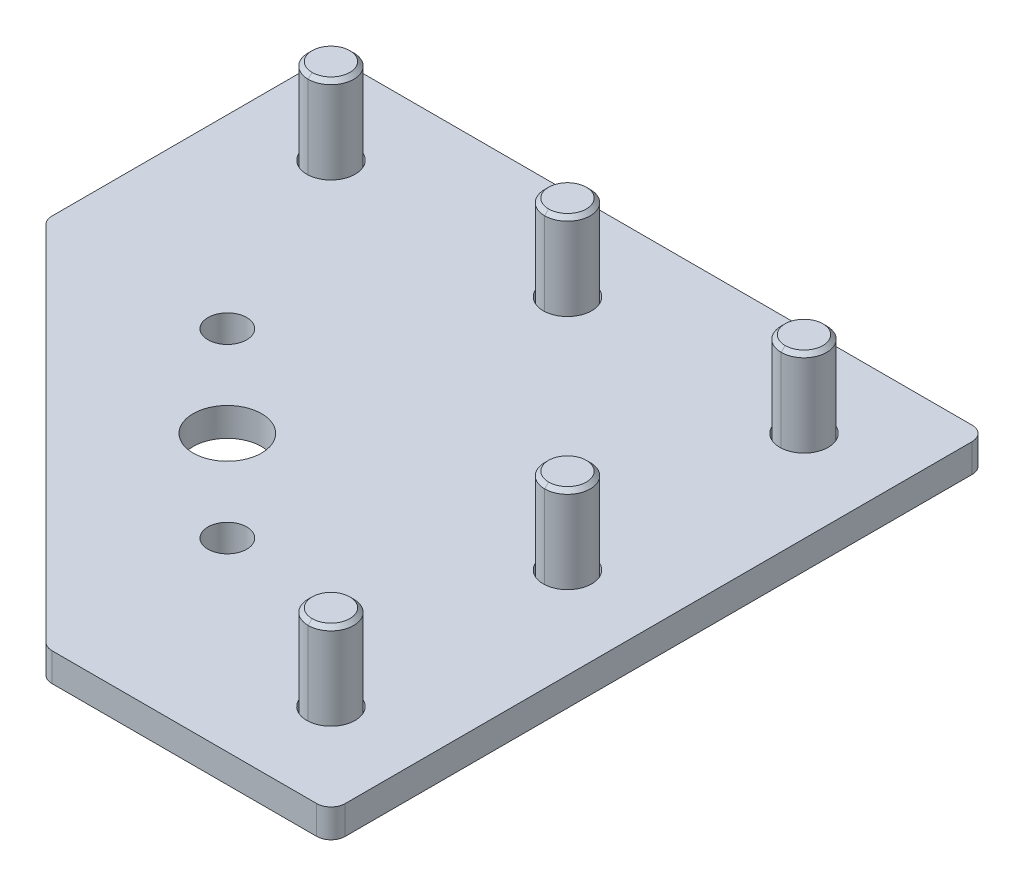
ISO-10303-21;
HEADER;
FILE_DESCRIPTION(('STEP AP214'),'2;1');
FILE_NAME('part.step','',(''),(''),'','','');
FILE_SCHEMA(('AUTOMOTIVE_DESIGN { 1 0 10303 214 1 1 1 1 }'));
ENDSEC;
DATA;
#1=APPLICATION_CONTEXT('core data for automotive mechanical design processes');
#2=APPLICATION_PROTOCOL_DEFINITION('international standard','automotive_design',2000,#1);
#3=PRODUCT_CONTEXT('',#1,'mechanical');
#4=PRODUCT('Part','Part','',(#3));
#5=PRODUCT_RELATED_PRODUCT_CATEGORY('part','',(#4));
#6=PRODUCT_DEFINITION_FORMATION('','',#4);
#7=PRODUCT_DEFINITION_CONTEXT('part definition',#1,'design');
#8=PRODUCT_DEFINITION('design','',#6,#7);
#9=PRODUCT_DEFINITION_SHAPE('','',#8);
#10=(LENGTH_UNIT() NAMED_UNIT(*) SI_UNIT(.MILLI.,.METRE.));
#11=(NAMED_UNIT(*) PLANE_ANGLE_UNIT() SI_UNIT($,.RADIAN.));
#12=(NAMED_UNIT(*) SI_UNIT($,.STERADIAN.) SOLID_ANGLE_UNIT());
#13=UNCERTAINTY_MEASURE_WITH_UNIT(LENGTH_MEASURE(1.E-05),#10,'distance_accuracy_value','');
#14=(GEOMETRIC_REPRESENTATION_CONTEXT(3) GLOBAL_UNCERTAINTY_ASSIGNED_CONTEXT((#13)) GLOBAL_UNIT_ASSIGNED_CONTEXT((#10,
#11,#12)) REPRESENTATION_CONTEXT('',''));
#15=CARTESIAN_POINT('',(0.,0.,0.));
#16=DIRECTION('',(0.,0.,1.));
#17=DIRECTION('',(1.,0.,0.));
#18=AXIS2_PLACEMENT_3D('',#15,#16,#17);
#19=CARTESIAN_POINT('',(610.428560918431,855.418833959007,1237.88513946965));
#20=DIRECTION('',(0.,-1.,0.));
#21=DIRECTION('',(0.,0.,1.));
#22=AXIS2_PLACEMENT_3D('',#19,#20,#21);
#23=CONICAL_SURFACE('',#22,2.5,1.0471975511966);
#24=DIRECTION('',(0.,-0.5,-0.866025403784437));
#25=VECTOR('',#24,1.);
#26=CARTESIAN_POINT('',(610.428560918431,855.418833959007,1235.38513946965));
#27=LINE('',#26,#25);
#28=CARTESIAN_POINT('',(610.428560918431,856.862209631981,1237.88513946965));
#29=VERTEX_POINT('',#28);
#30=CARTESIAN_POINT('',(610.428560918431,855.418833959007,1235.38513946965));
#31=VERTEX_POINT('',#30);
#32=EDGE_CURVE('P0_E172',#29,#31,#27,.T.);
#33=ORIENTED_EDGE('',*,*,#32,.F.);
#34=DIRECTION('',(0.,-0.5,0.866025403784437));
#35=VECTOR('',#34,1.);
#36=CARTESIAN_POINT('',(610.428560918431,855.418833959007,1240.38513946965));
#37=LINE('',#36,#35);
#38=CARTESIAN_POINT('',(610.428560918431,855.418833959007,1240.38513946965));
#39=VERTEX_POINT('',#38);
#40=EDGE_CURVE('P0_E174',#29,#39,#37,.T.);
#41=ORIENTED_EDGE('',*,*,#40,.T.);
#42=CARTESIAN_POINT('',(610.428560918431,855.418833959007,1237.88513946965));
#43=DIRECTION('',(0.,-1.,0.));
#44=DIRECTION('',(0.,0.,1.));
#45=AXIS2_PLACEMENT_3D('',#42,#43,#44);
#46=CIRCLE('',#45,2.5);
#47=CARTESIAN_POINT('',(608.26349740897,855.418833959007,1239.13513946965));
#48=VERTEX_POINT('',#47);
#49=EDGE_CURVE('P0_E10',#39,#48,#46,.T.);
#50=ORIENTED_EDGE('',*,*,#49,.T.);
#51=CARTESIAN_POINT('',(610.428560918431,855.418833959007,1237.88513946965));
#52=DIRECTION('',(0.,-1.,0.));
#53=DIRECTION('',(0.,0.,1.));
#54=AXIS2_PLACEMENT_3D('',#51,#52,#53);
#55=CIRCLE('',#54,2.5);
#56=CARTESIAN_POINT('',(608.26349740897,855.418833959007,1236.63513946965));
#57=VERTEX_POINT('',#56);
#58=EDGE_CURVE('P0_E24',#48,#57,#55,.T.);
#59=ORIENTED_EDGE('',*,*,#58,.T.);
#60=CARTESIAN_POINT('',(610.428560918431,855.418833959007,1237.88513946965));
#61=DIRECTION('',(0.,-1.,0.));
#62=DIRECTION('',(0.,0.,1.));
#63=AXIS2_PLACEMENT_3D('',#60,#61,#62);
#64=CIRCLE('',#63,2.5);
#65=EDGE_CURVE('P0_E175',#57,#31,#64,.T.);
#66=ORIENTED_EDGE('',*,*,#65,.T.);
#67=EDGE_LOOP('',(#33,#41,#50,#59,#66));
#68=FACE_BOUND('',#67,.T.);
#69=ADVANCED_FACE('P0_F16',(#68),#23,.F.);
#70=CARTESIAN_POINT('',(608.985185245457,855.418833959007,1240.38513946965));
#71=DIRECTION('',(0.,-1.,0.));
#72=DIRECTION('',(0.,0.,1.));
#73=AXIS2_PLACEMENT_3D('',#70,#71,#72);
#74=PLANE('',#73);
#75=ORIENTED_EDGE('',*,*,#49,.F.);
#76=DIRECTION('',(-1.,0.,0.));
#77=VECTOR('',#76,1.);
#78=CARTESIAN_POINT('',(611.871936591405,855.418833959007,1240.38513946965));
#79=LINE('',#78,#77);
#80=CARTESIAN_POINT('',(608.985185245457,855.418833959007,1240.38513946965));
#81=VERTEX_POINT('',#80);
#82=EDGE_CURVE('P0_E308',#39,#81,#79,.T.);
#83=ORIENTED_EDGE('',*,*,#82,.T.);
#84=DIRECTION('',(0.5,0.,0.86602540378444));
#85=VECTOR('',#84,1.);
#86=CARTESIAN_POINT('',(607.541809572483,855.418833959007,1237.88513946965));
#87=LINE('',#86,#85);
#88=EDGE_CURVE('P0_E338',#48,#81,#87,.T.);
#89=ORIENTED_EDGE('',*,*,#88,.F.);
#90=EDGE_LOOP('',(#75,#83,#89));
#91=FACE_BOUND('',#90,.T.);
#92=ADVANCED_FACE('P0_F928',(#91),#74,.T.);
#93=CARTESIAN_POINT('',(608.985185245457,855.418833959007,1240.38513946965));
#94=DIRECTION('',(0.,-1.,0.));
#95=DIRECTION('',(0.,0.,1.));
#96=AXIS2_PLACEMENT_3D('',#93,#94,#95);
#97=PLANE('',#96);
#98=ORIENTED_EDGE('',*,*,#58,.F.);
#99=DIRECTION('',(0.5,0.,0.86602540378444));
#100=VECTOR('',#99,1.);
#101=CARTESIAN_POINT('',(607.541809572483,855.418833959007,1237.88513946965));
#102=LINE('',#101,#100);
#103=CARTESIAN_POINT('',(607.541809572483,855.418833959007,1237.88513946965));
#104=VERTEX_POINT('',#103);
#105=EDGE_CURVE('P0_E334',#104,#48,#102,.T.);
#106=ORIENTED_EDGE('',*,*,#105,.F.);
#107=DIRECTION('',(0.5,0.,-0.866025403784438));
#108=VECTOR('',#107,1.);
#109=CARTESIAN_POINT('',(607.541809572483,855.418833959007,1237.88513946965));
#110=LINE('',#109,#108);
#111=EDGE_CURVE('P0_E369',#104,#57,#110,.T.);
#112=ORIENTED_EDGE('',*,*,#111,.T.);
#113=EDGE_LOOP('',(#98,#106,#112));
#114=FACE_BOUND('',#113,.T.);
#115=ADVANCED_FACE('P0_F918',(#114),#97,.T.);
#116=CARTESIAN_POINT('',(608.985185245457,855.418833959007,1240.38513946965));
#117=DIRECTION('',(0.,-1.,0.));
#118=DIRECTION('',(0.,0.,1.));
#119=AXIS2_PLACEMENT_3D('',#116,#117,#118);
#120=PLANE('',#119);
#121=ORIENTED_EDGE('',*,*,#65,.F.);
#122=DIRECTION('',(0.5,0.,-0.866025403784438));
#123=VECTOR('',#122,1.);
#124=CARTESIAN_POINT('',(607.541809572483,855.418833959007,1237.88513946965));
#125=LINE('',#124,#123);
#126=CARTESIAN_POINT('',(608.985185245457,855.418833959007,1235.38513946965));
#127=VERTEX_POINT('',#126);
#128=EDGE_CURVE('P0_E45',#57,#127,#125,.T.);
#129=ORIENTED_EDGE('',*,*,#128,.T.);
#130=DIRECTION('',(1.,0.,0.));
#131=VECTOR('',#130,1.);
#132=CARTESIAN_POINT('',(608.985185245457,855.418833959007,1235.38513946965));
#133=LINE('',#132,#131);
#134=EDGE_CURVE('P0_E273',#127,#31,#133,.T.);
#135=ORIENTED_EDGE('',*,*,#134,.T.);
#136=EDGE_LOOP('',(#121,#129,#135));
#137=FACE_BOUND('',#136,.T.);
#138=ADVANCED_FACE('P0_F907',(#137),#120,.T.);
#139=CARTESIAN_POINT('',(608.985185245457,855.418833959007,1240.38513946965));
#140=DIRECTION('',(0.,-1.,0.));
#141=DIRECTION('',(0.,0.,1.));
#142=AXIS2_PLACEMENT_3D('',#139,#140,#141);
#143=PLANE('',#142);
#144=CARTESIAN_POINT('',(610.428560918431,855.418833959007,1237.88513946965));
#145=DIRECTION('',(0.,-1.,0.));
#146=DIRECTION('',(0.,0.,1.));
#147=AXIS2_PLACEMENT_3D('',#144,#145,#146);
#148=CIRCLE('',#147,2.5);
#149=CARTESIAN_POINT('',(612.593624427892,855.418833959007,1236.63513946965));
#150=VERTEX_POINT('',#149);
#151=EDGE_CURVE('P0_E179',#31,#150,#148,.T.);
#152=ORIENTED_EDGE('',*,*,#151,.F.);
#153=DIRECTION('',(1.,0.,0.));
#154=VECTOR('',#153,1.);
#155=CARTESIAN_POINT('',(608.985185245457,855.418833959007,1235.38513946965));
#156=LINE('',#155,#154);
#157=CARTESIAN_POINT('',(611.871936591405,855.418833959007,1235.38513946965));
#158=VERTEX_POINT('',#157);
#159=EDGE_CURVE('P0_E270',#31,#158,#156,.T.);
#160=ORIENTED_EDGE('',*,*,#159,.T.);
#161=DIRECTION('',(-0.5,0.,-0.86602540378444));
#162=VECTOR('',#161,1.);
#163=CARTESIAN_POINT('',(613.315312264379,855.418833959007,1237.88513946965));
#164=LINE('',#163,#162);
#165=EDGE_CURVE('P0_E220',#150,#158,#164,.T.);
#166=ORIENTED_EDGE('',*,*,#165,.F.);
#167=EDGE_LOOP('',(#152,#160,#166));
#168=FACE_BOUND('',#167,.T.);
#169=ADVANCED_FACE('P0_F896',(#168),#143,.T.);
#170=CARTESIAN_POINT('',(608.985185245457,855.418833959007,1240.38513946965));
#171=DIRECTION('',(0.,-1.,0.));
#172=DIRECTION('',(0.,0.,1.));
#173=AXIS2_PLACEMENT_3D('',#170,#171,#172);
#174=PLANE('',#173);
#175=CARTESIAN_POINT('',(610.428560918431,855.418833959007,1237.88513946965));
#176=DIRECTION('',(0.,-1.,0.));
#177=DIRECTION('',(0.,0.,1.));
#178=AXIS2_PLACEMENT_3D('',#175,#176,#177);
#179=CIRCLE('',#178,2.5);
#180=CARTESIAN_POINT('',(612.593624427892,855.418833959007,1239.13513946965));
#181=VERTEX_POINT('',#180);
#182=EDGE_CURVE('P0_E194',#150,#181,#179,.T.);
#183=ORIENTED_EDGE('',*,*,#182,.F.);
#184=DIRECTION('',(-0.5,0.,-0.86602540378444));
#185=VECTOR('',#184,1.);
#186=CARTESIAN_POINT('',(613.315312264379,855.418833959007,1237.88513946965));
#187=LINE('',#186,#185);
#188=CARTESIAN_POINT('',(613.315312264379,855.418833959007,1237.88513946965));
#189=VERTEX_POINT('',#188);
#190=EDGE_CURVE('P0_E225',#189,#150,#187,.T.);
#191=ORIENTED_EDGE('',*,*,#190,.F.);
#192=DIRECTION('',(0.5,0.,-0.866025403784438));
#193=VECTOR('',#192,1.);
#194=CARTESIAN_POINT('',(611.871936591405,855.418833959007,1240.38513946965));
#195=LINE('',#194,#193);
#196=EDGE_CURVE('P0_E354',#181,#189,#195,.T.);
#197=ORIENTED_EDGE('',*,*,#196,.F.);
#198=EDGE_LOOP('',(#183,#191,#197));
#199=FACE_BOUND('',#198,.T.);
#200=ADVANCED_FACE('P0_F681',(#199),#174,.T.);
#201=CARTESIAN_POINT('',(608.985185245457,855.418833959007,1240.38513946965));
#202=DIRECTION('',(0.,-1.,0.));
#203=DIRECTION('',(0.,0.,1.));
#204=AXIS2_PLACEMENT_3D('',#201,#202,#203);
#205=PLANE('',#204);
#206=CARTESIAN_POINT('',(610.428560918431,855.418833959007,1237.88513946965));
#207=DIRECTION('',(0.,-1.,0.));
#208=DIRECTION('',(0.,0.,1.));
#209=AXIS2_PLACEMENT_3D('',#206,#207,#208);
#210=CIRCLE('',#209,2.5);
#211=EDGE_CURVE('P0_E185',#181,#39,#210,.T.);
#212=ORIENTED_EDGE('',*,*,#211,.F.);
#213=DIRECTION('',(0.5,0.,-0.866025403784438));
#214=VECTOR('',#213,1.);
#215=CARTESIAN_POINT('',(611.871936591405,855.418833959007,1240.38513946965));
#216=LINE('',#215,#214);
#217=CARTESIAN_POINT('',(611.871936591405,855.418833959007,1240.38513946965));
#218=VERTEX_POINT('',#217);
#219=EDGE_CURVE('P0_E350',#218,#181,#216,.T.);
#220=ORIENTED_EDGE('',*,*,#219,.F.);
#221=DIRECTION('',(-1.,0.,0.));
#222=VECTOR('',#221,1.);
#223=CARTESIAN_POINT('',(611.871936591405,855.418833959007,1240.38513946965));
#224=LINE('',#223,#222);
#225=EDGE_CURVE('P0_E311',#218,#39,#224,.T.);
#226=ORIENTED_EDGE('',*,*,#225,.T.);
#227=EDGE_LOOP('',(#212,#220,#226));
#228=FACE_BOUND('',#227,.T.);
#229=ADVANCED_FACE('P0_F676',(#228),#205,.T.);
#230=CARTESIAN_POINT('',(607.541809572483,855.418833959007,1237.88513946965));
#231=DIRECTION('',(-0.866025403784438,0.,-0.5));
#232=DIRECTION('',(0.,-1.,0.));
#233=AXIS2_PLACEMENT_3D('',#230,#231,#232);
#234=PLANE('',#233);
#235=DIRECTION('',(0.5,0.,-0.866025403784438));
#236=VECTOR('',#235,1.);
#237=CARTESIAN_POINT('',(607.541809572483,851.618833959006,1237.88513946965));
#238=LINE('',#237,#236);
#239=CARTESIAN_POINT('',(607.541809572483,851.618833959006,1237.88513946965));
#240=VERTEX_POINT('',#239);
#241=CARTESIAN_POINT('',(608.985185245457,851.618833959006,1235.38513946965));
#242=VERTEX_POINT('',#241);
#243=EDGE_CURVE('P0_E210',#240,#242,#238,.T.);
#244=ORIENTED_EDGE('',*,*,#243,.T.);
#245=DIRECTION('',(0.,-1.,0.));
#246=VECTOR('',#245,1.);
#247=CARTESIAN_POINT('',(608.985185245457,855.418833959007,1235.38513946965));
#248=LINE('',#247,#246);
#249=EDGE_CURVE('P0_E364',#127,#242,#248,.T.);
#250=ORIENTED_EDGE('',*,*,#249,.F.);
#251=ORIENTED_EDGE('',*,*,#128,.F.);
#252=ORIENTED_EDGE('',*,*,#111,.F.);
#253=DIRECTION('',(0.,-1.,0.));
#254=VECTOR('',#253,1.);
#255=CARTESIAN_POINT('',(607.541809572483,855.418833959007,1237.88513946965));
#256=LINE('',#255,#254);
#257=EDGE_CURVE('P0_E331',#104,#240,#256,.T.);
#258=ORIENTED_EDGE('',*,*,#257,.T.);
#259=EDGE_LOOP('',(#244,#250,#251,#252,#258));
#260=FACE_BOUND('',#259,.T.);
#261=ADVANCED_FACE('P0_F680',(#260),#234,.F.);
#262=CARTESIAN_POINT('',(608.985185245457,855.418833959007,1235.38513946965));
#263=DIRECTION('',(0.,0.,-1.));
#264=DIRECTION('',(1.,0.,0.));
#265=AXIS2_PLACEMENT_3D('',#262,#263,#264);
#266=PLANE('',#265);
#267=DIRECTION('',(1.,0.,0.));
#268=VECTOR('',#267,1.);
#269=CARTESIAN_POINT('',(608.985185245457,851.618833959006,1235.38513946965));
#270=LINE('',#269,#268);
#271=CARTESIAN_POINT('',(611.871936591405,851.618833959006,1235.38513946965));
#272=VERTEX_POINT('',#271);
#273=EDGE_CURVE('P0_E206',#242,#272,#270,.T.);
#274=ORIENTED_EDGE('',*,*,#273,.T.);
#275=DIRECTION('',(0.,-1.,0.));
#276=VECTOR('',#275,1.);
#277=CARTESIAN_POINT('',(611.871936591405,855.418833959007,1235.38513946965));
#278=LINE('',#277,#276);
#279=EDGE_CURVE('P0_E224',#158,#272,#278,.T.);
#280=ORIENTED_EDGE('',*,*,#279,.F.);
#281=ORIENTED_EDGE('',*,*,#159,.F.);
#282=ORIENTED_EDGE('',*,*,#134,.F.);
#283=ORIENTED_EDGE('',*,*,#249,.T.);
#284=EDGE_LOOP('',(#274,#280,#281,#282,#283));
#285=FACE_BOUND('',#284,.T.);
#286=ADVANCED_FACE('P0_F749',(#285),#266,.F.);
#287=CARTESIAN_POINT('',(613.315312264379,855.418833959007,1237.88513946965));
#288=DIRECTION('',(-0.86602540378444,0.,0.5));
#289=DIRECTION('',(0.,1.,0.));
#290=AXIS2_PLACEMENT_3D('',#287,#288,#289);
#291=PLANE('',#290);
#292=DIRECTION('',(-0.5,0.,-0.86602540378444));
#293=VECTOR('',#292,1.);
#294=CARTESIAN_POINT('',(613.315312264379,851.618833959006,1237.88513946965));
#295=LINE('',#294,#293);
#296=CARTESIAN_POINT('',(613.315312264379,851.618833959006,1237.88513946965));
#297=VERTEX_POINT('',#296);
#298=EDGE_CURVE('P0_E211',#297,#272,#295,.T.);
#299=ORIENTED_EDGE('',*,*,#298,.F.);
#300=DIRECTION('',(0.,-1.,0.));
#301=VECTOR('',#300,1.);
#302=CARTESIAN_POINT('',(613.315312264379,855.418833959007,1237.88513946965));
#303=LINE('',#302,#301);
#304=EDGE_CURVE('P0_E295',#189,#297,#303,.T.);
#305=ORIENTED_EDGE('',*,*,#304,.F.);
#306=ORIENTED_EDGE('',*,*,#190,.T.);
#307=ORIENTED_EDGE('',*,*,#165,.T.);
#308=ORIENTED_EDGE('',*,*,#279,.T.);
#309=EDGE_LOOP('',(#299,#305,#306,#307,#308));
#310=FACE_BOUND('',#309,.T.);
#311=ADVANCED_FACE('P0_F745',(#310),#291,.T.);
#312=CARTESIAN_POINT('',(611.871936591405,855.418833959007,1240.38513946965));
#313=DIRECTION('',(-0.866025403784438,0.,-0.5));
#314=DIRECTION('',(0.,-1.,0.));
#315=AXIS2_PLACEMENT_3D('',#312,#313,#314);
#316=PLANE('',#315);
#317=DIRECTION('',(0.5,0.,-0.866025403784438));
#318=VECTOR('',#317,1.);
#319=CARTESIAN_POINT('',(611.871936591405,851.618833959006,1240.38513946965));
#320=LINE('',#319,#318);
#321=CARTESIAN_POINT('',(611.871936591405,851.618833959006,1240.38513946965));
#322=VERTEX_POINT('',#321);
#323=EDGE_CURVE('P0_E246',#322,#297,#320,.T.);
#324=ORIENTED_EDGE('',*,*,#323,.F.);
#325=DIRECTION('',(0.,-1.,0.));
#326=VECTOR('',#325,1.);
#327=CARTESIAN_POINT('',(611.871936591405,855.418833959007,1240.38513946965));
#328=LINE('',#327,#326);
#329=EDGE_CURVE('P0_E347',#218,#322,#328,.T.);
#330=ORIENTED_EDGE('',*,*,#329,.F.);
#331=ORIENTED_EDGE('',*,*,#219,.T.);
#332=ORIENTED_EDGE('',*,*,#196,.T.);
#333=ORIENTED_EDGE('',*,*,#304,.T.);
#334=EDGE_LOOP('',(#324,#330,#331,#332,#333));
#335=FACE_BOUND('',#334,.T.);
#336=ADVANCED_FACE('P0_F737',(#335),#316,.T.);
#337=CARTESIAN_POINT('',(611.871936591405,855.418833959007,1240.38513946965));
#338=DIRECTION('',(0.,0.,1.));
#339=DIRECTION('',(1.,0.,0.));
#340=AXIS2_PLACEMENT_3D('',#337,#338,#339);
#341=PLANE('',#340);
#342=DIRECTION('',(-1.,0.,0.));
#343=VECTOR('',#342,1.);
#344=CARTESIAN_POINT('',(611.871936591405,851.618833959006,1240.38513946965));
#345=LINE('',#344,#343);
#346=CARTESIAN_POINT('',(608.985185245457,851.618833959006,1240.38513946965));
#347=VERTEX_POINT('',#346);
#348=EDGE_CURVE('P0_E250',#322,#347,#345,.T.);
#349=ORIENTED_EDGE('',*,*,#348,.T.);
#350=DIRECTION('',(0.,-1.,0.));
#351=VECTOR('',#350,1.);
#352=CARTESIAN_POINT('',(608.985185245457,855.418833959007,1240.38513946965));
#353=LINE('',#352,#351);
#354=EDGE_CURVE('P0_E312',#81,#347,#353,.T.);
#355=ORIENTED_EDGE('',*,*,#354,.F.);
#356=ORIENTED_EDGE('',*,*,#82,.F.);
#357=ORIENTED_EDGE('',*,*,#225,.F.);
#358=ORIENTED_EDGE('',*,*,#329,.T.);
#359=EDGE_LOOP('',(#349,#355,#356,#357,#358));
#360=FACE_BOUND('',#359,.T.);
#361=ADVANCED_FACE('P0_F732',(#360),#341,.F.);
#362=CARTESIAN_POINT('',(607.541809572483,855.418833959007,1237.88513946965));
#363=DIRECTION('',(0.86602540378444,0.,-0.5));
#364=DIRECTION('',(-0.5,0.,-0.86602540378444));
#365=AXIS2_PLACEMENT_3D('',#362,#363,#364);
#366=PLANE('',#365);
#367=DIRECTION('',(0.5,0.,0.86602540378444));
#368=VECTOR('',#367,1.);
#369=CARTESIAN_POINT('',(607.541809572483,851.618833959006,1237.88513946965));
#370=LINE('',#369,#368);
#371=EDGE_CURVE('P0_E258',#240,#347,#370,.T.);
#372=ORIENTED_EDGE('',*,*,#371,.F.);
#373=ORIENTED_EDGE('',*,*,#257,.F.);
#374=ORIENTED_EDGE('',*,*,#105,.T.);
#375=ORIENTED_EDGE('',*,*,#88,.T.);
#376=ORIENTED_EDGE('',*,*,#354,.T.);
#377=EDGE_LOOP('',(#372,#373,#374,#375,#376));
#378=FACE_BOUND('',#377,.T.);
#379=ADVANCED_FACE('P0_F736',(#378),#366,.T.);
#380=CARTESIAN_POINT('',(610.428560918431,852.418833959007,1237.88513946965));
#381=DIRECTION('',(0.,-1.,0.));
#382=DIRECTION('',(0.,0.,1.));
#383=AXIS2_PLACEMENT_3D('',#380,#381,#382);
#384=TOROIDAL_SURFACE('',#383,5.7,0.8);
#385=CARTESIAN_POINT('',(610.428560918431,852.418833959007,1232.18513946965));
#386=DIRECTION('',(-1.,0.,0.));
#387=DIRECTION('',(0.,0.,1.));
#388=AXIS2_PLACEMENT_3D('',#385,#386,#387);
#389=CIRCLE('',#388,0.8);
#390=CARTESIAN_POINT('',(610.428560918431,852.418833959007,1231.38513946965));
#391=VERTEX_POINT('',#390);
#392=CARTESIAN_POINT('',(610.428560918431,851.618833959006,1232.18513946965));
#393=VERTEX_POINT('',#392);
#394=EDGE_CURVE('P0_E215',#391,#393,#389,.T.);
#395=ORIENTED_EDGE('',*,*,#394,.F.);
#396=CARTESIAN_POINT('',(610.428560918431,852.418833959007,1237.88513946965));
#397=DIRECTION('',(0.,1.,0.));
#398=DIRECTION('',(0.,0.,1.));
#399=AXIS2_PLACEMENT_3D('',#396,#397,#398);
#400=CIRCLE('',#399,6.5);
#401=CARTESIAN_POINT('',(610.428560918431,852.418833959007,1244.38513946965));
#402=VERTEX_POINT('',#401);
#403=EDGE_CURVE('P0_E319',#402,#391,#400,.T.);
#404=ORIENTED_EDGE('',*,*,#403,.F.);
#405=CARTESIAN_POINT('',(610.428560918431,852.418833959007,1243.58513946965));
#406=DIRECTION('',(1.,0.,0.));
#407=DIRECTION('',(0.,0.,-1.));
#408=AXIS2_PLACEMENT_3D('',#405,#406,#407);
#409=CIRCLE('',#408,0.8);
#410=CARTESIAN_POINT('',(610.428560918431,851.618833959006,1243.58513946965));
#411=VERTEX_POINT('',#410);
#412=EDGE_CURVE('P0_E235',#402,#411,#409,.T.);
#413=ORIENTED_EDGE('',*,*,#412,.T.);
#414=CARTESIAN_POINT('',(610.428560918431,851.618833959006,1237.88513946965));
#415=DIRECTION('',(0.,-1.,0.));
#416=DIRECTION('',(0.,0.,1.));
#417=AXIS2_PLACEMENT_3D('',#414,#415,#416);
#418=CIRCLE('',#417,5.7);
#419=EDGE_CURVE('P0_E255',#393,#411,#418,.T.);
#420=ORIENTED_EDGE('',*,*,#419,.F.);
#421=EDGE_LOOP('',(#395,#404,#413,#420));
#422=FACE_BOUND('',#421,.T.);
#423=ADVANCED_FACE('P0_F668',(#422),#384,.T.);
#424=CARTESIAN_POINT('',(610.428560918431,857.018833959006,1237.88513946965));
#425=DIRECTION('',(0.,1.,0.));
#426=DIRECTION('',(0.,0.,-1.));
#427=AXIS2_PLACEMENT_3D('',#424,#425,#426);
#428=TOROIDAL_SURFACE('',#427,4.39999999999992,0.4);
#429=CARTESIAN_POINT('',(610.428560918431,857.018833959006,1242.28513946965));
#430=DIRECTION('',(-1.,0.,0.));
#431=DIRECTION('',(0.,0.,1.));
#432=AXIS2_PLACEMENT_3D('',#429,#430,#431);
#433=CIRCLE('',#432,0.4);
#434=CARTESIAN_POINT('',(610.428560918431,857.018833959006,1241.88513946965));
#435=VERTEX_POINT('',#434);
#436=CARTESIAN_POINT('',(610.428560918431,856.618833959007,1242.28513946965));
#437=VERTEX_POINT('',#436);
#438=EDGE_CURVE('P0_E234',#435,#437,#433,.T.);
#439=ORIENTED_EDGE('',*,*,#438,.F.);
#440=CARTESIAN_POINT('',(610.428560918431,857.018833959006,1237.88513946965));
#441=DIRECTION('',(0.,1.,0.));
#442=DIRECTION('',(0.,0.,-1.));
#443=AXIS2_PLACEMENT_3D('',#440,#441,#442);
#444=CIRCLE('',#443,3.99999999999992);
#445=CARTESIAN_POINT('',(610.428560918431,857.018833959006,1233.88513946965));
#446=VERTEX_POINT('',#445);
#447=EDGE_CURVE('P0_E277',#446,#435,#444,.T.);
#448=ORIENTED_EDGE('',*,*,#447,.F.);
#449=CARTESIAN_POINT('',(610.428560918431,857.018833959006,1233.48513946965));
#450=DIRECTION('',(1.,0.,0.));
#451=DIRECTION('',(0.,0.,-1.));
#452=AXIS2_PLACEMENT_3D('',#449,#450,#451);
#453=CIRCLE('',#452,0.4);
#454=CARTESIAN_POINT('',(610.428560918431,856.618833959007,1233.48513946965));
#455=VERTEX_POINT('',#454);
#456=EDGE_CURVE('P0_E254',#446,#455,#453,.T.);
#457=ORIENTED_EDGE('',*,*,#456,.T.);
#458=CARTESIAN_POINT('',(610.428560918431,856.618833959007,1237.88513946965));
#459=DIRECTION('',(0.,-1.,0.));
#460=DIRECTION('',(0.,0.,-1.));
#461=AXIS2_PLACEMENT_3D('',#458,#459,#460);
#462=CIRCLE('',#461,4.39999999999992);
#463=EDGE_CURVE('P0_E322',#437,#455,#462,.T.);
#464=ORIENTED_EDGE('',*,*,#463,.F.);
#465=EDGE_LOOP('',(#439,#448,#457,#464));
#466=FACE_BOUND('',#465,.T.);
#467=ADVANCED_FACE('P0_F662',(#466),#428,.F.);
#468=CARTESIAN_POINT('',(607.119060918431,876.618833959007,1237.88513946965));
#469=DIRECTION('',(0.,1.,0.));
#470=DIRECTION('',(-1.,0.,0.));
#471=AXIS2_PLACEMENT_3D('',#468,#469,#470);
#472=PLANE('',#471);
#473=CARTESIAN_POINT('',(610.428560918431,876.618833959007,1237.88513946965));
#474=DIRECTION('',(0.,-1.,0.));
#475=DIRECTION('',(0.,0.,1.));
#476=AXIS2_PLACEMENT_3D('',#473,#474,#475);
#477=CIRCLE('',#476,3.3095);
#478=CARTESIAN_POINT('',(610.428560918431,876.618833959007,1241.19463946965));
#479=VERTEX_POINT('',#478);
#480=CARTESIAN_POINT('',(610.428560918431,876.618833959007,1234.57563946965));
#481=VERTEX_POINT('',#480);
#482=EDGE_CURVE('P0_E200',#479,#481,#477,.T.);
#483=ORIENTED_EDGE('',*,*,#482,.F.);
#484=CARTESIAN_POINT('',(610.428560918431,876.618833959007,1237.88513946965));
#485=DIRECTION('',(0.,-1.,0.));
#486=DIRECTION('',(0.,0.,1.));
#487=AXIS2_PLACEMENT_3D('',#484,#485,#486);
#488=CIRCLE('',#487,3.3095);
#489=EDGE_CURVE('P0_E328',#481,#479,#488,.T.);
#490=ORIENTED_EDGE('',*,*,#489,.F.);
#491=EDGE_LOOP('',(#483,#490));
#492=FACE_BOUND('',#491,.T.);
#493=ADVANCED_FACE('P0_F667',(#492),#472,.T.);
#494=CARTESIAN_POINT('',(610.428560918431,876.618833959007,1237.88513946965));
#495=DIRECTION('',(0.,-1.,0.));
#496=DIRECTION('',(0.,0.,1.));
#497=AXIS2_PLACEMENT_3D('',#494,#495,#496);
#498=CONICAL_SURFACE('',#497,3.3095,0.7853981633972);
#499=DIRECTION('',(0.,-0.707106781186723,-0.707106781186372));
#500=VECTOR('',#499,1.);
#501=CARTESIAN_POINT('',(610.428560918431,876.618833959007,1234.57563946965));
#502=LINE('',#501,#500);
#503=CARTESIAN_POINT('',(610.428560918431,875.928333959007,1233.88513946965));
#504=VERTEX_POINT('',#503);
#505=EDGE_CURVE('P0_E195',#481,#504,#502,.T.);
#506=ORIENTED_EDGE('',*,*,#505,.F.);
#507=ORIENTED_EDGE('',*,*,#489,.T.);
#508=DIRECTION('',(0.,-0.707106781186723,0.707106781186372));
#509=VECTOR('',#508,1.);
#510=CARTESIAN_POINT('',(610.428560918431,876.618833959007,1241.19463946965));
#511=LINE('',#510,#509);
#512=CARTESIAN_POINT('',(610.428560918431,875.928333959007,1241.88513946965));
#513=VERTEX_POINT('',#512);
#514=EDGE_CURVE('P0_E219',#479,#513,#511,.T.);
#515=ORIENTED_EDGE('',*,*,#514,.T.);
#516=CARTESIAN_POINT('',(610.428560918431,875.928333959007,1237.88513946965));
#517=DIRECTION('',(0.,-1.,0.));
#518=DIRECTION('',(0.,0.,1.));
#519=AXIS2_PLACEMENT_3D('',#516,#517,#518);
#520=CIRCLE('',#519,3.99999999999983);
#521=EDGE_CURVE('P0_E325',#504,#513,#520,.T.);
#522=ORIENTED_EDGE('',*,*,#521,.F.);
#523=EDGE_LOOP('',(#506,#507,#515,#522));
#524=FACE_BOUND('',#523,.T.);
#525=ADVANCED_FACE('P0_F811',(#524),#498,.T.);
#526=CARTESIAN_POINT('',(610.428560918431,819.868833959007,1237.88513946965));
#527=DIRECTION('',(0.,-1.,0.));
#528=DIRECTION('',(0.,0.,1.));
#529=AXIS2_PLACEMENT_3D('',#526,#527,#528);
#530=CYLINDRICAL_SURFACE('',#529,3.99999999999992);
#531=DIRECTION('',(0.,-1.,0.));
#532=VECTOR('',#531,1.);
#533=CARTESIAN_POINT('',(610.428560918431,819.868833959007,1233.88513946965));
#534=LINE('',#533,#532);
#535=EDGE_CURVE('P0_E269',#504,#446,#534,.T.);
#536=ORIENTED_EDGE('',*,*,#535,.F.);
#537=ORIENTED_EDGE('',*,*,#521,.T.);
#538=DIRECTION('',(0.,-1.,0.));
#539=VECTOR('',#538,1.);
#540=CARTESIAN_POINT('',(610.428560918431,819.868833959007,1241.88513946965));
#541=LINE('',#540,#539);
#542=EDGE_CURVE('P0_E281',#513,#435,#541,.T.);
#543=ORIENTED_EDGE('',*,*,#542,.T.);
#544=CARTESIAN_POINT('',(610.428560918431,857.018833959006,1237.88513946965));
#545=DIRECTION('',(0.,1.,0.));
#546=DIRECTION('',(0.,0.,-1.));
#547=AXIS2_PLACEMENT_3D('',#544,#545,#546);
#548=CIRCLE('',#547,3.99999999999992);
#549=EDGE_CURVE('P0_E230',#435,#446,#548,.T.);
#550=ORIENTED_EDGE('',*,*,#549,.T.);
#551=EDGE_LOOP('',(#536,#537,#543,#550));
#552=FACE_BOUND('',#551,.T.);
#553=ADVANCED_FACE('P0_F815',(#552),#530,.T.);
#554=CARTESIAN_POINT('',(603.928560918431,856.618833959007,1237.88513946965));
#555=DIRECTION('',(0.,1.,0.));
#556=DIRECTION('',(-1.,0.,0.));
#557=AXIS2_PLACEMENT_3D('',#554,#555,#556);
#558=PLANE('',#557);
#559=CARTESIAN_POINT('',(610.428560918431,856.618833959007,1237.88513946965));
#560=DIRECTION('',(0.,-1.,0.));
#561=DIRECTION('',(0.,0.,-1.));
#562=AXIS2_PLACEMENT_3D('',#559,#560,#561);
#563=CIRCLE('',#562,4.39999999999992);
#564=EDGE_CURVE('P0_E245',#455,#437,#563,.T.);
#565=ORIENTED_EDGE('',*,*,#564,.T.);
#566=ORIENTED_EDGE('',*,*,#463,.T.);
#567=EDGE_LOOP('',(#565,#566));
#568=FACE_BOUND('',#567,.T.);
#569=CARTESIAN_POINT('',(610.428560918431,856.618833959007,1237.88513946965));
#570=DIRECTION('',(0.,-1.,0.));
#571=DIRECTION('',(0.,0.,1.));
#572=AXIS2_PLACEMENT_3D('',#569,#570,#571);
#573=CIRCLE('',#572,6.5);
#574=CARTESIAN_POINT('',(610.428560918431,856.618833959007,1244.38513946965));
#575=VERTEX_POINT('',#574);
#576=CARTESIAN_POINT('',(610.428560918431,856.618833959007,1231.38513946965));
#577=VERTEX_POINT('',#576);
#578=EDGE_CURVE('P0_E284',#575,#577,#573,.T.);
#579=ORIENTED_EDGE('',*,*,#578,.F.);
#580=CARTESIAN_POINT('',(610.428560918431,856.618833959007,1237.88513946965));
#581=DIRECTION('',(0.,-1.,0.));
#582=DIRECTION('',(0.,0.,1.));
#583=AXIS2_PLACEMENT_3D('',#580,#581,#582);
#584=CIRCLE('',#583,6.5);
#585=EDGE_CURVE('P0_E316',#577,#575,#584,.T.);
#586=ORIENTED_EDGE('',*,*,#585,.F.);
#587=EDGE_LOOP('',(#579,#586));
#588=FACE_BOUND('',#587,.T.);
#589=ADVANCED_FACE('P0_F803',(#568,#588),#558,.T.);
#590=CARTESIAN_POINT('',(610.428560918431,819.868833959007,1237.88513946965));
#591=DIRECTION('',(0.,-1.,0.));
#592=DIRECTION('',(0.,0.,1.));
#593=AXIS2_PLACEMENT_3D('',#590,#591,#592);
#594=CYLINDRICAL_SURFACE('',#593,6.5);
#595=DIRECTION('',(0.,-1.,0.));
#596=VECTOR('',#595,1.);
#597=CARTESIAN_POINT('',(610.428560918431,819.868833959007,1231.38513946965));
#598=LINE('',#597,#596);
#599=EDGE_CURVE('P0_E288',#577,#391,#598,.T.);
#600=ORIENTED_EDGE('',*,*,#599,.F.);
#601=ORIENTED_EDGE('',*,*,#585,.T.);
#602=DIRECTION('',(0.,-1.,0.));
#603=VECTOR('',#602,1.);
#604=CARTESIAN_POINT('',(610.428560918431,819.868833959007,1244.38513946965));
#605=LINE('',#604,#603);
#606=EDGE_CURVE('P0_E259',#575,#402,#605,.T.);
#607=ORIENTED_EDGE('',*,*,#606,.T.);
#608=ORIENTED_EDGE('',*,*,#403,.T.);
#609=EDGE_LOOP('',(#600,#601,#607,#608));
#610=FACE_BOUND('',#609,.T.);
#611=ADVANCED_FACE('P0_F772',(#610),#594,.T.);
#612=CARTESIAN_POINT('',(610.428560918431,851.618833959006,1237.88513946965));
#613=DIRECTION('',(0.,-1.,0.));
#614=DIRECTION('',(0.,0.,1.));
#615=AXIS2_PLACEMENT_3D('',#612,#613,#614);
#616=PLANE('',#615);
#617=ORIENTED_EDGE('',*,*,#371,.T.);
#618=ORIENTED_EDGE('',*,*,#348,.F.);
#619=ORIENTED_EDGE('',*,*,#323,.T.);
#620=ORIENTED_EDGE('',*,*,#298,.T.);
#621=ORIENTED_EDGE('',*,*,#273,.F.);
#622=ORIENTED_EDGE('',*,*,#243,.F.);
#623=EDGE_LOOP('',(#617,#618,#619,#620,#621,#622));
#624=FACE_BOUND('',#623,.T.);
#625=CARTESIAN_POINT('',(610.428560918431,851.618833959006,1237.88513946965));
#626=DIRECTION('',(0.,-1.,0.));
#627=DIRECTION('',(0.,0.,1.));
#628=AXIS2_PLACEMENT_3D('',#625,#626,#627);
#629=CIRCLE('',#628,5.7);
#630=EDGE_CURVE('P0_E229',#411,#393,#629,.T.);
#631=ORIENTED_EDGE('',*,*,#630,.T.);
#632=ORIENTED_EDGE('',*,*,#419,.T.);
#633=EDGE_LOOP('',(#631,#632));
#634=FACE_BOUND('',#633,.T.);
#635=ADVANCED_FACE('P0_F767',(#624,#634),#616,.T.);
#636=CARTESIAN_POINT('',(610.428560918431,819.868833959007,1237.88513946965));
#637=DIRECTION('',(0.,-1.,0.));
#638=DIRECTION('',(0.,0.,1.));
#639=AXIS2_PLACEMENT_3D('',#636,#637,#638);
#640=CYLINDRICAL_SURFACE('',#639,6.5);
#641=ORIENTED_EDGE('',*,*,#578,.T.);
#642=ORIENTED_EDGE('',*,*,#599,.T.);
#643=CARTESIAN_POINT('',(610.428560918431,852.418833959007,1237.88513946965));
#644=DIRECTION('',(0.,1.,0.));
#645=DIRECTION('',(0.,0.,1.));
#646=AXIS2_PLACEMENT_3D('',#643,#644,#645);
#647=CIRCLE('',#646,6.5);
#648=EDGE_CURVE('P0_E203',#391,#402,#647,.T.);
#649=ORIENTED_EDGE('',*,*,#648,.T.);
#650=ORIENTED_EDGE('',*,*,#606,.F.);
#651=EDGE_LOOP('',(#641,#642,#649,#650));
#652=FACE_BOUND('',#651,.T.);
#653=ADVANCED_FACE('P0_F771',(#652),#640,.T.);
#654=CARTESIAN_POINT('',(610.428560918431,819.868833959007,1237.88513946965));
#655=DIRECTION('',(0.,-1.,0.));
#656=DIRECTION('',(0.,0.,1.));
#657=AXIS2_PLACEMENT_3D('',#654,#655,#656);
#658=CYLINDRICAL_SURFACE('',#657,3.99999999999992);
#659=CARTESIAN_POINT('',(610.428560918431,875.928333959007,1237.88513946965));
#660=DIRECTION('',(0.,-1.,0.));
#661=DIRECTION('',(0.,0.,1.));
#662=AXIS2_PLACEMENT_3D('',#659,#660,#661);
#663=CIRCLE('',#662,3.99999999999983);
#664=EDGE_CURVE('P0_E199',#513,#504,#663,.T.);
#665=ORIENTED_EDGE('',*,*,#664,.T.);
#666=ORIENTED_EDGE('',*,*,#535,.T.);
#667=ORIENTED_EDGE('',*,*,#447,.T.);
#668=ORIENTED_EDGE('',*,*,#542,.F.);
#669=EDGE_LOOP('',(#665,#666,#667,#668));
#670=FACE_BOUND('',#669,.T.);
#671=ADVANCED_FACE('P0_F704',(#670),#658,.T.);
#672=CARTESIAN_POINT('',(610.428560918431,876.618833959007,1237.88513946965));
#673=DIRECTION('',(0.,-1.,0.));
#674=DIRECTION('',(0.,0.,1.));
#675=AXIS2_PLACEMENT_3D('',#672,#673,#674);
#676=CONICAL_SURFACE('',#675,3.3095,0.7853981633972);
#677=ORIENTED_EDGE('',*,*,#482,.T.);
#678=ORIENTED_EDGE('',*,*,#505,.T.);
#679=ORIENTED_EDGE('',*,*,#664,.F.);
#680=ORIENTED_EDGE('',*,*,#514,.F.);
#681=EDGE_LOOP('',(#677,#678,#679,#680));
#682=FACE_BOUND('',#681,.T.);
#683=ADVANCED_FACE('P0_F699',(#682),#676,.T.);
#684=CARTESIAN_POINT('',(610.428560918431,857.018833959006,1237.88513946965));
#685=DIRECTION('',(0.,1.,0.));
#686=DIRECTION('',(0.,0.,-1.));
#687=AXIS2_PLACEMENT_3D('',#684,#685,#686);
#688=TOROIDAL_SURFACE('',#687,4.39999999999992,0.4);
#689=ORIENTED_EDGE('',*,*,#549,.F.);
#690=ORIENTED_EDGE('',*,*,#438,.T.);
#691=ORIENTED_EDGE('',*,*,#564,.F.);
#692=ORIENTED_EDGE('',*,*,#456,.F.);
#693=EDGE_LOOP('',(#689,#690,#691,#692));
#694=FACE_BOUND('',#693,.T.);
#695=ADVANCED_FACE('P0_F703',(#694),#688,.F.);
#696=CARTESIAN_POINT('',(610.428560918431,852.418833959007,1237.88513946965));
#697=DIRECTION('',(0.,-1.,0.));
#698=DIRECTION('',(0.,0.,1.));
#699=AXIS2_PLACEMENT_3D('',#696,#697,#698);
#700=TOROIDAL_SURFACE('',#699,5.7,0.8);
#701=ORIENTED_EDGE('',*,*,#648,.F.);
#702=ORIENTED_EDGE('',*,*,#394,.T.);
#703=ORIENTED_EDGE('',*,*,#630,.F.);
#704=ORIENTED_EDGE('',*,*,#412,.F.);
#705=EDGE_LOOP('',(#701,#702,#703,#704));
#706=FACE_BOUND('',#705,.T.);
#707=ADVANCED_FACE('P0_F692',(#706),#700,.T.);
#708=CARTESIAN_POINT('',(610.428560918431,855.418833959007,1237.88513946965));
#709=DIRECTION('',(0.,-1.,0.));
#710=DIRECTION('',(0.,0.,1.));
#711=AXIS2_PLACEMENT_3D('',#708,#709,#710);
#712=CONICAL_SURFACE('',#711,2.5,1.0471975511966);
#713=ORIENTED_EDGE('',*,*,#40,.F.);
#714=ORIENTED_EDGE('',*,*,#32,.T.);
#715=ORIENTED_EDGE('',*,*,#151,.T.);
#716=ORIENTED_EDGE('',*,*,#182,.T.);
#717=ORIENTED_EDGE('',*,*,#211,.T.);
#718=EDGE_LOOP('',(#713,#714,#715,#716,#717));
#719=FACE_BOUND('',#718,.T.);
#720=ADVANCED_FACE('P0_F182',(#719),#712,.F.);
#721=CLOSED_SHELL('',(#69,#92,#115,#138,#169,#200,#229,#261,#286,#311,#336,#361,#379,#423,#467,
#493,#525,#553,#589,#611,#635,#653,#671,#683,#695,#707,#720));
#722=MANIFOLD_SOLID_BREP('P0_B1',#721);
#723=CARTESIAN_POINT('',(651.928560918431,855.418833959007,1237.88513946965));
#724=DIRECTION('',(0.,-1.,0.));
#725=DIRECTION('',(0.,0.,1.));
#726=AXIS2_PLACEMENT_3D('',#723,#724,#725);
#727=CONICAL_SURFACE('',#726,2.5,1.0471975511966);
#728=DIRECTION('',(0.,-0.5,-0.866025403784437));
#729=VECTOR('',#728,1.);
#730=CARTESIAN_POINT('',(651.928560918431,855.418833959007,1235.38513946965));
#731=LINE('',#730,#729);
#732=CARTESIAN_POINT('',(651.928560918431,856.862209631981,1237.88513946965));
#733=VERTEX_POINT('',#732);
#734=CARTESIAN_POINT('',(651.928560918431,855.418833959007,1235.38513946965));
#735=VERTEX_POINT('',#734);
#736=EDGE_CURVE('P1_E173',#733,#735,#731,.T.);
#737=ORIENTED_EDGE('',*,*,#736,.F.);
#738=DIRECTION('',(0.,-0.5,0.866025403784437));
#739=VECTOR('',#738,1.);
#740=CARTESIAN_POINT('',(651.928560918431,855.418833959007,1240.38513946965));
#741=LINE('',#740,#739);
#742=CARTESIAN_POINT('',(651.928560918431,855.418833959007,1240.38513946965));
#743=VERTEX_POINT('',#742);
#744=EDGE_CURVE('P1_E175',#733,#743,#741,.T.);
#745=ORIENTED_EDGE('',*,*,#744,.T.);
#746=CARTESIAN_POINT('',(651.928560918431,855.418833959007,1237.88513946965));
#747=DIRECTION('',(0.,-1.,0.));
#748=DIRECTION('',(0.,0.,1.));
#749=AXIS2_PLACEMENT_3D('',#746,#747,#748);
#750=CIRCLE('',#749,2.5);
#751=CARTESIAN_POINT('',(649.76349740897,855.418833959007,1239.13513946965));
#752=VERTEX_POINT('',#751);
#753=EDGE_CURVE('P1_E11',#743,#752,#750,.T.);
#754=ORIENTED_EDGE('',*,*,#753,.T.);
#755=CARTESIAN_POINT('',(651.928560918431,855.418833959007,1237.88513946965));
#756=DIRECTION('',(0.,-1.,0.));
#757=DIRECTION('',(0.,0.,1.));
#758=AXIS2_PLACEMENT_3D('',#755,#756,#757);
#759=CIRCLE('',#758,2.5);
#760=CARTESIAN_POINT('',(649.76349740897,855.418833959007,1236.63513946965));
#761=VERTEX_POINT('',#760);
#762=EDGE_CURVE('P1_E25',#752,#761,#759,.T.);
#763=ORIENTED_EDGE('',*,*,#762,.T.);
#764=CARTESIAN_POINT('',(651.928560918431,855.418833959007,1237.88513946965));
#765=DIRECTION('',(0.,-1.,0.));
#766=DIRECTION('',(0.,0.,1.));
#767=AXIS2_PLACEMENT_3D('',#764,#765,#766);
#768=CIRCLE('',#767,2.5);
#769=EDGE_CURVE('P1_E176',#761,#735,#768,.T.);
#770=ORIENTED_EDGE('',*,*,#769,.T.);
#771=EDGE_LOOP('',(#737,#745,#754,#763,#770));
#772=FACE_BOUND('',#771,.T.);
#773=ADVANCED_FACE('P1_F17',(#772),#727,.F.);
#774=CARTESIAN_POINT('',(650.485185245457,855.418833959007,1240.38513946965));
#775=DIRECTION('',(0.,-1.,0.));
#776=DIRECTION('',(0.,0.,1.));
#777=AXIS2_PLACEMENT_3D('',#774,#775,#776);
#778=PLANE('',#777);
#779=ORIENTED_EDGE('',*,*,#753,.F.);
#780=DIRECTION('',(-1.,0.,0.));
#781=VECTOR('',#780,1.);
#782=CARTESIAN_POINT('',(653.371936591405,855.418833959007,1240.38513946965));
#783=LINE('',#782,#781);
#784=CARTESIAN_POINT('',(650.485185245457,855.418833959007,1240.38513946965));
#785=VERTEX_POINT('',#784);
#786=EDGE_CURVE('P1_E309',#743,#785,#783,.T.);
#787=ORIENTED_EDGE('',*,*,#786,.T.);
#788=DIRECTION('',(0.5,0.,0.86602540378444));
#789=VECTOR('',#788,1.);
#790=CARTESIAN_POINT('',(649.041809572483,855.418833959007,1237.88513946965));
#791=LINE('',#790,#789);
#792=EDGE_CURVE('P1_E339',#752,#785,#791,.T.);
#793=ORIENTED_EDGE('',*,*,#792,.F.);
#794=EDGE_LOOP('',(#779,#787,#793));
#795=FACE_BOUND('',#794,.T.);
#796=ADVANCED_FACE('P1_F929',(#795),#778,.T.);
#797=CARTESIAN_POINT('',(650.485185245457,855.418833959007,1240.38513946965));
#798=DIRECTION('',(0.,-1.,0.));
#799=DIRECTION('',(0.,0.,1.));
#800=AXIS2_PLACEMENT_3D('',#797,#798,#799);
#801=PLANE('',#800);
#802=ORIENTED_EDGE('',*,*,#762,.F.);
#803=DIRECTION('',(0.5,0.,0.86602540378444));
#804=VECTOR('',#803,1.);
#805=CARTESIAN_POINT('',(649.041809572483,855.418833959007,1237.88513946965));
#806=LINE('',#805,#804);
#807=CARTESIAN_POINT('',(649.041809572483,855.418833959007,1237.88513946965));
#808=VERTEX_POINT('',#807);
#809=EDGE_CURVE('P1_E335',#808,#752,#806,.T.);
#810=ORIENTED_EDGE('',*,*,#809,.F.);
#811=DIRECTION('',(0.5,0.,-0.866025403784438));
#812=VECTOR('',#811,1.);
#813=CARTESIAN_POINT('',(649.041809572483,855.418833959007,1237.88513946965));
#814=LINE('',#813,#812);
#815=EDGE_CURVE('P1_E370',#808,#761,#814,.T.);
#816=ORIENTED_EDGE('',*,*,#815,.T.);
#817=EDGE_LOOP('',(#802,#810,#816));
#818=FACE_BOUND('',#817,.T.);
#819=ADVANCED_FACE('P1_F919',(#818),#801,.T.);
#820=CARTESIAN_POINT('',(650.485185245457,855.418833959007,1240.38513946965));
#821=DIRECTION('',(0.,-1.,0.));
#822=DIRECTION('',(0.,0.,1.));
#823=AXIS2_PLACEMENT_3D('',#820,#821,#822);
#824=PLANE('',#823);
#825=ORIENTED_EDGE('',*,*,#769,.F.);
#826=DIRECTION('',(0.5,0.,-0.866025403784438));
#827=VECTOR('',#826,1.);
#828=CARTESIAN_POINT('',(649.041809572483,855.418833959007,1237.88513946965));
#829=LINE('',#828,#827);
#830=CARTESIAN_POINT('',(650.485185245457,855.418833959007,1235.38513946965));
#831=VERTEX_POINT('',#830);
#832=EDGE_CURVE('P1_E46',#761,#831,#829,.T.);
#833=ORIENTED_EDGE('',*,*,#832,.T.);
#834=DIRECTION('',(1.,0.,0.));
#835=VECTOR('',#834,1.);
#836=CARTESIAN_POINT('',(650.485185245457,855.418833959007,1235.38513946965));
#837=LINE('',#836,#835);
#838=EDGE_CURVE('P1_E274',#831,#735,#837,.T.);
#839=ORIENTED_EDGE('',*,*,#838,.T.);
#840=EDGE_LOOP('',(#825,#833,#839));
#841=FACE_BOUND('',#840,.T.);
#842=ADVANCED_FACE('P1_F908',(#841),#824,.T.);
#843=CARTESIAN_POINT('',(650.485185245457,855.418833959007,1240.38513946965));
#844=DIRECTION('',(0.,-1.,0.));
#845=DIRECTION('',(0.,0.,1.));
#846=AXIS2_PLACEMENT_3D('',#843,#844,#845);
#847=PLANE('',#846);
#848=CARTESIAN_POINT('',(651.928560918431,855.418833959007,1237.88513946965));
#849=DIRECTION('',(0.,-1.,0.));
#850=DIRECTION('',(0.,0.,1.));
#851=AXIS2_PLACEMENT_3D('',#848,#849,#850);
#852=CIRCLE('',#851,2.5);
#853=CARTESIAN_POINT('',(654.093624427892,855.418833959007,1236.63513946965));
#854=VERTEX_POINT('',#853);
#855=EDGE_CURVE('P1_E180',#735,#854,#852,.T.);
#856=ORIENTED_EDGE('',*,*,#855,.F.);
#857=DIRECTION('',(1.,0.,0.));
#858=VECTOR('',#857,1.);
#859=CARTESIAN_POINT('',(650.485185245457,855.418833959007,1235.38513946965));
#860=LINE('',#859,#858);
#861=CARTESIAN_POINT('',(653.371936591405,855.418833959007,1235.38513946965));
#862=VERTEX_POINT('',#861);
#863=EDGE_CURVE('P1_E271',#735,#862,#860,.T.);
#864=ORIENTED_EDGE('',*,*,#863,.T.);
#865=DIRECTION('',(-0.5,0.,-0.86602540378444));
#866=VECTOR('',#865,1.);
#867=CARTESIAN_POINT('',(654.815312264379,855.418833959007,1237.88513946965));
#868=LINE('',#867,#866);
#869=EDGE_CURVE('P1_E221',#854,#862,#868,.T.);
#870=ORIENTED_EDGE('',*,*,#869,.F.);
#871=EDGE_LOOP('',(#856,#864,#870));
#872=FACE_BOUND('',#871,.T.);
#873=ADVANCED_FACE('P1_F897',(#872),#847,.T.);
#874=CARTESIAN_POINT('',(650.485185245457,855.418833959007,1240.38513946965));
#875=DIRECTION('',(0.,-1.,0.));
#876=DIRECTION('',(0.,0.,1.));
#877=AXIS2_PLACEMENT_3D('',#874,#875,#876);
#878=PLANE('',#877);
#879=CARTESIAN_POINT('',(651.928560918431,855.418833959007,1237.88513946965));
#880=DIRECTION('',(0.,-1.,0.));
#881=DIRECTION('',(0.,0.,1.));
#882=AXIS2_PLACEMENT_3D('',#879,#880,#881);
#883=CIRCLE('',#882,2.5);
#884=CARTESIAN_POINT('',(654.093624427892,855.418833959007,1239.13513946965));
#885=VERTEX_POINT('',#884);
#886=EDGE_CURVE('P1_E195',#854,#885,#883,.T.);
#887=ORIENTED_EDGE('',*,*,#886,.F.);
#888=DIRECTION('',(-0.5,0.,-0.86602540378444));
#889=VECTOR('',#888,1.);
#890=CARTESIAN_POINT('',(654.815312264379,855.418833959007,1237.88513946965));
#891=LINE('',#890,#889);
#892=CARTESIAN_POINT('',(654.815312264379,855.418833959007,1237.88513946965));
#893=VERTEX_POINT('',#892);
#894=EDGE_CURVE('P1_E226',#893,#854,#891,.T.);
#895=ORIENTED_EDGE('',*,*,#894,.F.);
#896=DIRECTION('',(0.5,0.,-0.866025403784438));
#897=VECTOR('',#896,1.);
#898=CARTESIAN_POINT('',(653.371936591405,855.418833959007,1240.38513946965));
#899=LINE('',#898,#897);
#900=EDGE_CURVE('P1_E355',#885,#893,#899,.T.);
#901=ORIENTED_EDGE('',*,*,#900,.F.);
#902=EDGE_LOOP('',(#887,#895,#901));
#903=FACE_BOUND('',#902,.T.);
#904=ADVANCED_FACE('P1_F682',(#903),#878,.T.);
#905=CARTESIAN_POINT('',(650.485185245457,855.418833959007,1240.38513946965));
#906=DIRECTION('',(0.,-1.,0.));
#907=DIRECTION('',(0.,0.,1.));
#908=AXIS2_PLACEMENT_3D('',#905,#906,#907);
#909=PLANE('',#908);
#910=CARTESIAN_POINT('',(651.928560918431,855.418833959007,1237.88513946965));
#911=DIRECTION('',(0.,-1.,0.));
#912=DIRECTION('',(0.,0.,1.));
#913=AXIS2_PLACEMENT_3D('',#910,#911,#912);
#914=CIRCLE('',#913,2.5);
#915=EDGE_CURVE('P1_E186',#885,#743,#914,.T.);
#916=ORIENTED_EDGE('',*,*,#915,.F.);
#917=DIRECTION('',(0.5,0.,-0.866025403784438));
#918=VECTOR('',#917,1.);
#919=CARTESIAN_POINT('',(653.371936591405,855.418833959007,1240.38513946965));
#920=LINE('',#919,#918);
#921=CARTESIAN_POINT('',(653.371936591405,855.418833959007,1240.38513946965));
#922=VERTEX_POINT('',#921);
#923=EDGE_CURVE('P1_E351',#922,#885,#920,.T.);
#924=ORIENTED_EDGE('',*,*,#923,.F.);
#925=DIRECTION('',(-1.,0.,0.));
#926=VECTOR('',#925,1.);
#927=CARTESIAN_POINT('',(653.371936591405,855.418833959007,1240.38513946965));
#928=LINE('',#927,#926);
#929=EDGE_CURVE('P1_E312',#922,#743,#928,.T.);
#930=ORIENTED_EDGE('',*,*,#929,.T.);
#931=EDGE_LOOP('',(#916,#924,#930));
#932=FACE_BOUND('',#931,.T.);
#933=ADVANCED_FACE('P1_F677',(#932),#909,.T.);
#934=CARTESIAN_POINT('',(649.041809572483,855.418833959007,1237.88513946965));
#935=DIRECTION('',(-0.866025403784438,0.,-0.5));
#936=DIRECTION('',(0.,-1.,0.));
#937=AXIS2_PLACEMENT_3D('',#934,#935,#936);
#938=PLANE('',#937);
#939=DIRECTION('',(0.5,0.,-0.866025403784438));
#940=VECTOR('',#939,1.);
#941=CARTESIAN_POINT('',(649.041809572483,851.618833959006,1237.88513946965));
#942=LINE('',#941,#940);
#943=CARTESIAN_POINT('',(649.041809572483,851.618833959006,1237.88513946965));
#944=VERTEX_POINT('',#943);
#945=CARTESIAN_POINT('',(650.485185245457,851.618833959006,1235.38513946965));
#946=VERTEX_POINT('',#945);
#947=EDGE_CURVE('P1_E211',#944,#946,#942,.T.);
#948=ORIENTED_EDGE('',*,*,#947,.T.);
#949=DIRECTION('',(0.,-1.,0.));
#950=VECTOR('',#949,1.);
#951=CARTESIAN_POINT('',(650.485185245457,855.418833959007,1235.38513946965));
#952=LINE('',#951,#950);
#953=EDGE_CURVE('P1_E365',#831,#946,#952,.T.);
#954=ORIENTED_EDGE('',*,*,#953,.F.);
#955=ORIENTED_EDGE('',*,*,#832,.F.);
#956=ORIENTED_EDGE('',*,*,#815,.F.);
#957=DIRECTION('',(0.,-1.,0.));
#958=VECTOR('',#957,1.);
#959=CARTESIAN_POINT('',(649.041809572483,855.418833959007,1237.88513946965));
#960=LINE('',#959,#958);
#961=EDGE_CURVE('P1_E332',#808,#944,#960,.T.);
#962=ORIENTED_EDGE('',*,*,#961,.T.);
#963=EDGE_LOOP('',(#948,#954,#955,#956,#962));
#964=FACE_BOUND('',#963,.T.);
#965=ADVANCED_FACE('P1_F681',(#964),#938,.F.);
#966=CARTESIAN_POINT('',(650.485185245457,855.418833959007,1235.38513946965));
#967=DIRECTION('',(0.,0.,-1.));
#968=DIRECTION('',(1.,0.,0.));
#969=AXIS2_PLACEMENT_3D('',#966,#967,#968);
#970=PLANE('',#969);
#971=DIRECTION('',(1.,0.,0.));
#972=VECTOR('',#971,1.);
#973=CARTESIAN_POINT('',(650.485185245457,851.618833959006,1235.38513946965));
#974=LINE('',#973,#972);
#975=CARTESIAN_POINT('',(653.371936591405,851.618833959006,1235.38513946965));
#976=VERTEX_POINT('',#975);
#977=EDGE_CURVE('P1_E207',#946,#976,#974,.T.);
#978=ORIENTED_EDGE('',*,*,#977,.T.);
#979=DIRECTION('',(0.,-1.,0.));
#980=VECTOR('',#979,1.);
#981=CARTESIAN_POINT('',(653.371936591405,855.418833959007,1235.38513946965));
#982=LINE('',#981,#980);
#983=EDGE_CURVE('P1_E225',#862,#976,#982,.T.);
#984=ORIENTED_EDGE('',*,*,#983,.F.);
#985=ORIENTED_EDGE('',*,*,#863,.F.);
#986=ORIENTED_EDGE('',*,*,#838,.F.);
#987=ORIENTED_EDGE('',*,*,#953,.T.);
#988=EDGE_LOOP('',(#978,#984,#985,#986,#987));
#989=FACE_BOUND('',#988,.T.);
#990=ADVANCED_FACE('P1_F750',(#989),#970,.F.);
#991=CARTESIAN_POINT('',(654.815312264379,855.418833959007,1237.88513946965));
#992=DIRECTION('',(-0.86602540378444,0.,0.5));
#993=DIRECTION('',(0.,1.,0.));
#994=AXIS2_PLACEMENT_3D('',#991,#992,#993);
#995=PLANE('',#994);
#996=DIRECTION('',(-0.5,0.,-0.86602540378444));
#997=VECTOR('',#996,1.);
#998=CARTESIAN_POINT('',(654.815312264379,851.618833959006,1237.88513946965));
#999=LINE('',#998,#997);
#1000=CARTESIAN_POINT('',(654.815312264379,851.618833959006,1237.88513946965));
#1001=VERTEX_POINT('',#1000);
#1002=EDGE_CURVE('P1_E212',#1001,#976,#999,.T.);
#1003=ORIENTED_EDGE('',*,*,#1002,.F.);
#1004=DIRECTION('',(0.,-1.,0.));
#1005=VECTOR('',#1004,1.);
#1006=CARTESIAN_POINT('',(654.815312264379,855.418833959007,1237.88513946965));
#1007=LINE('',#1006,#1005);
#1008=EDGE_CURVE('P1_E296',#893,#1001,#1007,.T.);
#1009=ORIENTED_EDGE('',*,*,#1008,.F.);
#1010=ORIENTED_EDGE('',*,*,#894,.T.);
#1011=ORIENTED_EDGE('',*,*,#869,.T.);
#1012=ORIENTED_EDGE('',*,*,#983,.T.);
#1013=EDGE_LOOP('',(#1003,#1009,#1010,#1011,#1012));
#1014=FACE_BOUND('',#1013,.T.);
#1015=ADVANCED_FACE('P1_F746',(#1014),#995,.T.);
#1016=CARTESIAN_POINT('',(653.371936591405,855.418833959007,1240.38513946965));
#1017=DIRECTION('',(-0.866025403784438,0.,-0.5));
#1018=DIRECTION('',(0.,-1.,0.));
#1019=AXIS2_PLACEMENT_3D('',#1016,#1017,#1018);
#1020=PLANE('',#1019);
#1021=DIRECTION('',(0.5,0.,-0.866025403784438));
#1022=VECTOR('',#1021,1.);
#1023=CARTESIAN_POINT('',(653.371936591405,851.618833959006,1240.38513946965));
#1024=LINE('',#1023,#1022);
#1025=CARTESIAN_POINT('',(653.371936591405,851.618833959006,1240.38513946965));
#1026=VERTEX_POINT('',#1025);
#1027=EDGE_CURVE('P1_E247',#1026,#1001,#1024,.T.);
#1028=ORIENTED_EDGE('',*,*,#1027,.F.);
#1029=DIRECTION('',(0.,-1.,0.));
#1030=VECTOR('',#1029,1.);
#1031=CARTESIAN_POINT('',(653.371936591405,855.418833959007,1240.38513946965));
#1032=LINE('',#1031,#1030);
#1033=EDGE_CURVE('P1_E348',#922,#1026,#1032,.T.);
#1034=ORIENTED_EDGE('',*,*,#1033,.F.);
#1035=ORIENTED_EDGE('',*,*,#923,.T.);
#1036=ORIENTED_EDGE('',*,*,#900,.T.);
#1037=ORIENTED_EDGE('',*,*,#1008,.T.);
#1038=EDGE_LOOP('',(#1028,#1034,#1035,#1036,#1037));
#1039=FACE_BOUND('',#1038,.T.);
#1040=ADVANCED_FACE('P1_F738',(#1039),#1020,.T.);
#1041=CARTESIAN_POINT('',(653.371936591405,855.418833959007,1240.38513946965));
#1042=DIRECTION('',(0.,0.,1.));
#1043=DIRECTION('',(1.,0.,0.));
#1044=AXIS2_PLACEMENT_3D('',#1041,#1042,#1043);
#1045=PLANE('',#1044);
#1046=DIRECTION('',(-1.,0.,0.));
#1047=VECTOR('',#1046,1.);
#1048=CARTESIAN_POINT('',(653.371936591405,851.618833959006,1240.38513946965));
#1049=LINE('',#1048,#1047);
#1050=CARTESIAN_POINT('',(650.485185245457,851.618833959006,1240.38513946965));
#1051=VERTEX_POINT('',#1050);
#1052=EDGE_CURVE('P1_E251',#1026,#1051,#1049,.T.);
#1053=ORIENTED_EDGE('',*,*,#1052,.T.);
#1054=DIRECTION('',(0.,-1.,0.));
#1055=VECTOR('',#1054,1.);
#1056=CARTESIAN_POINT('',(650.485185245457,855.418833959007,1240.38513946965));
#1057=LINE('',#1056,#1055);
#1058=EDGE_CURVE('P1_E313',#785,#1051,#1057,.T.);
#1059=ORIENTED_EDGE('',*,*,#1058,.F.);
#1060=ORIENTED_EDGE('',*,*,#786,.F.);
#1061=ORIENTED_EDGE('',*,*,#929,.F.);
#1062=ORIENTED_EDGE('',*,*,#1033,.T.);
#1063=EDGE_LOOP('',(#1053,#1059,#1060,#1061,#1062));
#1064=FACE_BOUND('',#1063,.T.);
#1065=ADVANCED_FACE('P1_F733',(#1064),#1045,.F.);
#1066=CARTESIAN_POINT('',(649.041809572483,855.418833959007,1237.88513946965));
#1067=DIRECTION('',(0.86602540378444,0.,-0.5));
#1068=DIRECTION('',(-0.5,0.,-0.86602540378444));
#1069=AXIS2_PLACEMENT_3D('',#1066,#1067,#1068);
#1070=PLANE('',#1069);
#1071=DIRECTION('',(0.5,0.,0.86602540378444));
#1072=VECTOR('',#1071,1.);
#1073=CARTESIAN_POINT('',(649.041809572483,851.618833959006,1237.88513946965));
#1074=LINE('',#1073,#1072);
#1075=EDGE_CURVE('P1_E259',#944,#1051,#1074,.T.);
#1076=ORIENTED_EDGE('',*,*,#1075,.F.);
#1077=ORIENTED_EDGE('',*,*,#961,.F.);
#1078=ORIENTED_EDGE('',*,*,#809,.T.);
#1079=ORIENTED_EDGE('',*,*,#792,.T.);
#1080=ORIENTED_EDGE('',*,*,#1058,.T.);
#1081=EDGE_LOOP('',(#1076,#1077,#1078,#1079,#1080));
#1082=FACE_BOUND('',#1081,.T.);
#1083=ADVANCED_FACE('P1_F737',(#1082),#1070,.T.);
#1084=CARTESIAN_POINT('',(651.928560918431,852.418833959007,1237.88513946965));
#1085=DIRECTION('',(0.,-1.,0.));
#1086=DIRECTION('',(0.,0.,1.));
#1087=AXIS2_PLACEMENT_3D('',#1084,#1085,#1086);
#1088=TOROIDAL_SURFACE('',#1087,5.7,0.8);
#1089=CARTESIAN_POINT('',(651.928560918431,852.418833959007,1232.18513946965));
#1090=DIRECTION('',(-1.,0.,0.));
#1091=DIRECTION('',(0.,0.,1.));
#1092=AXIS2_PLACEMENT_3D('',#1089,#1090,#1091);
#1093=CIRCLE('',#1092,0.8);
#1094=CARTESIAN_POINT('',(651.928560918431,852.418833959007,1231.38513946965));
#1095=VERTEX_POINT('',#1094);
#1096=CARTESIAN_POINT('',(651.928560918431,851.618833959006,1232.18513946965));
#1097=VERTEX_POINT('',#1096);
#1098=EDGE_CURVE('P1_E216',#1095,#1097,#1093,.T.);
#1099=ORIENTED_EDGE('',*,*,#1098,.F.);
#1100=CARTESIAN_POINT('',(651.928560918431,852.418833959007,1237.88513946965));
#1101=DIRECTION('',(0.,1.,0.));
#1102=DIRECTION('',(0.,0.,1.));
#1103=AXIS2_PLACEMENT_3D('',#1100,#1101,#1102);
#1104=CIRCLE('',#1103,6.5);
#1105=CARTESIAN_POINT('',(651.928560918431,852.418833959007,1244.38513946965));
#1106=VERTEX_POINT('',#1105);
#1107=EDGE_CURVE('P1_E320',#1106,#1095,#1104,.T.);
#1108=ORIENTED_EDGE('',*,*,#1107,.F.);
#1109=CARTESIAN_POINT('',(651.928560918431,852.418833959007,1243.58513946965));
#1110=DIRECTION('',(1.,0.,0.));
#1111=DIRECTION('',(0.,0.,-1.));
#1112=AXIS2_PLACEMENT_3D('',#1109,#1110,#1111);
#1113=CIRCLE('',#1112,0.8);
#1114=CARTESIAN_POINT('',(651.928560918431,851.618833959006,1243.58513946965));
#1115=VERTEX_POINT('',#1114);
#1116=EDGE_CURVE('P1_E236',#1106,#1115,#1113,.T.);
#1117=ORIENTED_EDGE('',*,*,#1116,.T.);
#1118=CARTESIAN_POINT('',(651.928560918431,851.618833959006,1237.88513946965));
#1119=DIRECTION('',(0.,-1.,0.));
#1120=DIRECTION('',(0.,0.,1.));
#1121=AXIS2_PLACEMENT_3D('',#1118,#1119,#1120);
#1122=CIRCLE('',#1121,5.7);
#1123=EDGE_CURVE('P1_E256',#1097,#1115,#1122,.T.);
#1124=ORIENTED_EDGE('',*,*,#1123,.F.);
#1125=EDGE_LOOP('',(#1099,#1108,#1117,#1124));
#1126=FACE_BOUND('',#1125,.T.);
#1127=ADVANCED_FACE('P1_F669',(#1126),#1088,.T.);
#1128=CARTESIAN_POINT('',(651.928560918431,857.018833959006,1237.88513946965));
#1129=DIRECTION('',(0.,1.,0.));
#1130=DIRECTION('',(0.,0.,-1.));
#1131=AXIS2_PLACEMENT_3D('',#1128,#1129,#1130);
#1132=TOROIDAL_SURFACE('',#1131,4.39999999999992,0.4);
#1133=CARTESIAN_POINT('',(651.928560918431,857.018833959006,1242.28513946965));
#1134=DIRECTION('',(-1.,0.,0.));
#1135=DIRECTION('',(0.,0.,1.));
#1136=AXIS2_PLACEMENT_3D('',#1133,#1134,#1135);
#1137=CIRCLE('',#1136,0.4);
#1138=CARTESIAN_POINT('',(651.928560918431,857.018833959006,1241.88513946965));
#1139=VERTEX_POINT('',#1138);
#1140=CARTESIAN_POINT('',(651.928560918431,856.618833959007,1242.28513946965));
#1141=VERTEX_POINT('',#1140);
#1142=EDGE_CURVE('P1_E235',#1139,#1141,#1137,.T.);
#1143=ORIENTED_EDGE('',*,*,#1142,.F.);
#1144=CARTESIAN_POINT('',(651.928560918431,857.018833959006,1237.88513946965));
#1145=DIRECTION('',(0.,1.,0.));
#1146=DIRECTION('',(0.,0.,-1.));
#1147=AXIS2_PLACEMENT_3D('',#1144,#1145,#1146);
#1148=CIRCLE('',#1147,3.99999999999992);
#1149=CARTESIAN_POINT('',(651.928560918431,857.018833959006,1233.88513946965));
#1150=VERTEX_POINT('',#1149);
#1151=EDGE_CURVE('P1_E278',#1150,#1139,#1148,.T.);
#1152=ORIENTED_EDGE('',*,*,#1151,.F.);
#1153=CARTESIAN_POINT('',(651.928560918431,857.018833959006,1233.48513946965));
#1154=DIRECTION('',(1.,0.,0.));
#1155=DIRECTION('',(0.,0.,-1.));
#1156=AXIS2_PLACEMENT_3D('',#1153,#1154,#1155);
#1157=CIRCLE('',#1156,0.4);
#1158=CARTESIAN_POINT('',(651.928560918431,856.618833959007,1233.48513946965));
#1159=VERTEX_POINT('',#1158);
#1160=EDGE_CURVE('P1_E255',#1150,#1159,#1157,.T.);
#1161=ORIENTED_EDGE('',*,*,#1160,.T.);
#1162=CARTESIAN_POINT('',(651.928560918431,856.618833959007,1237.88513946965));
#1163=DIRECTION('',(0.,-1.,0.));
#1164=DIRECTION('',(0.,0.,-1.));
#1165=AXIS2_PLACEMENT_3D('',#1162,#1163,#1164);
#1166=CIRCLE('',#1165,4.39999999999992);
#1167=EDGE_CURVE('P1_E323',#1141,#1159,#1166,.T.);
#1168=ORIENTED_EDGE('',*,*,#1167,.F.);
#1169=EDGE_LOOP('',(#1143,#1152,#1161,#1168));
#1170=FACE_BOUND('',#1169,.T.);
#1171=ADVANCED_FACE('P1_F663',(#1170),#1132,.F.);
#1172=CARTESIAN_POINT('',(648.619060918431,876.618833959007,1237.88513946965));
#1173=DIRECTION('',(0.,1.,0.));
#1174=DIRECTION('',(-1.,0.,0.));
#1175=AXIS2_PLACEMENT_3D('',#1172,#1173,#1174);
#1176=PLANE('',#1175);
#1177=CARTESIAN_POINT('',(651.928560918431,876.618833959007,1237.88513946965));
#1178=DIRECTION('',(0.,-1.,0.));
#1179=DIRECTION('',(0.,0.,1.));
#1180=AXIS2_PLACEMENT_3D('',#1177,#1178,#1179);
#1181=CIRCLE('',#1180,3.3095);
#1182=CARTESIAN_POINT('',(651.928560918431,876.618833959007,1241.19463946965));
#1183=VERTEX_POINT('',#1182);
#1184=CARTESIAN_POINT('',(651.928560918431,876.618833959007,1234.57563946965));
#1185=VERTEX_POINT('',#1184);
#1186=EDGE_CURVE('P1_E201',#1183,#1185,#1181,.T.);
#1187=ORIENTED_EDGE('',*,*,#1186,.F.);
#1188=CARTESIAN_POINT('',(651.928560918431,876.618833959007,1237.88513946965));
#1189=DIRECTION('',(0.,-1.,0.));
#1190=DIRECTION('',(0.,0.,1.));
#1191=AXIS2_PLACEMENT_3D('',#1188,#1189,#1190);
#1192=CIRCLE('',#1191,3.3095);
#1193=EDGE_CURVE('P1_E329',#1185,#1183,#1192,.T.);
#1194=ORIENTED_EDGE('',*,*,#1193,.F.);
#1195=EDGE_LOOP('',(#1187,#1194));
#1196=FACE_BOUND('',#1195,.T.);
#1197=ADVANCED_FACE('P1_F668',(#1196),#1176,.T.);
#1198=CARTESIAN_POINT('',(651.928560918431,876.618833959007,1237.88513946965));
#1199=DIRECTION('',(0.,-1.,0.));
#1200=DIRECTION('',(0.,0.,1.));
#1201=AXIS2_PLACEMENT_3D('',#1198,#1199,#1200);
#1202=CONICAL_SURFACE('',#1201,3.3095,0.7853981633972);
#1203=DIRECTION('',(0.,-0.707106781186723,-0.707106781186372));
#1204=VECTOR('',#1203,1.);
#1205=CARTESIAN_POINT('',(651.928560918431,876.618833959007,1234.57563946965));
#1206=LINE('',#1205,#1204);
#1207=CARTESIAN_POINT('',(651.928560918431,875.928333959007,1233.88513946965));
#1208=VERTEX_POINT('',#1207);
#1209=EDGE_CURVE('P1_E196',#1185,#1208,#1206,.T.);
#1210=ORIENTED_EDGE('',*,*,#1209,.F.);
#1211=ORIENTED_EDGE('',*,*,#1193,.T.);
#1212=DIRECTION('',(0.,-0.707106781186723,0.707106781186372));
#1213=VECTOR('',#1212,1.);
#1214=CARTESIAN_POINT('',(651.928560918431,876.618833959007,1241.19463946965));
#1215=LINE('',#1214,#1213);
#1216=CARTESIAN_POINT('',(651.928560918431,875.928333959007,1241.88513946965));
#1217=VERTEX_POINT('',#1216);
#1218=EDGE_CURVE('P1_E220',#1183,#1217,#1215,.T.);
#1219=ORIENTED_EDGE('',*,*,#1218,.T.);
#1220=CARTESIAN_POINT('',(651.928560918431,875.928333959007,1237.88513946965));
#1221=DIRECTION('',(0.,-1.,0.));
#1222=DIRECTION('',(0.,0.,1.));
#1223=AXIS2_PLACEMENT_3D('',#1220,#1221,#1222);
#1224=CIRCLE('',#1223,3.99999999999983);
#1225=EDGE_CURVE('P1_E326',#1208,#1217,#1224,.T.);
#1226=ORIENTED_EDGE('',*,*,#1225,.F.);
#1227=EDGE_LOOP('',(#1210,#1211,#1219,#1226));
#1228=FACE_BOUND('',#1227,.T.);
#1229=ADVANCED_FACE('P1_F812',(#1228),#1202,.T.);
#1230=CARTESIAN_POINT('',(651.928560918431,819.868833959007,1237.88513946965));
#1231=DIRECTION('',(0.,-1.,0.));
#1232=DIRECTION('',(0.,0.,1.));
#1233=AXIS2_PLACEMENT_3D('',#1230,#1231,#1232);
#1234=CYLINDRICAL_SURFACE('',#1233,3.99999999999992);
#1235=DIRECTION('',(0.,-1.,0.));
#1236=VECTOR('',#1235,1.);
#1237=CARTESIAN_POINT('',(651.928560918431,819.868833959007,1233.88513946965));
#1238=LINE('',#1237,#1236);
#1239=EDGE_CURVE('P1_E270',#1208,#1150,#1238,.T.);
#1240=ORIENTED_EDGE('',*,*,#1239,.F.);
#1241=ORIENTED_EDGE('',*,*,#1225,.T.);
#1242=DIRECTION('',(0.,-1.,0.));
#1243=VECTOR('',#1242,1.);
#1244=CARTESIAN_POINT('',(651.928560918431,819.868833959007,1241.88513946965));
#1245=LINE('',#1244,#1243);
#1246=EDGE_CURVE('P1_E282',#1217,#1139,#1245,.T.);
#1247=ORIENTED_EDGE('',*,*,#1246,.T.);
#1248=CARTESIAN_POINT('',(651.928560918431,857.018833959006,1237.88513946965));
#1249=DIRECTION('',(0.,1.,0.));
#1250=DIRECTION('',(0.,0.,-1.));
#1251=AXIS2_PLACEMENT_3D('',#1248,#1249,#1250);
#1252=CIRCLE('',#1251,3.99999999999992);
#1253=EDGE_CURVE('P1_E231',#1139,#1150,#1252,.T.);
#1254=ORIENTED_EDGE('',*,*,#1253,.T.);
#1255=EDGE_LOOP('',(#1240,#1241,#1247,#1254));
#1256=FACE_BOUND('',#1255,.T.);
#1257=ADVANCED_FACE('P1_F816',(#1256),#1234,.T.);
#1258=CARTESIAN_POINT('',(645.428560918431,856.618833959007,1237.88513946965));
#1259=DIRECTION('',(0.,1.,0.));
#1260=DIRECTION('',(-1.,0.,0.));
#1261=AXIS2_PLACEMENT_3D('',#1258,#1259,#1260);
#1262=PLANE('',#1261);
#1263=CARTESIAN_POINT('',(651.928560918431,856.618833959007,1237.88513946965));
#1264=DIRECTION('',(0.,-1.,0.));
#1265=DIRECTION('',(0.,0.,-1.));
#1266=AXIS2_PLACEMENT_3D('',#1263,#1264,#1265);
#1267=CIRCLE('',#1266,4.39999999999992);
#1268=EDGE_CURVE('P1_E246',#1159,#1141,#1267,.T.);
#1269=ORIENTED_EDGE('',*,*,#1268,.T.);
#1270=ORIENTED_EDGE('',*,*,#1167,.T.);
#1271=EDGE_LOOP('',(#1269,#1270));
#1272=FACE_BOUND('',#1271,.T.);
#1273=CARTESIAN_POINT('',(651.928560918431,856.618833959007,1237.88513946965));
#1274=DIRECTION('',(0.,-1.,0.));
#1275=DIRECTION('',(0.,0.,1.));
#1276=AXIS2_PLACEMENT_3D('',#1273,#1274,#1275);
#1277=CIRCLE('',#1276,6.5);
#1278=CARTESIAN_POINT('',(651.928560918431,856.618833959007,1244.38513946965));
#1279=VERTEX_POINT('',#1278);
#1280=CARTESIAN_POINT('',(651.928560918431,856.618833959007,1231.38513946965));
#1281=VERTEX_POINT('',#1280);
#1282=EDGE_CURVE('P1_E285',#1279,#1281,#1277,.T.);
#1283=ORIENTED_EDGE('',*,*,#1282,.F.);
#1284=CARTESIAN_POINT('',(651.928560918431,856.618833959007,1237.88513946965));
#1285=DIRECTION('',(0.,-1.,0.));
#1286=DIRECTION('',(0.,0.,1.));
#1287=AXIS2_PLACEMENT_3D('',#1284,#1285,#1286);
#1288=CIRCLE('',#1287,6.5);
#1289=EDGE_CURVE('P1_E317',#1281,#1279,#1288,.T.);
#1290=ORIENTED_EDGE('',*,*,#1289,.F.);
#1291=EDGE_LOOP('',(#1283,#1290));
#1292=FACE_BOUND('',#1291,.T.);
#1293=ADVANCED_FACE('P1_F804',(#1272,#1292),#1262,.T.);
#1294=CARTESIAN_POINT('',(651.928560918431,819.868833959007,1237.88513946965));
#1295=DIRECTION('',(0.,-1.,0.));
#1296=DIRECTION('',(0.,0.,1.));
#1297=AXIS2_PLACEMENT_3D('',#1294,#1295,#1296);
#1298=CYLINDRICAL_SURFACE('',#1297,6.5);
#1299=DIRECTION('',(0.,-1.,0.));
#1300=VECTOR('',#1299,1.);
#1301=CARTESIAN_POINT('',(651.928560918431,819.868833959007,1231.38513946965));
#1302=LINE('',#1301,#1300);
#1303=EDGE_CURVE('P1_E289',#1281,#1095,#1302,.T.);
#1304=ORIENTED_EDGE('',*,*,#1303,.F.);
#1305=ORIENTED_EDGE('',*,*,#1289,.T.);
#1306=DIRECTION('',(0.,-1.,0.));
#1307=VECTOR('',#1306,1.);
#1308=CARTESIAN_POINT('',(651.928560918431,819.868833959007,1244.38513946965));
#1309=LINE('',#1308,#1307);
#1310=EDGE_CURVE('P1_E260',#1279,#1106,#1309,.T.);
#1311=ORIENTED_EDGE('',*,*,#1310,.T.);
#1312=ORIENTED_EDGE('',*,*,#1107,.T.);
#1313=EDGE_LOOP('',(#1304,#1305,#1311,#1312));
#1314=FACE_BOUND('',#1313,.T.);
#1315=ADVANCED_FACE('P1_F773',(#1314),#1298,.T.);
#1316=CARTESIAN_POINT('',(651.928560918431,851.618833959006,1237.88513946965));
#1317=DIRECTION('',(0.,-1.,0.));
#1318=DIRECTION('',(0.,0.,1.));
#1319=AXIS2_PLACEMENT_3D('',#1316,#1317,#1318);
#1320=PLANE('',#1319);
#1321=ORIENTED_EDGE('',*,*,#1075,.T.);
#1322=ORIENTED_EDGE('',*,*,#1052,.F.);
#1323=ORIENTED_EDGE('',*,*,#1027,.T.);
#1324=ORIENTED_EDGE('',*,*,#1002,.T.);
#1325=ORIENTED_EDGE('',*,*,#977,.F.);
#1326=ORIENTED_EDGE('',*,*,#947,.F.);
#1327=EDGE_LOOP('',(#1321,#1322,#1323,#1324,#1325,#1326));
#1328=FACE_BOUND('',#1327,.T.);
#1329=CARTESIAN_POINT('',(651.928560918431,851.618833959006,1237.88513946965));
#1330=DIRECTION('',(0.,-1.,0.));
#1331=DIRECTION('',(0.,0.,1.));
#1332=AXIS2_PLACEMENT_3D('',#1329,#1330,#1331);
#1333=CIRCLE('',#1332,5.7);
#1334=EDGE_CURVE('P1_E230',#1115,#1097,#1333,.T.);
#1335=ORIENTED_EDGE('',*,*,#1334,.T.);
#1336=ORIENTED_EDGE('',*,*,#1123,.T.);
#1337=EDGE_LOOP('',(#1335,#1336));
#1338=FACE_BOUND('',#1337,.T.);
#1339=ADVANCED_FACE('P1_F768',(#1328,#1338),#1320,.T.);
#1340=CARTESIAN_POINT('',(651.928560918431,819.868833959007,1237.88513946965));
#1341=DIRECTION('',(0.,-1.,0.));
#1342=DIRECTION('',(0.,0.,1.));
#1343=AXIS2_PLACEMENT_3D('',#1340,#1341,#1342);
#1344=CYLINDRICAL_SURFACE('',#1343,6.5);
#1345=ORIENTED_EDGE('',*,*,#1282,.T.);
#1346=ORIENTED_EDGE('',*,*,#1303,.T.);
#1347=CARTESIAN_POINT('',(651.928560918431,852.418833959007,1237.88513946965));
#1348=DIRECTION('',(0.,1.,0.));
#1349=DIRECTION('',(0.,0.,1.));
#1350=AXIS2_PLACEMENT_3D('',#1347,#1348,#1349);
#1351=CIRCLE('',#1350,6.5);
#1352=EDGE_CURVE('P1_E204',#1095,#1106,#1351,.T.);
#1353=ORIENTED_EDGE('',*,*,#1352,.T.);
#1354=ORIENTED_EDGE('',*,*,#1310,.F.);
#1355=EDGE_LOOP('',(#1345,#1346,#1353,#1354));
#1356=FACE_BOUND('',#1355,.T.);
#1357=ADVANCED_FACE('P1_F772',(#1356),#1344,.T.);
#1358=CARTESIAN_POINT('',(651.928560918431,819.868833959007,1237.88513946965));
#1359=DIRECTION('',(0.,-1.,0.));
#1360=DIRECTION('',(0.,0.,1.));
#1361=AXIS2_PLACEMENT_3D('',#1358,#1359,#1360);
#1362=CYLINDRICAL_SURFACE('',#1361,3.99999999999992);
#1363=CARTESIAN_POINT('',(651.928560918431,875.928333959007,1237.88513946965));
#1364=DIRECTION('',(0.,-1.,0.));
#1365=DIRECTION('',(0.,0.,1.));
#1366=AXIS2_PLACEMENT_3D('',#1363,#1364,#1365);
#1367=CIRCLE('',#1366,3.99999999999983);
#1368=EDGE_CURVE('P1_E200',#1217,#1208,#1367,.T.);
#1369=ORIENTED_EDGE('',*,*,#1368,.T.);
#1370=ORIENTED_EDGE('',*,*,#1239,.T.);
#1371=ORIENTED_EDGE('',*,*,#1151,.T.);
#1372=ORIENTED_EDGE('',*,*,#1246,.F.);
#1373=EDGE_LOOP('',(#1369,#1370,#1371,#1372));
#1374=FACE_BOUND('',#1373,.T.);
#1375=ADVANCED_FACE('P1_F705',(#1374),#1362,.T.);
#1376=CARTESIAN_POINT('',(651.928560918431,876.618833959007,1237.88513946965));
#1377=DIRECTION('',(0.,-1.,0.));
#1378=DIRECTION('',(0.,0.,1.));
#1379=AXIS2_PLACEMENT_3D('',#1376,#1377,#1378);
#1380=CONICAL_SURFACE('',#1379,3.3095,0.7853981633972);
#1381=ORIENTED_EDGE('',*,*,#1186,.T.);
#1382=ORIENTED_EDGE('',*,*,#1209,.T.);
#1383=ORIENTED_EDGE('',*,*,#1368,.F.);
#1384=ORIENTED_EDGE('',*,*,#1218,.F.);
#1385=EDGE_LOOP('',(#1381,#1382,#1383,#1384));
#1386=FACE_BOUND('',#1385,.T.);
#1387=ADVANCED_FACE('P1_F700',(#1386),#1380,.T.);
#1388=CARTESIAN_POINT('',(651.928560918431,857.018833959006,1237.88513946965));
#1389=DIRECTION('',(0.,1.,0.));
#1390=DIRECTION('',(0.,0.,-1.));
#1391=AXIS2_PLACEMENT_3D('',#1388,#1389,#1390);
#1392=TOROIDAL_SURFACE('',#1391,4.39999999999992,0.4);
#1393=ORIENTED_EDGE('',*,*,#1253,.F.);
#1394=ORIENTED_EDGE('',*,*,#1142,.T.);
#1395=ORIENTED_EDGE('',*,*,#1268,.F.);
#1396=ORIENTED_EDGE('',*,*,#1160,.F.);
#1397=EDGE_LOOP('',(#1393,#1394,#1395,#1396));
#1398=FACE_BOUND('',#1397,.T.);
#1399=ADVANCED_FACE('P1_F704',(#1398),#1392,.F.);
#1400=CARTESIAN_POINT('',(651.928560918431,852.418833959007,1237.88513946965));
#1401=DIRECTION('',(0.,-1.,0.));
#1402=DIRECTION('',(0.,0.,1.));
#1403=AXIS2_PLACEMENT_3D('',#1400,#1401,#1402);
#1404=TOROIDAL_SURFACE('',#1403,5.7,0.8);
#1405=ORIENTED_EDGE('',*,*,#1352,.F.);
#1406=ORIENTED_EDGE('',*,*,#1098,.T.);
#1407=ORIENTED_EDGE('',*,*,#1334,.F.);
#1408=ORIENTED_EDGE('',*,*,#1116,.F.);
#1409=EDGE_LOOP('',(#1405,#1406,#1407,#1408));
#1410=FACE_BOUND('',#1409,.T.);
#1411=ADVANCED_FACE('P1_F693',(#1410),#1404,.T.);
#1412=CARTESIAN_POINT('',(651.928560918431,855.418833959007,1237.88513946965));
#1413=DIRECTION('',(0.,-1.,0.));
#1414=DIRECTION('',(0.,0.,1.));
#1415=AXIS2_PLACEMENT_3D('',#1412,#1413,#1414);
#1416=CONICAL_SURFACE('',#1415,2.5,1.0471975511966);
#1417=ORIENTED_EDGE('',*,*,#744,.F.);
#1418=ORIENTED_EDGE('',*,*,#736,.T.);
#1419=ORIENTED_EDGE('',*,*,#855,.T.);
#1420=ORIENTED_EDGE('',*,*,#886,.T.);
#1421=ORIENTED_EDGE('',*,*,#915,.T.);
#1422=EDGE_LOOP('',(#1417,#1418,#1419,#1420,#1421));
#1423=FACE_BOUND('',#1422,.T.);
#1424=ADVANCED_FACE('P1_F183',(#1423),#1416,.F.);
#1425=CLOSED_SHELL('',(#773,#796,#819,#842,#873,#904,#933,#965,#990,#1015,#1040,#1065,#1083,
#1127,#1171,#1197,#1229,#1257,#1293,#1315,#1339,#1357,#1375,#1387,#1399,#1411,#1424));
#1426=MANIFOLD_SOLID_BREP('P1_B1',#1425);
#1427=CARTESIAN_POINT('',(693.428560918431,855.418833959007,1237.88513946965));
#1428=DIRECTION('',(0.,-1.,0.));
#1429=DIRECTION('',(0.,0.,1.));
#1430=AXIS2_PLACEMENT_3D('',#1427,#1428,#1429);
#1431=CONICAL_SURFACE('',#1430,2.5,1.0471975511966);
#1432=DIRECTION('',(0.,-0.5,-0.866025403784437));
#1433=VECTOR('',#1432,1.);
#1434=CARTESIAN_POINT('',(693.428560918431,855.418833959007,1235.38513946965));
#1435=LINE('',#1434,#1433);
#1436=CARTESIAN_POINT('',(693.428560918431,856.862209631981,1237.88513946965));
#1437=VERTEX_POINT('',#1436);
#1438=CARTESIAN_POINT('',(693.428560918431,855.418833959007,1235.38513946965));
#1439=VERTEX_POINT('',#1438);
#1440=EDGE_CURVE('P2_E173',#1437,#1439,#1435,.T.);
#1441=ORIENTED_EDGE('',*,*,#1440,.F.);
#1442=DIRECTION('',(0.,-0.5,0.866025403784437));
#1443=VECTOR('',#1442,1.);
#1444=CARTESIAN_POINT('',(693.428560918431,855.418833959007,1240.38513946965));
#1445=LINE('',#1444,#1443);
#1446=CARTESIAN_POINT('',(693.428560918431,855.418833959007,1240.38513946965));
#1447=VERTEX_POINT('',#1446);
#1448=EDGE_CURVE('P2_E175',#1437,#1447,#1445,.T.);
#1449=ORIENTED_EDGE('',*,*,#1448,.T.);
#1450=CARTESIAN_POINT('',(693.428560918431,855.418833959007,1237.88513946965));
#1451=DIRECTION('',(0.,-1.,0.));
#1452=DIRECTION('',(0.,0.,1.));
#1453=AXIS2_PLACEMENT_3D('',#1450,#1451,#1452);
#1454=CIRCLE('',#1453,2.5);
#1455=CARTESIAN_POINT('',(691.26349740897,855.418833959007,1239.13513946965));
#1456=VERTEX_POINT('',#1455);
#1457=EDGE_CURVE('P2_E11',#1447,#1456,#1454,.T.);
#1458=ORIENTED_EDGE('',*,*,#1457,.T.);
#1459=CARTESIAN_POINT('',(693.428560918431,855.418833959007,1237.88513946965));
#1460=DIRECTION('',(0.,-1.,0.));
#1461=DIRECTION('',(0.,0.,1.));
#1462=AXIS2_PLACEMENT_3D('',#1459,#1460,#1461);
#1463=CIRCLE('',#1462,2.5);
#1464=CARTESIAN_POINT('',(691.26349740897,855.418833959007,1236.63513946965));
#1465=VERTEX_POINT('',#1464);
#1466=EDGE_CURVE('P2_E25',#1456,#1465,#1463,.T.);
#1467=ORIENTED_EDGE('',*,*,#1466,.T.);
#1468=CARTESIAN_POINT('',(693.428560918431,855.418833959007,1237.88513946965));
#1469=DIRECTION('',(0.,-1.,0.));
#1470=DIRECTION('',(0.,0.,1.));
#1471=AXIS2_PLACEMENT_3D('',#1468,#1469,#1470);
#1472=CIRCLE('',#1471,2.5);
#1473=EDGE_CURVE('P2_E176',#1465,#1439,#1472,.T.);
#1474=ORIENTED_EDGE('',*,*,#1473,.T.);
#1475=EDGE_LOOP('',(#1441,#1449,#1458,#1467,#1474));
#1476=FACE_BOUND('',#1475,.T.);
#1477=ADVANCED_FACE('P2_F17',(#1476),#1431,.F.);
#1478=CARTESIAN_POINT('',(691.985185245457,855.418833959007,1240.38513946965));
#1479=DIRECTION('',(0.,-1.,0.));
#1480=DIRECTION('',(0.,0.,1.));
#1481=AXIS2_PLACEMENT_3D('',#1478,#1479,#1480);
#1482=PLANE('',#1481);
#1483=ORIENTED_EDGE('',*,*,#1457,.F.);
#1484=DIRECTION('',(-1.,0.,0.));
#1485=VECTOR('',#1484,1.);
#1486=CARTESIAN_POINT('',(694.871936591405,855.418833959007,1240.38513946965));
#1487=LINE('',#1486,#1485);
#1488=CARTESIAN_POINT('',(691.985185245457,855.418833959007,1240.38513946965));
#1489=VERTEX_POINT('',#1488);
#1490=EDGE_CURVE('P2_E309',#1447,#1489,#1487,.T.);
#1491=ORIENTED_EDGE('',*,*,#1490,.T.);
#1492=DIRECTION('',(0.5,0.,0.86602540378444));
#1493=VECTOR('',#1492,1.);
#1494=CARTESIAN_POINT('',(690.541809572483,855.418833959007,1237.88513946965));
#1495=LINE('',#1494,#1493);
#1496=EDGE_CURVE('P2_E339',#1456,#1489,#1495,.T.);
#1497=ORIENTED_EDGE('',*,*,#1496,.F.);
#1498=EDGE_LOOP('',(#1483,#1491,#1497));
#1499=FACE_BOUND('',#1498,.T.);
#1500=ADVANCED_FACE('P2_F929',(#1499),#1482,.T.);
#1501=CARTESIAN_POINT('',(691.985185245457,855.418833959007,1240.38513946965));
#1502=DIRECTION('',(0.,-1.,0.));
#1503=DIRECTION('',(0.,0.,1.));
#1504=AXIS2_PLACEMENT_3D('',#1501,#1502,#1503);
#1505=PLANE('',#1504);
#1506=ORIENTED_EDGE('',*,*,#1466,.F.);
#1507=DIRECTION('',(0.5,0.,0.86602540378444));
#1508=VECTOR('',#1507,1.);
#1509=CARTESIAN_POINT('',(690.541809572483,855.418833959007,1237.88513946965));
#1510=LINE('',#1509,#1508);
#1511=CARTESIAN_POINT('',(690.541809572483,855.418833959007,1237.88513946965));
#1512=VERTEX_POINT('',#1511);
#1513=EDGE_CURVE('P2_E335',#1512,#1456,#1510,.T.);
#1514=ORIENTED_EDGE('',*,*,#1513,.F.);
#1515=DIRECTION('',(0.5,0.,-0.866025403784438));
#1516=VECTOR('',#1515,1.);
#1517=CARTESIAN_POINT('',(690.541809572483,855.418833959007,1237.88513946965));
#1518=LINE('',#1517,#1516);
#1519=EDGE_CURVE('P2_E370',#1512,#1465,#1518,.T.);
#1520=ORIENTED_EDGE('',*,*,#1519,.T.);
#1521=EDGE_LOOP('',(#1506,#1514,#1520));
#1522=FACE_BOUND('',#1521,.T.);
#1523=ADVANCED_FACE('P2_F919',(#1522),#1505,.T.);
#1524=CARTESIAN_POINT('',(691.985185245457,855.418833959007,1240.38513946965));
#1525=DIRECTION('',(0.,-1.,0.));
#1526=DIRECTION('',(0.,0.,1.));
#1527=AXIS2_PLACEMENT_3D('',#1524,#1525,#1526);
#1528=PLANE('',#1527);
#1529=ORIENTED_EDGE('',*,*,#1473,.F.);
#1530=DIRECTION('',(0.5,0.,-0.866025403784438));
#1531=VECTOR('',#1530,1.);
#1532=CARTESIAN_POINT('',(690.541809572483,855.418833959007,1237.88513946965));
#1533=LINE('',#1532,#1531);
#1534=CARTESIAN_POINT('',(691.985185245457,855.418833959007,1235.38513946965));
#1535=VERTEX_POINT('',#1534);
#1536=EDGE_CURVE('P2_E46',#1465,#1535,#1533,.T.);
#1537=ORIENTED_EDGE('',*,*,#1536,.T.);
#1538=DIRECTION('',(1.,0.,0.));
#1539=VECTOR('',#1538,1.);
#1540=CARTESIAN_POINT('',(691.985185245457,855.418833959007,1235.38513946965));
#1541=LINE('',#1540,#1539);
#1542=EDGE_CURVE('P2_E274',#1535,#1439,#1541,.T.);
#1543=ORIENTED_EDGE('',*,*,#1542,.T.);
#1544=EDGE_LOOP('',(#1529,#1537,#1543));
#1545=FACE_BOUND('',#1544,.T.);
#1546=ADVANCED_FACE('P2_F908',(#1545),#1528,.T.);
#1547=CARTESIAN_POINT('',(691.985185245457,855.418833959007,1240.38513946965));
#1548=DIRECTION('',(0.,-1.,0.));
#1549=DIRECTION('',(0.,0.,1.));
#1550=AXIS2_PLACEMENT_3D('',#1547,#1548,#1549);
#1551=PLANE('',#1550);
#1552=CARTESIAN_POINT('',(693.428560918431,855.418833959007,1237.88513946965));
#1553=DIRECTION('',(0.,-1.,0.));
#1554=DIRECTION('',(0.,0.,1.));
#1555=AXIS2_PLACEMENT_3D('',#1552,#1553,#1554);
#1556=CIRCLE('',#1555,2.5);
#1557=CARTESIAN_POINT('',(695.593624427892,855.418833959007,1236.63513946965));
#1558=VERTEX_POINT('',#1557);
#1559=EDGE_CURVE('P2_E180',#1439,#1558,#1556,.T.);
#1560=ORIENTED_EDGE('',*,*,#1559,.F.);
#1561=DIRECTION('',(1.,0.,0.));
#1562=VECTOR('',#1561,1.);
#1563=CARTESIAN_POINT('',(691.985185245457,855.418833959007,1235.38513946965));
#1564=LINE('',#1563,#1562);
#1565=CARTESIAN_POINT('',(694.871936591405,855.418833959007,1235.38513946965));
#1566=VERTEX_POINT('',#1565);
#1567=EDGE_CURVE('P2_E271',#1439,#1566,#1564,.T.);
#1568=ORIENTED_EDGE('',*,*,#1567,.T.);
#1569=DIRECTION('',(-0.5,0.,-0.86602540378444));
#1570=VECTOR('',#1569,1.);
#1571=CARTESIAN_POINT('',(696.315312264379,855.418833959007,1237.88513946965));
#1572=LINE('',#1571,#1570);
#1573=EDGE_CURVE('P2_E221',#1558,#1566,#1572,.T.);
#1574=ORIENTED_EDGE('',*,*,#1573,.F.);
#1575=EDGE_LOOP('',(#1560,#1568,#1574));
#1576=FACE_BOUND('',#1575,.T.);
#1577=ADVANCED_FACE('P2_F897',(#1576),#1551,.T.);
#1578=CARTESIAN_POINT('',(691.985185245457,855.418833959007,1240.38513946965));
#1579=DIRECTION('',(0.,-1.,0.));
#1580=DIRECTION('',(0.,0.,1.));
#1581=AXIS2_PLACEMENT_3D('',#1578,#1579,#1580);
#1582=PLANE('',#1581);
#1583=CARTESIAN_POINT('',(693.428560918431,855.418833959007,1237.88513946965));
#1584=DIRECTION('',(0.,-1.,0.));
#1585=DIRECTION('',(0.,0.,1.));
#1586=AXIS2_PLACEMENT_3D('',#1583,#1584,#1585);
#1587=CIRCLE('',#1586,2.5);
#1588=CARTESIAN_POINT('',(695.593624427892,855.418833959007,1239.13513946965));
#1589=VERTEX_POINT('',#1588);
#1590=EDGE_CURVE('P2_E195',#1558,#1589,#1587,.T.);
#1591=ORIENTED_EDGE('',*,*,#1590,.F.);
#1592=DIRECTION('',(-0.5,0.,-0.86602540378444));
#1593=VECTOR('',#1592,1.);
#1594=CARTESIAN_POINT('',(696.315312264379,855.418833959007,1237.88513946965));
#1595=LINE('',#1594,#1593);
#1596=CARTESIAN_POINT('',(696.315312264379,855.418833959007,1237.88513946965));
#1597=VERTEX_POINT('',#1596);
#1598=EDGE_CURVE('P2_E226',#1597,#1558,#1595,.T.);
#1599=ORIENTED_EDGE('',*,*,#1598,.F.);
#1600=DIRECTION('',(0.5,0.,-0.866025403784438));
#1601=VECTOR('',#1600,1.);
#1602=CARTESIAN_POINT('',(694.871936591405,855.418833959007,1240.38513946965));
#1603=LINE('',#1602,#1601);
#1604=EDGE_CURVE('P2_E355',#1589,#1597,#1603,.T.);
#1605=ORIENTED_EDGE('',*,*,#1604,.F.);
#1606=EDGE_LOOP('',(#1591,#1599,#1605));
#1607=FACE_BOUND('',#1606,.T.);
#1608=ADVANCED_FACE('P2_F682',(#1607),#1582,.T.);
#1609=CARTESIAN_POINT('',(691.985185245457,855.418833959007,1240.38513946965));
#1610=DIRECTION('',(0.,-1.,0.));
#1611=DIRECTION('',(0.,0.,1.));
#1612=AXIS2_PLACEMENT_3D('',#1609,#1610,#1611);
#1613=PLANE('',#1612);
#1614=CARTESIAN_POINT('',(693.428560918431,855.418833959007,1237.88513946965));
#1615=DIRECTION('',(0.,-1.,0.));
#1616=DIRECTION('',(0.,0.,1.));
#1617=AXIS2_PLACEMENT_3D('',#1614,#1615,#1616);
#1618=CIRCLE('',#1617,2.5);
#1619=EDGE_CURVE('P2_E186',#1589,#1447,#1618,.T.);
#1620=ORIENTED_EDGE('',*,*,#1619,.F.);
#1621=DIRECTION('',(0.5,0.,-0.866025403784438));
#1622=VECTOR('',#1621,1.);
#1623=CARTESIAN_POINT('',(694.871936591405,855.418833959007,1240.38513946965));
#1624=LINE('',#1623,#1622);
#1625=CARTESIAN_POINT('',(694.871936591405,855.418833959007,1240.38513946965));
#1626=VERTEX_POINT('',#1625);
#1627=EDGE_CURVE('P2_E351',#1626,#1589,#1624,.T.);
#1628=ORIENTED_EDGE('',*,*,#1627,.F.);
#1629=DIRECTION('',(-1.,0.,0.));
#1630=VECTOR('',#1629,1.);
#1631=CARTESIAN_POINT('',(694.871936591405,855.418833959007,1240.38513946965));
#1632=LINE('',#1631,#1630);
#1633=EDGE_CURVE('P2_E312',#1626,#1447,#1632,.T.);
#1634=ORIENTED_EDGE('',*,*,#1633,.T.);
#1635=EDGE_LOOP('',(#1620,#1628,#1634));
#1636=FACE_BOUND('',#1635,.T.);
#1637=ADVANCED_FACE('P2_F677',(#1636),#1613,.T.);
#1638=CARTESIAN_POINT('',(690.541809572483,855.418833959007,1237.88513946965));
#1639=DIRECTION('',(-0.866025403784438,0.,-0.5));
#1640=DIRECTION('',(0.,-1.,0.));
#1641=AXIS2_PLACEMENT_3D('',#1638,#1639,#1640);
#1642=PLANE('',#1641);
#1643=DIRECTION('',(0.5,0.,-0.866025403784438));
#1644=VECTOR('',#1643,1.);
#1645=CARTESIAN_POINT('',(690.541809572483,851.618833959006,1237.88513946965));
#1646=LINE('',#1645,#1644);
#1647=CARTESIAN_POINT('',(690.541809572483,851.618833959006,1237.88513946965));
#1648=VERTEX_POINT('',#1647);
#1649=CARTESIAN_POINT('',(691.985185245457,851.618833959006,1235.38513946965));
#1650=VERTEX_POINT('',#1649);
#1651=EDGE_CURVE('P2_E211',#1648,#1650,#1646,.T.);
#1652=ORIENTED_EDGE('',*,*,#1651,.T.);
#1653=DIRECTION('',(0.,-1.,0.));
#1654=VECTOR('',#1653,1.);
#1655=CARTESIAN_POINT('',(691.985185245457,855.418833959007,1235.38513946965));
#1656=LINE('',#1655,#1654);
#1657=EDGE_CURVE('P2_E365',#1535,#1650,#1656,.T.);
#1658=ORIENTED_EDGE('',*,*,#1657,.F.);
#1659=ORIENTED_EDGE('',*,*,#1536,.F.);
#1660=ORIENTED_EDGE('',*,*,#1519,.F.);
#1661=DIRECTION('',(0.,-1.,0.));
#1662=VECTOR('',#1661,1.);
#1663=CARTESIAN_POINT('',(690.541809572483,855.418833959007,1237.88513946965));
#1664=LINE('',#1663,#1662);
#1665=EDGE_CURVE('P2_E332',#1512,#1648,#1664,.T.);
#1666=ORIENTED_EDGE('',*,*,#1665,.T.);
#1667=EDGE_LOOP('',(#1652,#1658,#1659,#1660,#1666));
#1668=FACE_BOUND('',#1667,.T.);
#1669=ADVANCED_FACE('P2_F681',(#1668),#1642,.F.);
#1670=CARTESIAN_POINT('',(691.985185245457,855.418833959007,1235.38513946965));
#1671=DIRECTION('',(0.,0.,-1.));
#1672=DIRECTION('',(1.,0.,0.));
#1673=AXIS2_PLACEMENT_3D('',#1670,#1671,#1672);
#1674=PLANE('',#1673);
#1675=DIRECTION('',(1.,0.,0.));
#1676=VECTOR('',#1675,1.);
#1677=CARTESIAN_POINT('',(691.985185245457,851.618833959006,1235.38513946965));
#1678=LINE('',#1677,#1676);
#1679=CARTESIAN_POINT('',(694.871936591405,851.618833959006,1235.38513946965));
#1680=VERTEX_POINT('',#1679);
#1681=EDGE_CURVE('P2_E207',#1650,#1680,#1678,.T.);
#1682=ORIENTED_EDGE('',*,*,#1681,.T.);
#1683=DIRECTION('',(0.,-1.,0.));
#1684=VECTOR('',#1683,1.);
#1685=CARTESIAN_POINT('',(694.871936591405,855.418833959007,1235.38513946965));
#1686=LINE('',#1685,#1684);
#1687=EDGE_CURVE('P2_E225',#1566,#1680,#1686,.T.);
#1688=ORIENTED_EDGE('',*,*,#1687,.F.);
#1689=ORIENTED_EDGE('',*,*,#1567,.F.);
#1690=ORIENTED_EDGE('',*,*,#1542,.F.);
#1691=ORIENTED_EDGE('',*,*,#1657,.T.);
#1692=EDGE_LOOP('',(#1682,#1688,#1689,#1690,#1691));
#1693=FACE_BOUND('',#1692,.T.);
#1694=ADVANCED_FACE('P2_F750',(#1693),#1674,.F.);
#1695=CARTESIAN_POINT('',(696.315312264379,855.418833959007,1237.88513946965));
#1696=DIRECTION('',(-0.86602540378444,0.,0.5));
#1697=DIRECTION('',(0.,1.,0.));
#1698=AXIS2_PLACEMENT_3D('',#1695,#1696,#1697);
#1699=PLANE('',#1698);
#1700=DIRECTION('',(-0.5,0.,-0.86602540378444));
#1701=VECTOR('',#1700,1.);
#1702=CARTESIAN_POINT('',(696.315312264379,851.618833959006,1237.88513946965));
#1703=LINE('',#1702,#1701);
#1704=CARTESIAN_POINT('',(696.315312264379,851.618833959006,1237.88513946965));
#1705=VERTEX_POINT('',#1704);
#1706=EDGE_CURVE('P2_E212',#1705,#1680,#1703,.T.);
#1707=ORIENTED_EDGE('',*,*,#1706,.F.);
#1708=DIRECTION('',(0.,-1.,0.));
#1709=VECTOR('',#1708,1.);
#1710=CARTESIAN_POINT('',(696.315312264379,855.418833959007,1237.88513946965));
#1711=LINE('',#1710,#1709);
#1712=EDGE_CURVE('P2_E296',#1597,#1705,#1711,.T.);
#1713=ORIENTED_EDGE('',*,*,#1712,.F.);
#1714=ORIENTED_EDGE('',*,*,#1598,.T.);
#1715=ORIENTED_EDGE('',*,*,#1573,.T.);
#1716=ORIENTED_EDGE('',*,*,#1687,.T.);
#1717=EDGE_LOOP('',(#1707,#1713,#1714,#1715,#1716));
#1718=FACE_BOUND('',#1717,.T.);
#1719=ADVANCED_FACE('P2_F746',(#1718),#1699,.T.);
#1720=CARTESIAN_POINT('',(694.871936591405,855.418833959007,1240.38513946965));
#1721=DIRECTION('',(-0.866025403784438,0.,-0.5));
#1722=DIRECTION('',(0.,-1.,0.));
#1723=AXIS2_PLACEMENT_3D('',#1720,#1721,#1722);
#1724=PLANE('',#1723);
#1725=DIRECTION('',(0.5,0.,-0.866025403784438));
#1726=VECTOR('',#1725,1.);
#1727=CARTESIAN_POINT('',(694.871936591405,851.618833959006,1240.38513946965));
#1728=LINE('',#1727,#1726);
#1729=CARTESIAN_POINT('',(694.871936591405,851.618833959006,1240.38513946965));
#1730=VERTEX_POINT('',#1729);
#1731=EDGE_CURVE('P2_E247',#1730,#1705,#1728,.T.);
#1732=ORIENTED_EDGE('',*,*,#1731,.F.);
#1733=DIRECTION('',(0.,-1.,0.));
#1734=VECTOR('',#1733,1.);
#1735=CARTESIAN_POINT('',(694.871936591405,855.418833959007,1240.38513946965));
#1736=LINE('',#1735,#1734);
#1737=EDGE_CURVE('P2_E348',#1626,#1730,#1736,.T.);
#1738=ORIENTED_EDGE('',*,*,#1737,.F.);
#1739=ORIENTED_EDGE('',*,*,#1627,.T.);
#1740=ORIENTED_EDGE('',*,*,#1604,.T.);
#1741=ORIENTED_EDGE('',*,*,#1712,.T.);
#1742=EDGE_LOOP('',(#1732,#1738,#1739,#1740,#1741));
#1743=FACE_BOUND('',#1742,.T.);
#1744=ADVANCED_FACE('P2_F738',(#1743),#1724,.T.);
#1745=CARTESIAN_POINT('',(694.871936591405,855.418833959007,1240.38513946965));
#1746=DIRECTION('',(0.,0.,1.));
#1747=DIRECTION('',(1.,0.,0.));
#1748=AXIS2_PLACEMENT_3D('',#1745,#1746,#1747);
#1749=PLANE('',#1748);
#1750=DIRECTION('',(-1.,0.,0.));
#1751=VECTOR('',#1750,1.);
#1752=CARTESIAN_POINT('',(694.871936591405,851.618833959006,1240.38513946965));
#1753=LINE('',#1752,#1751);
#1754=CARTESIAN_POINT('',(691.985185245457,851.618833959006,1240.38513946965));
#1755=VERTEX_POINT('',#1754);
#1756=EDGE_CURVE('P2_E251',#1730,#1755,#1753,.T.);
#1757=ORIENTED_EDGE('',*,*,#1756,.T.);
#1758=DIRECTION('',(0.,-1.,0.));
#1759=VECTOR('',#1758,1.);
#1760=CARTESIAN_POINT('',(691.985185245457,855.418833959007,1240.38513946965));
#1761=LINE('',#1760,#1759);
#1762=EDGE_CURVE('P2_E313',#1489,#1755,#1761,.T.);
#1763=ORIENTED_EDGE('',*,*,#1762,.F.);
#1764=ORIENTED_EDGE('',*,*,#1490,.F.);
#1765=ORIENTED_EDGE('',*,*,#1633,.F.);
#1766=ORIENTED_EDGE('',*,*,#1737,.T.);
#1767=EDGE_LOOP('',(#1757,#1763,#1764,#1765,#1766));
#1768=FACE_BOUND('',#1767,.T.);
#1769=ADVANCED_FACE('P2_F733',(#1768),#1749,.F.);
#1770=CARTESIAN_POINT('',(690.541809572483,855.418833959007,1237.88513946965));
#1771=DIRECTION('',(0.86602540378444,0.,-0.5));
#1772=DIRECTION('',(-0.5,0.,-0.86602540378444));
#1773=AXIS2_PLACEMENT_3D('',#1770,#1771,#1772);
#1774=PLANE('',#1773);
#1775=DIRECTION('',(0.5,0.,0.86602540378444));
#1776=VECTOR('',#1775,1.);
#1777=CARTESIAN_POINT('',(690.541809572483,851.618833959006,1237.88513946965));
#1778=LINE('',#1777,#1776);
#1779=EDGE_CURVE('P2_E259',#1648,#1755,#1778,.T.);
#1780=ORIENTED_EDGE('',*,*,#1779,.F.);
#1781=ORIENTED_EDGE('',*,*,#1665,.F.);
#1782=ORIENTED_EDGE('',*,*,#1513,.T.);
#1783=ORIENTED_EDGE('',*,*,#1496,.T.);
#1784=ORIENTED_EDGE('',*,*,#1762,.T.);
#1785=EDGE_LOOP('',(#1780,#1781,#1782,#1783,#1784));
#1786=FACE_BOUND('',#1785,.T.);
#1787=ADVANCED_FACE('P2_F737',(#1786),#1774,.T.);
#1788=CARTESIAN_POINT('',(693.428560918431,852.418833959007,1237.88513946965));
#1789=DIRECTION('',(0.,-1.,0.));
#1790=DIRECTION('',(0.,0.,1.));
#1791=AXIS2_PLACEMENT_3D('',#1788,#1789,#1790);
#1792=TOROIDAL_SURFACE('',#1791,5.7,0.8);
#1793=CARTESIAN_POINT('',(693.428560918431,852.418833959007,1232.18513946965));
#1794=DIRECTION('',(-1.,0.,0.));
#1795=DIRECTION('',(0.,0.,1.));
#1796=AXIS2_PLACEMENT_3D('',#1793,#1794,#1795);
#1797=CIRCLE('',#1796,0.8);
#1798=CARTESIAN_POINT('',(693.428560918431,852.418833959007,1231.38513946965));
#1799=VERTEX_POINT('',#1798);
#1800=CARTESIAN_POINT('',(693.428560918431,851.618833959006,1232.18513946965));
#1801=VERTEX_POINT('',#1800);
#1802=EDGE_CURVE('P2_E216',#1799,#1801,#1797,.T.);
#1803=ORIENTED_EDGE('',*,*,#1802,.F.);
#1804=CARTESIAN_POINT('',(693.428560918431,852.418833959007,1237.88513946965));
#1805=DIRECTION('',(0.,1.,0.));
#1806=DIRECTION('',(0.,0.,1.));
#1807=AXIS2_PLACEMENT_3D('',#1804,#1805,#1806);
#1808=CIRCLE('',#1807,6.5);
#1809=CARTESIAN_POINT('',(693.428560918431,852.418833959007,1244.38513946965));
#1810=VERTEX_POINT('',#1809);
#1811=EDGE_CURVE('P2_E320',#1810,#1799,#1808,.T.);
#1812=ORIENTED_EDGE('',*,*,#1811,.F.);
#1813=CARTESIAN_POINT('',(693.428560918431,852.418833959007,1243.58513946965));
#1814=DIRECTION('',(1.,0.,0.));
#1815=DIRECTION('',(0.,0.,-1.));
#1816=AXIS2_PLACEMENT_3D('',#1813,#1814,#1815);
#1817=CIRCLE('',#1816,0.8);
#1818=CARTESIAN_POINT('',(693.428560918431,851.618833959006,1243.58513946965));
#1819=VERTEX_POINT('',#1818);
#1820=EDGE_CURVE('P2_E236',#1810,#1819,#1817,.T.);
#1821=ORIENTED_EDGE('',*,*,#1820,.T.);
#1822=CARTESIAN_POINT('',(693.428560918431,851.618833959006,1237.88513946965));
#1823=DIRECTION('',(0.,-1.,0.));
#1824=DIRECTION('',(0.,0.,1.));
#1825=AXIS2_PLACEMENT_3D('',#1822,#1823,#1824);
#1826=CIRCLE('',#1825,5.7);
#1827=EDGE_CURVE('P2_E256',#1801,#1819,#1826,.T.);
#1828=ORIENTED_EDGE('',*,*,#1827,.F.);
#1829=EDGE_LOOP('',(#1803,#1812,#1821,#1828));
#1830=FACE_BOUND('',#1829,.T.);
#1831=ADVANCED_FACE('P2_F669',(#1830),#1792,.T.);
#1832=CARTESIAN_POINT('',(693.428560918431,857.018833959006,1237.88513946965));
#1833=DIRECTION('',(0.,1.,0.));
#1834=DIRECTION('',(0.,0.,-1.));
#1835=AXIS2_PLACEMENT_3D('',#1832,#1833,#1834);
#1836=TOROIDAL_SURFACE('',#1835,4.39999999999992,0.4);
#1837=CARTESIAN_POINT('',(693.428560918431,857.018833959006,1242.28513946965));
#1838=DIRECTION('',(-1.,0.,0.));
#1839=DIRECTION('',(0.,0.,1.));
#1840=AXIS2_PLACEMENT_3D('',#1837,#1838,#1839);
#1841=CIRCLE('',#1840,0.4);
#1842=CARTESIAN_POINT('',(693.428560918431,857.018833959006,1241.88513946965));
#1843=VERTEX_POINT('',#1842);
#1844=CARTESIAN_POINT('',(693.428560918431,856.618833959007,1242.28513946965));
#1845=VERTEX_POINT('',#1844);
#1846=EDGE_CURVE('P2_E235',#1843,#1845,#1841,.T.);
#1847=ORIENTED_EDGE('',*,*,#1846,.F.);
#1848=CARTESIAN_POINT('',(693.428560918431,857.018833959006,1237.88513946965));
#1849=DIRECTION('',(0.,1.,0.));
#1850=DIRECTION('',(0.,0.,-1.));
#1851=AXIS2_PLACEMENT_3D('',#1848,#1849,#1850);
#1852=CIRCLE('',#1851,3.99999999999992);
#1853=CARTESIAN_POINT('',(693.428560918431,857.018833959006,1233.88513946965));
#1854=VERTEX_POINT('',#1853);
#1855=EDGE_CURVE('P2_E278',#1854,#1843,#1852,.T.);
#1856=ORIENTED_EDGE('',*,*,#1855,.F.);
#1857=CARTESIAN_POINT('',(693.428560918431,857.018833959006,1233.48513946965));
#1858=DIRECTION('',(1.,0.,0.));
#1859=DIRECTION('',(0.,0.,-1.));
#1860=AXIS2_PLACEMENT_3D('',#1857,#1858,#1859);
#1861=CIRCLE('',#1860,0.4);
#1862=CARTESIAN_POINT('',(693.428560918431,856.618833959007,1233.48513946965));
#1863=VERTEX_POINT('',#1862);
#1864=EDGE_CURVE('P2_E255',#1854,#1863,#1861,.T.);
#1865=ORIENTED_EDGE('',*,*,#1864,.T.);
#1866=CARTESIAN_POINT('',(693.428560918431,856.618833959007,1237.88513946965));
#1867=DIRECTION('',(0.,-1.,0.));
#1868=DIRECTION('',(0.,0.,-1.));
#1869=AXIS2_PLACEMENT_3D('',#1866,#1867,#1868);
#1870=CIRCLE('',#1869,4.39999999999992);
#1871=EDGE_CURVE('P2_E323',#1845,#1863,#1870,.T.);
#1872=ORIENTED_EDGE('',*,*,#1871,.F.);
#1873=EDGE_LOOP('',(#1847,#1856,#1865,#1872));
#1874=FACE_BOUND('',#1873,.T.);
#1875=ADVANCED_FACE('P2_F663',(#1874),#1836,.F.);
#1876=CARTESIAN_POINT('',(690.119060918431,876.618833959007,1237.88513946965));
#1877=DIRECTION('',(0.,1.,0.));
#1878=DIRECTION('',(-1.,0.,0.));
#1879=AXIS2_PLACEMENT_3D('',#1876,#1877,#1878);
#1880=PLANE('',#1879);
#1881=CARTESIAN_POINT('',(693.428560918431,876.618833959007,1237.88513946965));
#1882=DIRECTION('',(0.,-1.,0.));
#1883=DIRECTION('',(0.,0.,1.));
#1884=AXIS2_PLACEMENT_3D('',#1881,#1882,#1883);
#1885=CIRCLE('',#1884,3.3095);
#1886=CARTESIAN_POINT('',(693.428560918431,876.618833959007,1241.19463946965));
#1887=VERTEX_POINT('',#1886);
#1888=CARTESIAN_POINT('',(693.428560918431,876.618833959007,1234.57563946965));
#1889=VERTEX_POINT('',#1888);
#1890=EDGE_CURVE('P2_E201',#1887,#1889,#1885,.T.);
#1891=ORIENTED_EDGE('',*,*,#1890,.F.);
#1892=CARTESIAN_POINT('',(693.428560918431,876.618833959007,1237.88513946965));
#1893=DIRECTION('',(0.,-1.,0.));
#1894=DIRECTION('',(0.,0.,1.));
#1895=AXIS2_PLACEMENT_3D('',#1892,#1893,#1894);
#1896=CIRCLE('',#1895,3.3095);
#1897=EDGE_CURVE('P2_E329',#1889,#1887,#1896,.T.);
#1898=ORIENTED_EDGE('',*,*,#1897,.F.);
#1899=EDGE_LOOP('',(#1891,#1898));
#1900=FACE_BOUND('',#1899,.T.);
#1901=ADVANCED_FACE('P2_F668',(#1900),#1880,.T.);
#1902=CARTESIAN_POINT('',(693.428560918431,876.618833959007,1237.88513946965));
#1903=DIRECTION('',(0.,-1.,0.));
#1904=DIRECTION('',(0.,0.,1.));
#1905=AXIS2_PLACEMENT_3D('',#1902,#1903,#1904);
#1906=CONICAL_SURFACE('',#1905,3.3095,0.7853981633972);
#1907=DIRECTION('',(0.,-0.707106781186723,-0.707106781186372));
#1908=VECTOR('',#1907,1.);
#1909=CARTESIAN_POINT('',(693.428560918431,876.618833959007,1234.57563946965));
#1910=LINE('',#1909,#1908);
#1911=CARTESIAN_POINT('',(693.428560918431,875.928333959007,1233.88513946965));
#1912=VERTEX_POINT('',#1911);
#1913=EDGE_CURVE('P2_E196',#1889,#1912,#1910,.T.);
#1914=ORIENTED_EDGE('',*,*,#1913,.F.);
#1915=ORIENTED_EDGE('',*,*,#1897,.T.);
#1916=DIRECTION('',(0.,-0.707106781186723,0.707106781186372));
#1917=VECTOR('',#1916,1.);
#1918=CARTESIAN_POINT('',(693.428560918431,876.618833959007,1241.19463946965));
#1919=LINE('',#1918,#1917);
#1920=CARTESIAN_POINT('',(693.428560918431,875.928333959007,1241.88513946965));
#1921=VERTEX_POINT('',#1920);
#1922=EDGE_CURVE('P2_E220',#1887,#1921,#1919,.T.);
#1923=ORIENTED_EDGE('',*,*,#1922,.T.);
#1924=CARTESIAN_POINT('',(693.428560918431,875.928333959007,1237.88513946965));
#1925=DIRECTION('',(0.,-1.,0.));
#1926=DIRECTION('',(0.,0.,1.));
#1927=AXIS2_PLACEMENT_3D('',#1924,#1925,#1926);
#1928=CIRCLE('',#1927,3.99999999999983);
#1929=EDGE_CURVE('P2_E326',#1912,#1921,#1928,.T.);
#1930=ORIENTED_EDGE('',*,*,#1929,.F.);
#1931=EDGE_LOOP('',(#1914,#1915,#1923,#1930));
#1932=FACE_BOUND('',#1931,.T.);
#1933=ADVANCED_FACE('P2_F812',(#1932),#1906,.T.);
#1934=CARTESIAN_POINT('',(693.428560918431,819.868833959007,1237.88513946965));
#1935=DIRECTION('',(0.,-1.,0.));
#1936=DIRECTION('',(0.,0.,1.));
#1937=AXIS2_PLACEMENT_3D('',#1934,#1935,#1936);
#1938=CYLINDRICAL_SURFACE('',#1937,3.99999999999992);
#1939=DIRECTION('',(0.,-1.,0.));
#1940=VECTOR('',#1939,1.);
#1941=CARTESIAN_POINT('',(693.428560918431,819.868833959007,1233.88513946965));
#1942=LINE('',#1941,#1940);
#1943=EDGE_CURVE('P2_E270',#1912,#1854,#1942,.T.);
#1944=ORIENTED_EDGE('',*,*,#1943,.F.);
#1945=ORIENTED_EDGE('',*,*,#1929,.T.);
#1946=DIRECTION('',(0.,-1.,0.));
#1947=VECTOR('',#1946,1.);
#1948=CARTESIAN_POINT('',(693.428560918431,819.868833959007,1241.88513946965));
#1949=LINE('',#1948,#1947);
#1950=EDGE_CURVE('P2_E282',#1921,#1843,#1949,.T.);
#1951=ORIENTED_EDGE('',*,*,#1950,.T.);
#1952=CARTESIAN_POINT('',(693.428560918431,857.018833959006,1237.88513946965));
#1953=DIRECTION('',(0.,1.,0.));
#1954=DIRECTION('',(0.,0.,-1.));
#1955=AXIS2_PLACEMENT_3D('',#1952,#1953,#1954);
#1956=CIRCLE('',#1955,3.99999999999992);
#1957=EDGE_CURVE('P2_E231',#1843,#1854,#1956,.T.);
#1958=ORIENTED_EDGE('',*,*,#1957,.T.);
#1959=EDGE_LOOP('',(#1944,#1945,#1951,#1958));
#1960=FACE_BOUND('',#1959,.T.);
#1961=ADVANCED_FACE('P2_F816',(#1960),#1938,.T.);
#1962=CARTESIAN_POINT('',(686.928560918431,856.618833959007,1237.88513946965));
#1963=DIRECTION('',(0.,1.,0.));
#1964=DIRECTION('',(-1.,0.,0.));
#1965=AXIS2_PLACEMENT_3D('',#1962,#1963,#1964);
#1966=PLANE('',#1965);
#1967=CARTESIAN_POINT('',(693.428560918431,856.618833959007,1237.88513946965));
#1968=DIRECTION('',(0.,-1.,0.));
#1969=DIRECTION('',(0.,0.,-1.));
#1970=AXIS2_PLACEMENT_3D('',#1967,#1968,#1969);
#1971=CIRCLE('',#1970,4.39999999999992);
#1972=EDGE_CURVE('P2_E246',#1863,#1845,#1971,.T.);
#1973=ORIENTED_EDGE('',*,*,#1972,.T.);
#1974=ORIENTED_EDGE('',*,*,#1871,.T.);
#1975=EDGE_LOOP('',(#1973,#1974));
#1976=FACE_BOUND('',#1975,.T.);
#1977=CARTESIAN_POINT('',(693.428560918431,856.618833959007,1237.88513946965));
#1978=DIRECTION('',(0.,-1.,0.));
#1979=DIRECTION('',(0.,0.,1.));
#1980=AXIS2_PLACEMENT_3D('',#1977,#1978,#1979);
#1981=CIRCLE('',#1980,6.5);
#1982=CARTESIAN_POINT('',(693.428560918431,856.618833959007,1244.38513946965));
#1983=VERTEX_POINT('',#1982);
#1984=CARTESIAN_POINT('',(693.428560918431,856.618833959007,1231.38513946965));
#1985=VERTEX_POINT('',#1984);
#1986=EDGE_CURVE('P2_E285',#1983,#1985,#1981,.T.);
#1987=ORIENTED_EDGE('',*,*,#1986,.F.);
#1988=CARTESIAN_POINT('',(693.428560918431,856.618833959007,1237.88513946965));
#1989=DIRECTION('',(0.,-1.,0.));
#1990=DIRECTION('',(0.,0.,1.));
#1991=AXIS2_PLACEMENT_3D('',#1988,#1989,#1990);
#1992=CIRCLE('',#1991,6.5);
#1993=EDGE_CURVE('P2_E317',#1985,#1983,#1992,.T.);
#1994=ORIENTED_EDGE('',*,*,#1993,.F.);
#1995=EDGE_LOOP('',(#1987,#1994));
#1996=FACE_BOUND('',#1995,.T.);
#1997=ADVANCED_FACE('P2_F804',(#1976,#1996),#1966,.T.);
#1998=CARTESIAN_POINT('',(693.428560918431,819.868833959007,1237.88513946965));
#1999=DIRECTION('',(0.,-1.,0.));
#2000=DIRECTION('',(0.,0.,1.));
#2001=AXIS2_PLACEMENT_3D('',#1998,#1999,#2000);
#2002=CYLINDRICAL_SURFACE('',#2001,6.5);
#2003=DIRECTION('',(0.,-1.,0.));
#2004=VECTOR('',#2003,1.);
#2005=CARTESIAN_POINT('',(693.428560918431,819.868833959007,1231.38513946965));
#2006=LINE('',#2005,#2004);
#2007=EDGE_CURVE('P2_E289',#1985,#1799,#2006,.T.);
#2008=ORIENTED_EDGE('',*,*,#2007,.F.);
#2009=ORIENTED_EDGE('',*,*,#1993,.T.);
#2010=DIRECTION('',(0.,-1.,0.));
#2011=VECTOR('',#2010,1.);
#2012=CARTESIAN_POINT('',(693.428560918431,819.868833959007,1244.38513946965));
#2013=LINE('',#2012,#2011);
#2014=EDGE_CURVE('P2_E260',#1983,#1810,#2013,.T.);
#2015=ORIENTED_EDGE('',*,*,#2014,.T.);
#2016=ORIENTED_EDGE('',*,*,#1811,.T.);
#2017=EDGE_LOOP('',(#2008,#2009,#2015,#2016));
#2018=FACE_BOUND('',#2017,.T.);
#2019=ADVANCED_FACE('P2_F773',(#2018),#2002,.T.);
#2020=CARTESIAN_POINT('',(693.428560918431,851.618833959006,1237.88513946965));
#2021=DIRECTION('',(0.,-1.,0.));
#2022=DIRECTION('',(0.,0.,1.));
#2023=AXIS2_PLACEMENT_3D('',#2020,#2021,#2022);
#2024=PLANE('',#2023);
#2025=ORIENTED_EDGE('',*,*,#1779,.T.);
#2026=ORIENTED_EDGE('',*,*,#1756,.F.);
#2027=ORIENTED_EDGE('',*,*,#1731,.T.);
#2028=ORIENTED_EDGE('',*,*,#1706,.T.);
#2029=ORIENTED_EDGE('',*,*,#1681,.F.);
#2030=ORIENTED_EDGE('',*,*,#1651,.F.);
#2031=EDGE_LOOP('',(#2025,#2026,#2027,#2028,#2029,#2030));
#2032=FACE_BOUND('',#2031,.T.);
#2033=CARTESIAN_POINT('',(693.428560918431,851.618833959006,1237.88513946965));
#2034=DIRECTION('',(0.,-1.,0.));
#2035=DIRECTION('',(0.,0.,1.));
#2036=AXIS2_PLACEMENT_3D('',#2033,#2034,#2035);
#2037=CIRCLE('',#2036,5.7);
#2038=EDGE_CURVE('P2_E230',#1819,#1801,#2037,.T.);
#2039=ORIENTED_EDGE('',*,*,#2038,.T.);
#2040=ORIENTED_EDGE('',*,*,#1827,.T.);
#2041=EDGE_LOOP('',(#2039,#2040));
#2042=FACE_BOUND('',#2041,.T.);
#2043=ADVANCED_FACE('P2_F768',(#2032,#2042),#2024,.T.);
#2044=CARTESIAN_POINT('',(693.428560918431,819.868833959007,1237.88513946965));
#2045=DIRECTION('',(0.,-1.,0.));
#2046=DIRECTION('',(0.,0.,1.));
#2047=AXIS2_PLACEMENT_3D('',#2044,#2045,#2046);
#2048=CYLINDRICAL_SURFACE('',#2047,6.5);
#2049=ORIENTED_EDGE('',*,*,#1986,.T.);
#2050=ORIENTED_EDGE('',*,*,#2007,.T.);
#2051=CARTESIAN_POINT('',(693.428560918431,852.418833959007,1237.88513946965));
#2052=DIRECTION('',(0.,1.,0.));
#2053=DIRECTION('',(0.,0.,1.));
#2054=AXIS2_PLACEMENT_3D('',#2051,#2052,#2053);
#2055=CIRCLE('',#2054,6.5);
#2056=EDGE_CURVE('P2_E204',#1799,#1810,#2055,.T.);
#2057=ORIENTED_EDGE('',*,*,#2056,.T.);
#2058=ORIENTED_EDGE('',*,*,#2014,.F.);
#2059=EDGE_LOOP('',(#2049,#2050,#2057,#2058));
#2060=FACE_BOUND('',#2059,.T.);
#2061=ADVANCED_FACE('P2_F772',(#2060),#2048,.T.);
#2062=CARTESIAN_POINT('',(693.428560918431,819.868833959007,1237.88513946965));
#2063=DIRECTION('',(0.,-1.,0.));
#2064=DIRECTION('',(0.,0.,1.));
#2065=AXIS2_PLACEMENT_3D('',#2062,#2063,#2064);
#2066=CYLINDRICAL_SURFACE('',#2065,3.99999999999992);
#2067=CARTESIAN_POINT('',(693.428560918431,875.928333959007,1237.88513946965));
#2068=DIRECTION('',(0.,-1.,0.));
#2069=DIRECTION('',(0.,0.,1.));
#2070=AXIS2_PLACEMENT_3D('',#2067,#2068,#2069);
#2071=CIRCLE('',#2070,3.99999999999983);
#2072=EDGE_CURVE('P2_E200',#1921,#1912,#2071,.T.);
#2073=ORIENTED_EDGE('',*,*,#2072,.T.);
#2074=ORIENTED_EDGE('',*,*,#1943,.T.);
#2075=ORIENTED_EDGE('',*,*,#1855,.T.);
#2076=ORIENTED_EDGE('',*,*,#1950,.F.);
#2077=EDGE_LOOP('',(#2073,#2074,#2075,#2076));
#2078=FACE_BOUND('',#2077,.T.);
#2079=ADVANCED_FACE('P2_F705',(#2078),#2066,.T.);
#2080=CARTESIAN_POINT('',(693.428560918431,876.618833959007,1237.88513946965));
#2081=DIRECTION('',(0.,-1.,0.));
#2082=DIRECTION('',(0.,0.,1.));
#2083=AXIS2_PLACEMENT_3D('',#2080,#2081,#2082);
#2084=CONICAL_SURFACE('',#2083,3.3095,0.7853981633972);
#2085=ORIENTED_EDGE('',*,*,#1890,.T.);
#2086=ORIENTED_EDGE('',*,*,#1913,.T.);
#2087=ORIENTED_EDGE('',*,*,#2072,.F.);
#2088=ORIENTED_EDGE('',*,*,#1922,.F.);
#2089=EDGE_LOOP('',(#2085,#2086,#2087,#2088));
#2090=FACE_BOUND('',#2089,.T.);
#2091=ADVANCED_FACE('P2_F700',(#2090),#2084,.T.);
#2092=CARTESIAN_POINT('',(693.428560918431,857.018833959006,1237.88513946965));
#2093=DIRECTION('',(0.,1.,0.));
#2094=DIRECTION('',(0.,0.,-1.));
#2095=AXIS2_PLACEMENT_3D('',#2092,#2093,#2094);
#2096=TOROIDAL_SURFACE('',#2095,4.39999999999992,0.4);
#2097=ORIENTED_EDGE('',*,*,#1957,.F.);
#2098=ORIENTED_EDGE('',*,*,#1846,.T.);
#2099=ORIENTED_EDGE('',*,*,#1972,.F.);
#2100=ORIENTED_EDGE('',*,*,#1864,.F.);
#2101=EDGE_LOOP('',(#2097,#2098,#2099,#2100));
#2102=FACE_BOUND('',#2101,.T.);
#2103=ADVANCED_FACE('P2_F704',(#2102),#2096,.F.);
#2104=CARTESIAN_POINT('',(693.428560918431,852.418833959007,1237.88513946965));
#2105=DIRECTION('',(0.,-1.,0.));
#2106=DIRECTION('',(0.,0.,1.));
#2107=AXIS2_PLACEMENT_3D('',#2104,#2105,#2106);
#2108=TOROIDAL_SURFACE('',#2107,5.7,0.8);
#2109=ORIENTED_EDGE('',*,*,#2056,.F.);
#2110=ORIENTED_EDGE('',*,*,#1802,.T.);
#2111=ORIENTED_EDGE('',*,*,#2038,.F.);
#2112=ORIENTED_EDGE('',*,*,#1820,.F.);
#2113=EDGE_LOOP('',(#2109,#2110,#2111,#2112));
#2114=FACE_BOUND('',#2113,.T.);
#2115=ADVANCED_FACE('P2_F693',(#2114),#2108,.T.);
#2116=CARTESIAN_POINT('',(693.428560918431,855.418833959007,1237.88513946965));
#2117=DIRECTION('',(0.,-1.,0.));
#2118=DIRECTION('',(0.,0.,1.));
#2119=AXIS2_PLACEMENT_3D('',#2116,#2117,#2118);
#2120=CONICAL_SURFACE('',#2119,2.5,1.0471975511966);
#2121=ORIENTED_EDGE('',*,*,#1448,.F.);
#2122=ORIENTED_EDGE('',*,*,#1440,.T.);
#2123=ORIENTED_EDGE('',*,*,#1559,.T.);
#2124=ORIENTED_EDGE('',*,*,#1590,.T.);
#2125=ORIENTED_EDGE('',*,*,#1619,.T.);
#2126=EDGE_LOOP('',(#2121,#2122,#2123,#2124,#2125));
#2127=FACE_BOUND('',#2126,.T.);
#2128=ADVANCED_FACE('P2_F183',(#2127),#2120,.F.);
#2129=CLOSED_SHELL('',(#1477,#1500,#1523,#1546,#1577,#1608,#1637,#1669,#1694,#1719,#1744,#1769,
#1787,#1831,#1875,#1901,#1933,#1961,#1997,#2019,#2043,#2061,#2079,#2091,#2103,#2115,#2128));
#2130=MANIFOLD_SOLID_BREP('P2_B1',#2129);
#2131=CARTESIAN_POINT('',(693.428560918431,855.418833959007,1279.38513946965));
#2132=DIRECTION('',(0.,-1.,0.));
#2133=DIRECTION('',(0.,0.,1.));
#2134=AXIS2_PLACEMENT_3D('',#2131,#2132,#2133);
#2135=CONICAL_SURFACE('',#2134,2.5,1.0471975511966);
#2136=DIRECTION('',(0.,-0.5,-0.866025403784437));
#2137=VECTOR('',#2136,1.);
#2138=CARTESIAN_POINT('',(693.428560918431,855.418833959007,1276.88513946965));
#2139=LINE('',#2138,#2137);
#2140=CARTESIAN_POINT('',(693.428560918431,856.862209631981,1279.38513946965));
#2141=VERTEX_POINT('',#2140);
#2142=CARTESIAN_POINT('',(693.428560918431,855.418833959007,1276.88513946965));
#2143=VERTEX_POINT('',#2142);
#2144=EDGE_CURVE('P3_E173',#2141,#2143,#2139,.T.);
#2145=ORIENTED_EDGE('',*,*,#2144,.F.);
#2146=DIRECTION('',(0.,-0.5,0.866025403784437));
#2147=VECTOR('',#2146,1.);
#2148=CARTESIAN_POINT('',(693.428560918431,855.418833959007,1281.88513946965));
#2149=LINE('',#2148,#2147);
#2150=CARTESIAN_POINT('',(693.428560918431,855.418833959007,1281.88513946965));
#2151=VERTEX_POINT('',#2150);
#2152=EDGE_CURVE('P3_E175',#2141,#2151,#2149,.T.);
#2153=ORIENTED_EDGE('',*,*,#2152,.T.);
#2154=CARTESIAN_POINT('',(693.428560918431,855.418833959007,1279.38513946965));
#2155=DIRECTION('',(0.,-1.,0.));
#2156=DIRECTION('',(0.,0.,1.));
#2157=AXIS2_PLACEMENT_3D('',#2154,#2155,#2156);
#2158=CIRCLE('',#2157,2.5);
#2159=CARTESIAN_POINT('',(691.26349740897,855.418833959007,1280.63513946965));
#2160=VERTEX_POINT('',#2159);
#2161=EDGE_CURVE('P3_E11',#2151,#2160,#2158,.T.);
#2162=ORIENTED_EDGE('',*,*,#2161,.T.);
#2163=CARTESIAN_POINT('',(693.428560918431,855.418833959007,1279.38513946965));
#2164=DIRECTION('',(0.,-1.,0.));
#2165=DIRECTION('',(0.,0.,1.));
#2166=AXIS2_PLACEMENT_3D('',#2163,#2164,#2165);
#2167=CIRCLE('',#2166,2.5);
#2168=CARTESIAN_POINT('',(691.26349740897,855.418833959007,1278.13513946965));
#2169=VERTEX_POINT('',#2168);
#2170=EDGE_CURVE('P3_E25',#2160,#2169,#2167,.T.);
#2171=ORIENTED_EDGE('',*,*,#2170,.T.);
#2172=CARTESIAN_POINT('',(693.428560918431,855.418833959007,1279.38513946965));
#2173=DIRECTION('',(0.,-1.,0.));
#2174=DIRECTION('',(0.,0.,1.));
#2175=AXIS2_PLACEMENT_3D('',#2172,#2173,#2174);
#2176=CIRCLE('',#2175,2.5);
#2177=EDGE_CURVE('P3_E176',#2169,#2143,#2176,.T.);
#2178=ORIENTED_EDGE('',*,*,#2177,.T.);
#2179=EDGE_LOOP('',(#2145,#2153,#2162,#2171,#2178));
#2180=FACE_BOUND('',#2179,.T.);
#2181=ADVANCED_FACE('P3_F17',(#2180),#2135,.F.);
#2182=CARTESIAN_POINT('',(691.985185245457,855.418833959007,1281.88513946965));
#2183=DIRECTION('',(0.,-1.,0.));
#2184=DIRECTION('',(0.,0.,1.));
#2185=AXIS2_PLACEMENT_3D('',#2182,#2183,#2184);
#2186=PLANE('',#2185);
#2187=ORIENTED_EDGE('',*,*,#2161,.F.);
#2188=DIRECTION('',(-1.,0.,0.));
#2189=VECTOR('',#2188,1.);
#2190=CARTESIAN_POINT('',(694.871936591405,855.418833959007,1281.88513946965));
#2191=LINE('',#2190,#2189);
#2192=CARTESIAN_POINT('',(691.985185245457,855.418833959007,1281.88513946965));
#2193=VERTEX_POINT('',#2192);
#2194=EDGE_CURVE('P3_E309',#2151,#2193,#2191,.T.);
#2195=ORIENTED_EDGE('',*,*,#2194,.T.);
#2196=DIRECTION('',(0.5,0.,0.86602540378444));
#2197=VECTOR('',#2196,1.);
#2198=CARTESIAN_POINT('',(690.541809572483,855.418833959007,1279.38513946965));
#2199=LINE('',#2198,#2197);
#2200=EDGE_CURVE('P3_E339',#2160,#2193,#2199,.T.);
#2201=ORIENTED_EDGE('',*,*,#2200,.F.);
#2202=EDGE_LOOP('',(#2187,#2195,#2201));
#2203=FACE_BOUND('',#2202,.T.);
#2204=ADVANCED_FACE('P3_F929',(#2203),#2186,.T.);
#2205=CARTESIAN_POINT('',(691.985185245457,855.418833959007,1281.88513946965));
#2206=DIRECTION('',(0.,-1.,0.));
#2207=DIRECTION('',(0.,0.,1.));
#2208=AXIS2_PLACEMENT_3D('',#2205,#2206,#2207);
#2209=PLANE('',#2208);
#2210=ORIENTED_EDGE('',*,*,#2170,.F.);
#2211=DIRECTION('',(0.5,0.,0.86602540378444));
#2212=VECTOR('',#2211,1.);
#2213=CARTESIAN_POINT('',(690.541809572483,855.418833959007,1279.38513946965));
#2214=LINE('',#2213,#2212);
#2215=CARTESIAN_POINT('',(690.541809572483,855.418833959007,1279.38513946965));
#2216=VERTEX_POINT('',#2215);
#2217=EDGE_CURVE('P3_E335',#2216,#2160,#2214,.T.);
#2218=ORIENTED_EDGE('',*,*,#2217,.F.);
#2219=DIRECTION('',(0.5,0.,-0.866025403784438));
#2220=VECTOR('',#2219,1.);
#2221=CARTESIAN_POINT('',(690.541809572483,855.418833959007,1279.38513946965));
#2222=LINE('',#2221,#2220);
#2223=EDGE_CURVE('P3_E370',#2216,#2169,#2222,.T.);
#2224=ORIENTED_EDGE('',*,*,#2223,.T.);
#2225=EDGE_LOOP('',(#2210,#2218,#2224));
#2226=FACE_BOUND('',#2225,.T.);
#2227=ADVANCED_FACE('P3_F919',(#2226),#2209,.T.);
#2228=CARTESIAN_POINT('',(691.985185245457,855.418833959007,1281.88513946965));
#2229=DIRECTION('',(0.,-1.,0.));
#2230=DIRECTION('',(0.,0.,1.));
#2231=AXIS2_PLACEMENT_3D('',#2228,#2229,#2230);
#2232=PLANE('',#2231);
#2233=ORIENTED_EDGE('',*,*,#2177,.F.);
#2234=DIRECTION('',(0.5,0.,-0.866025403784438));
#2235=VECTOR('',#2234,1.);
#2236=CARTESIAN_POINT('',(690.541809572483,855.418833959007,1279.38513946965));
#2237=LINE('',#2236,#2235);
#2238=CARTESIAN_POINT('',(691.985185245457,855.418833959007,1276.88513946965));
#2239=VERTEX_POINT('',#2238);
#2240=EDGE_CURVE('P3_E46',#2169,#2239,#2237,.T.);
#2241=ORIENTED_EDGE('',*,*,#2240,.T.);
#2242=DIRECTION('',(1.,0.,0.));
#2243=VECTOR('',#2242,1.);
#2244=CARTESIAN_POINT('',(691.985185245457,855.418833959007,1276.88513946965));
#2245=LINE('',#2244,#2243);
#2246=EDGE_CURVE('P3_E274',#2239,#2143,#2245,.T.);
#2247=ORIENTED_EDGE('',*,*,#2246,.T.);
#2248=EDGE_LOOP('',(#2233,#2241,#2247));
#2249=FACE_BOUND('',#2248,.T.);
#2250=ADVANCED_FACE('P3_F908',(#2249),#2232,.T.);
#2251=CARTESIAN_POINT('',(691.985185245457,855.418833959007,1281.88513946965));
#2252=DIRECTION('',(0.,-1.,0.));
#2253=DIRECTION('',(0.,0.,1.));
#2254=AXIS2_PLACEMENT_3D('',#2251,#2252,#2253);
#2255=PLANE('',#2254);
#2256=CARTESIAN_POINT('',(693.428560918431,855.418833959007,1279.38513946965));
#2257=DIRECTION('',(0.,-1.,0.));
#2258=DIRECTION('',(0.,0.,1.));
#2259=AXIS2_PLACEMENT_3D('',#2256,#2257,#2258);
#2260=CIRCLE('',#2259,2.5);
#2261=CARTESIAN_POINT('',(695.593624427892,855.418833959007,1278.13513946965));
#2262=VERTEX_POINT('',#2261);
#2263=EDGE_CURVE('P3_E180',#2143,#2262,#2260,.T.);
#2264=ORIENTED_EDGE('',*,*,#2263,.F.);
#2265=DIRECTION('',(1.,0.,0.));
#2266=VECTOR('',#2265,1.);
#2267=CARTESIAN_POINT('',(691.985185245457,855.418833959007,1276.88513946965));
#2268=LINE('',#2267,#2266);
#2269=CARTESIAN_POINT('',(694.871936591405,855.418833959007,1276.88513946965));
#2270=VERTEX_POINT('',#2269);
#2271=EDGE_CURVE('P3_E271',#2143,#2270,#2268,.T.);
#2272=ORIENTED_EDGE('',*,*,#2271,.T.);
#2273=DIRECTION('',(-0.5,0.,-0.86602540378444));
#2274=VECTOR('',#2273,1.);
#2275=CARTESIAN_POINT('',(696.315312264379,855.418833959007,1279.38513946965));
#2276=LINE('',#2275,#2274);
#2277=EDGE_CURVE('P3_E221',#2262,#2270,#2276,.T.);
#2278=ORIENTED_EDGE('',*,*,#2277,.F.);
#2279=EDGE_LOOP('',(#2264,#2272,#2278));
#2280=FACE_BOUND('',#2279,.T.);
#2281=ADVANCED_FACE('P3_F897',(#2280),#2255,.T.);
#2282=CARTESIAN_POINT('',(691.985185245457,855.418833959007,1281.88513946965));
#2283=DIRECTION('',(0.,-1.,0.));
#2284=DIRECTION('',(0.,0.,1.));
#2285=AXIS2_PLACEMENT_3D('',#2282,#2283,#2284);
#2286=PLANE('',#2285);
#2287=CARTESIAN_POINT('',(693.428560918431,855.418833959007,1279.38513946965));
#2288=DIRECTION('',(0.,-1.,0.));
#2289=DIRECTION('',(0.,0.,1.));
#2290=AXIS2_PLACEMENT_3D('',#2287,#2288,#2289);
#2291=CIRCLE('',#2290,2.5);
#2292=CARTESIAN_POINT('',(695.593624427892,855.418833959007,1280.63513946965));
#2293=VERTEX_POINT('',#2292);
#2294=EDGE_CURVE('P3_E195',#2262,#2293,#2291,.T.);
#2295=ORIENTED_EDGE('',*,*,#2294,.F.);
#2296=DIRECTION('',(-0.5,0.,-0.86602540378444));
#2297=VECTOR('',#2296,1.);
#2298=CARTESIAN_POINT('',(696.315312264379,855.418833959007,1279.38513946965));
#2299=LINE('',#2298,#2297);
#2300=CARTESIAN_POINT('',(696.315312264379,855.418833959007,1279.38513946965));
#2301=VERTEX_POINT('',#2300);
#2302=EDGE_CURVE('P3_E226',#2301,#2262,#2299,.T.);
#2303=ORIENTED_EDGE('',*,*,#2302,.F.);
#2304=DIRECTION('',(0.5,0.,-0.866025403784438));
#2305=VECTOR('',#2304,1.);
#2306=CARTESIAN_POINT('',(694.871936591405,855.418833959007,1281.88513946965));
#2307=LINE('',#2306,#2305);
#2308=EDGE_CURVE('P3_E355',#2293,#2301,#2307,.T.);
#2309=ORIENTED_EDGE('',*,*,#2308,.F.);
#2310=EDGE_LOOP('',(#2295,#2303,#2309));
#2311=FACE_BOUND('',#2310,.T.);
#2312=ADVANCED_FACE('P3_F682',(#2311),#2286,.T.);
#2313=CARTESIAN_POINT('',(691.985185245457,855.418833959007,1281.88513946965));
#2314=DIRECTION('',(0.,-1.,0.));
#2315=DIRECTION('',(0.,0.,1.));
#2316=AXIS2_PLACEMENT_3D('',#2313,#2314,#2315);
#2317=PLANE('',#2316);
#2318=CARTESIAN_POINT('',(693.428560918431,855.418833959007,1279.38513946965));
#2319=DIRECTION('',(0.,-1.,0.));
#2320=DIRECTION('',(0.,0.,1.));
#2321=AXIS2_PLACEMENT_3D('',#2318,#2319,#2320);
#2322=CIRCLE('',#2321,2.5);
#2323=EDGE_CURVE('P3_E186',#2293,#2151,#2322,.T.);
#2324=ORIENTED_EDGE('',*,*,#2323,.F.);
#2325=DIRECTION('',(0.5,0.,-0.866025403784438));
#2326=VECTOR('',#2325,1.);
#2327=CARTESIAN_POINT('',(694.871936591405,855.418833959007,1281.88513946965));
#2328=LINE('',#2327,#2326);
#2329=CARTESIAN_POINT('',(694.871936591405,855.418833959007,1281.88513946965));
#2330=VERTEX_POINT('',#2329);
#2331=EDGE_CURVE('P3_E351',#2330,#2293,#2328,.T.);
#2332=ORIENTED_EDGE('',*,*,#2331,.F.);
#2333=DIRECTION('',(-1.,0.,0.));
#2334=VECTOR('',#2333,1.);
#2335=CARTESIAN_POINT('',(694.871936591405,855.418833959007,1281.88513946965));
#2336=LINE('',#2335,#2334);
#2337=EDGE_CURVE('P3_E312',#2330,#2151,#2336,.T.);
#2338=ORIENTED_EDGE('',*,*,#2337,.T.);
#2339=EDGE_LOOP('',(#2324,#2332,#2338));
#2340=FACE_BOUND('',#2339,.T.);
#2341=ADVANCED_FACE('P3_F677',(#2340),#2317,.T.);
#2342=CARTESIAN_POINT('',(690.541809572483,855.418833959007,1279.38513946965));
#2343=DIRECTION('',(-0.866025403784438,0.,-0.5));
#2344=DIRECTION('',(0.,-1.,0.));
#2345=AXIS2_PLACEMENT_3D('',#2342,#2343,#2344);
#2346=PLANE('',#2345);
#2347=DIRECTION('',(0.5,0.,-0.866025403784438));
#2348=VECTOR('',#2347,1.);
#2349=CARTESIAN_POINT('',(690.541809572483,851.618833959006,1279.38513946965));
#2350=LINE('',#2349,#2348);
#2351=CARTESIAN_POINT('',(690.541809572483,851.618833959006,1279.38513946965));
#2352=VERTEX_POINT('',#2351);
#2353=CARTESIAN_POINT('',(691.985185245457,851.618833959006,1276.88513946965));
#2354=VERTEX_POINT('',#2353);
#2355=EDGE_CURVE('P3_E211',#2352,#2354,#2350,.T.);
#2356=ORIENTED_EDGE('',*,*,#2355,.T.);
#2357=DIRECTION('',(0.,-1.,0.));
#2358=VECTOR('',#2357,1.);
#2359=CARTESIAN_POINT('',(691.985185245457,855.418833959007,1276.88513946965));
#2360=LINE('',#2359,#2358);
#2361=EDGE_CURVE('P3_E365',#2239,#2354,#2360,.T.);
#2362=ORIENTED_EDGE('',*,*,#2361,.F.);
#2363=ORIENTED_EDGE('',*,*,#2240,.F.);
#2364=ORIENTED_EDGE('',*,*,#2223,.F.);
#2365=DIRECTION('',(0.,-1.,0.));
#2366=VECTOR('',#2365,1.);
#2367=CARTESIAN_POINT('',(690.541809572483,855.418833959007,1279.38513946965));
#2368=LINE('',#2367,#2366);
#2369=EDGE_CURVE('P3_E332',#2216,#2352,#2368,.T.);
#2370=ORIENTED_EDGE('',*,*,#2369,.T.);
#2371=EDGE_LOOP('',(#2356,#2362,#2363,#2364,#2370));
#2372=FACE_BOUND('',#2371,.T.);
#2373=ADVANCED_FACE('P3_F681',(#2372),#2346,.F.);
#2374=CARTESIAN_POINT('',(691.985185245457,855.418833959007,1276.88513946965));
#2375=DIRECTION('',(0.,0.,-1.));
#2376=DIRECTION('',(1.,0.,0.));
#2377=AXIS2_PLACEMENT_3D('',#2374,#2375,#2376);
#2378=PLANE('',#2377);
#2379=DIRECTION('',(1.,0.,0.));
#2380=VECTOR('',#2379,1.);
#2381=CARTESIAN_POINT('',(691.985185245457,851.618833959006,1276.88513946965));
#2382=LINE('',#2381,#2380);
#2383=CARTESIAN_POINT('',(694.871936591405,851.618833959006,1276.88513946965));
#2384=VERTEX_POINT('',#2383);
#2385=EDGE_CURVE('P3_E207',#2354,#2384,#2382,.T.);
#2386=ORIENTED_EDGE('',*,*,#2385,.T.);
#2387=DIRECTION('',(0.,-1.,0.));
#2388=VECTOR('',#2387,1.);
#2389=CARTESIAN_POINT('',(694.871936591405,855.418833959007,1276.88513946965));
#2390=LINE('',#2389,#2388);
#2391=EDGE_CURVE('P3_E225',#2270,#2384,#2390,.T.);
#2392=ORIENTED_EDGE('',*,*,#2391,.F.);
#2393=ORIENTED_EDGE('',*,*,#2271,.F.);
#2394=ORIENTED_EDGE('',*,*,#2246,.F.);
#2395=ORIENTED_EDGE('',*,*,#2361,.T.);
#2396=EDGE_LOOP('',(#2386,#2392,#2393,#2394,#2395));
#2397=FACE_BOUND('',#2396,.T.);
#2398=ADVANCED_FACE('P3_F750',(#2397),#2378,.F.);
#2399=CARTESIAN_POINT('',(696.315312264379,855.418833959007,1279.38513946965));
#2400=DIRECTION('',(-0.86602540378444,0.,0.5));
#2401=DIRECTION('',(0.,1.,0.));
#2402=AXIS2_PLACEMENT_3D('',#2399,#2400,#2401);
#2403=PLANE('',#2402);
#2404=DIRECTION('',(-0.5,0.,-0.86602540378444));
#2405=VECTOR('',#2404,1.);
#2406=CARTESIAN_POINT('',(696.315312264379,851.618833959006,1279.38513946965));
#2407=LINE('',#2406,#2405);
#2408=CARTESIAN_POINT('',(696.315312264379,851.618833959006,1279.38513946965));
#2409=VERTEX_POINT('',#2408);
#2410=EDGE_CURVE('P3_E212',#2409,#2384,#2407,.T.);
#2411=ORIENTED_EDGE('',*,*,#2410,.F.);
#2412=DIRECTION('',(0.,-1.,0.));
#2413=VECTOR('',#2412,1.);
#2414=CARTESIAN_POINT('',(696.315312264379,855.418833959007,1279.38513946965));
#2415=LINE('',#2414,#2413);
#2416=EDGE_CURVE('P3_E296',#2301,#2409,#2415,.T.);
#2417=ORIENTED_EDGE('',*,*,#2416,.F.);
#2418=ORIENTED_EDGE('',*,*,#2302,.T.);
#2419=ORIENTED_EDGE('',*,*,#2277,.T.);
#2420=ORIENTED_EDGE('',*,*,#2391,.T.);
#2421=EDGE_LOOP('',(#2411,#2417,#2418,#2419,#2420));
#2422=FACE_BOUND('',#2421,.T.);
#2423=ADVANCED_FACE('P3_F746',(#2422),#2403,.T.);
#2424=CARTESIAN_POINT('',(694.871936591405,855.418833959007,1281.88513946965));
#2425=DIRECTION('',(-0.866025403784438,0.,-0.5));
#2426=DIRECTION('',(0.,-1.,0.));
#2427=AXIS2_PLACEMENT_3D('',#2424,#2425,#2426);
#2428=PLANE('',#2427);
#2429=DIRECTION('',(0.5,0.,-0.866025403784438));
#2430=VECTOR('',#2429,1.);
#2431=CARTESIAN_POINT('',(694.871936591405,851.618833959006,1281.88513946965));
#2432=LINE('',#2431,#2430);
#2433=CARTESIAN_POINT('',(694.871936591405,851.618833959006,1281.88513946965));
#2434=VERTEX_POINT('',#2433);
#2435=EDGE_CURVE('P3_E247',#2434,#2409,#2432,.T.);
#2436=ORIENTED_EDGE('',*,*,#2435,.F.);
#2437=DIRECTION('',(0.,-1.,0.));
#2438=VECTOR('',#2437,1.);
#2439=CARTESIAN_POINT('',(694.871936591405,855.418833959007,1281.88513946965));
#2440=LINE('',#2439,#2438);
#2441=EDGE_CURVE('P3_E348',#2330,#2434,#2440,.T.);
#2442=ORIENTED_EDGE('',*,*,#2441,.F.);
#2443=ORIENTED_EDGE('',*,*,#2331,.T.);
#2444=ORIENTED_EDGE('',*,*,#2308,.T.);
#2445=ORIENTED_EDGE('',*,*,#2416,.T.);
#2446=EDGE_LOOP('',(#2436,#2442,#2443,#2444,#2445));
#2447=FACE_BOUND('',#2446,.T.);
#2448=ADVANCED_FACE('P3_F738',(#2447),#2428,.T.);
#2449=CARTESIAN_POINT('',(694.871936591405,855.418833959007,1281.88513946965));
#2450=DIRECTION('',(0.,0.,1.));
#2451=DIRECTION('',(1.,0.,0.));
#2452=AXIS2_PLACEMENT_3D('',#2449,#2450,#2451);
#2453=PLANE('',#2452);
#2454=DIRECTION('',(-1.,0.,0.));
#2455=VECTOR('',#2454,1.);
#2456=CARTESIAN_POINT('',(694.871936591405,851.618833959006,1281.88513946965));
#2457=LINE('',#2456,#2455);
#2458=CARTESIAN_POINT('',(691.985185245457,851.618833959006,1281.88513946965));
#2459=VERTEX_POINT('',#2458);
#2460=EDGE_CURVE('P3_E251',#2434,#2459,#2457,.T.);
#2461=ORIENTED_EDGE('',*,*,#2460,.T.);
#2462=DIRECTION('',(0.,-1.,0.));
#2463=VECTOR('',#2462,1.);
#2464=CARTESIAN_POINT('',(691.985185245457,855.418833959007,1281.88513946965));
#2465=LINE('',#2464,#2463);
#2466=EDGE_CURVE('P3_E313',#2193,#2459,#2465,.T.);
#2467=ORIENTED_EDGE('',*,*,#2466,.F.);
#2468=ORIENTED_EDGE('',*,*,#2194,.F.);
#2469=ORIENTED_EDGE('',*,*,#2337,.F.);
#2470=ORIENTED_EDGE('',*,*,#2441,.T.);
#2471=EDGE_LOOP('',(#2461,#2467,#2468,#2469,#2470));
#2472=FACE_BOUND('',#2471,.T.);
#2473=ADVANCED_FACE('P3_F733',(#2472),#2453,.F.);
#2474=CARTESIAN_POINT('',(690.541809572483,855.418833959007,1279.38513946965));
#2475=DIRECTION('',(0.86602540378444,0.,-0.5));
#2476=DIRECTION('',(-0.5,0.,-0.86602540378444));
#2477=AXIS2_PLACEMENT_3D('',#2474,#2475,#2476);
#2478=PLANE('',#2477);
#2479=DIRECTION('',(0.5,0.,0.86602540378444));
#2480=VECTOR('',#2479,1.);
#2481=CARTESIAN_POINT('',(690.541809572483,851.618833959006,1279.38513946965));
#2482=LINE('',#2481,#2480);
#2483=EDGE_CURVE('P3_E259',#2352,#2459,#2482,.T.);
#2484=ORIENTED_EDGE('',*,*,#2483,.F.);
#2485=ORIENTED_EDGE('',*,*,#2369,.F.);
#2486=ORIENTED_EDGE('',*,*,#2217,.T.);
#2487=ORIENTED_EDGE('',*,*,#2200,.T.);
#2488=ORIENTED_EDGE('',*,*,#2466,.T.);
#2489=EDGE_LOOP('',(#2484,#2485,#2486,#2487,#2488));
#2490=FACE_BOUND('',#2489,.T.);
#2491=ADVANCED_FACE('P3_F737',(#2490),#2478,.T.);
#2492=CARTESIAN_POINT('',(693.428560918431,852.418833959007,1279.38513946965));
#2493=DIRECTION('',(0.,-1.,0.));
#2494=DIRECTION('',(0.,0.,1.));
#2495=AXIS2_PLACEMENT_3D('',#2492,#2493,#2494);
#2496=TOROIDAL_SURFACE('',#2495,5.7,0.8);
#2497=CARTESIAN_POINT('',(693.428560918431,852.418833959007,1273.68513946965));
#2498=DIRECTION('',(-1.,0.,0.));
#2499=DIRECTION('',(0.,0.,1.));
#2500=AXIS2_PLACEMENT_3D('',#2497,#2498,#2499);
#2501=CIRCLE('',#2500,0.8);
#2502=CARTESIAN_POINT('',(693.428560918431,852.418833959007,1272.88513946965));
#2503=VERTEX_POINT('',#2502);
#2504=CARTESIAN_POINT('',(693.428560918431,851.618833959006,1273.68513946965));
#2505=VERTEX_POINT('',#2504);
#2506=EDGE_CURVE('P3_E216',#2503,#2505,#2501,.T.);
#2507=ORIENTED_EDGE('',*,*,#2506,.F.);
#2508=CARTESIAN_POINT('',(693.428560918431,852.418833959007,1279.38513946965));
#2509=DIRECTION('',(0.,1.,0.));
#2510=DIRECTION('',(0.,0.,1.));
#2511=AXIS2_PLACEMENT_3D('',#2508,#2509,#2510);
#2512=CIRCLE('',#2511,6.5);
#2513=CARTESIAN_POINT('',(693.428560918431,852.418833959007,1285.88513946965));
#2514=VERTEX_POINT('',#2513);
#2515=EDGE_CURVE('P3_E320',#2514,#2503,#2512,.T.);
#2516=ORIENTED_EDGE('',*,*,#2515,.F.);
#2517=CARTESIAN_POINT('',(693.428560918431,852.418833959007,1285.08513946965));
#2518=DIRECTION('',(1.,0.,0.));
#2519=DIRECTION('',(0.,0.,-1.));
#2520=AXIS2_PLACEMENT_3D('',#2517,#2518,#2519);
#2521=CIRCLE('',#2520,0.8);
#2522=CARTESIAN_POINT('',(693.428560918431,851.618833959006,1285.08513946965));
#2523=VERTEX_POINT('',#2522);
#2524=EDGE_CURVE('P3_E236',#2514,#2523,#2521,.T.);
#2525=ORIENTED_EDGE('',*,*,#2524,.T.);
#2526=CARTESIAN_POINT('',(693.428560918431,851.618833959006,1279.38513946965));
#2527=DIRECTION('',(0.,-1.,0.));
#2528=DIRECTION('',(0.,0.,1.));
#2529=AXIS2_PLACEMENT_3D('',#2526,#2527,#2528);
#2530=CIRCLE('',#2529,5.7);
#2531=EDGE_CURVE('P3_E256',#2505,#2523,#2530,.T.);
#2532=ORIENTED_EDGE('',*,*,#2531,.F.);
#2533=EDGE_LOOP('',(#2507,#2516,#2525,#2532));
#2534=FACE_BOUND('',#2533,.T.);
#2535=ADVANCED_FACE('P3_F669',(#2534),#2496,.T.);
#2536=CARTESIAN_POINT('',(693.428560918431,857.018833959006,1279.38513946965));
#2537=DIRECTION('',(0.,1.,0.));
#2538=DIRECTION('',(0.,0.,-1.));
#2539=AXIS2_PLACEMENT_3D('',#2536,#2537,#2538);
#2540=TOROIDAL_SURFACE('',#2539,4.39999999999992,0.4);
#2541=CARTESIAN_POINT('',(693.428560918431,857.018833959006,1283.78513946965));
#2542=DIRECTION('',(-1.,0.,0.));
#2543=DIRECTION('',(0.,0.,1.));
#2544=AXIS2_PLACEMENT_3D('',#2541,#2542,#2543);
#2545=CIRCLE('',#2544,0.4);
#2546=CARTESIAN_POINT('',(693.428560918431,857.018833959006,1283.38513946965));
#2547=VERTEX_POINT('',#2546);
#2548=CARTESIAN_POINT('',(693.428560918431,856.618833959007,1283.78513946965));
#2549=VERTEX_POINT('',#2548);
#2550=EDGE_CURVE('P3_E235',#2547,#2549,#2545,.T.);
#2551=ORIENTED_EDGE('',*,*,#2550,.F.);
#2552=CARTESIAN_POINT('',(693.428560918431,857.018833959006,1279.38513946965));
#2553=DIRECTION('',(0.,1.,0.));
#2554=DIRECTION('',(0.,0.,-1.));
#2555=AXIS2_PLACEMENT_3D('',#2552,#2553,#2554);
#2556=CIRCLE('',#2555,3.99999999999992);
#2557=CARTESIAN_POINT('',(693.428560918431,857.018833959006,1275.38513946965));
#2558=VERTEX_POINT('',#2557);
#2559=EDGE_CURVE('P3_E278',#2558,#2547,#2556,.T.);
#2560=ORIENTED_EDGE('',*,*,#2559,.F.);
#2561=CARTESIAN_POINT('',(693.428560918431,857.018833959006,1274.98513946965));
#2562=DIRECTION('',(1.,0.,0.));
#2563=DIRECTION('',(0.,0.,-1.));
#2564=AXIS2_PLACEMENT_3D('',#2561,#2562,#2563);
#2565=CIRCLE('',#2564,0.4);
#2566=CARTESIAN_POINT('',(693.428560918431,856.618833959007,1274.98513946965));
#2567=VERTEX_POINT('',#2566);
#2568=EDGE_CURVE('P3_E255',#2558,#2567,#2565,.T.);
#2569=ORIENTED_EDGE('',*,*,#2568,.T.);
#2570=CARTESIAN_POINT('',(693.428560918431,856.618833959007,1279.38513946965));
#2571=DIRECTION('',(0.,-1.,0.));
#2572=DIRECTION('',(0.,0.,-1.));
#2573=AXIS2_PLACEMENT_3D('',#2570,#2571,#2572);
#2574=CIRCLE('',#2573,4.39999999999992);
#2575=EDGE_CURVE('P3_E323',#2549,#2567,#2574,.T.);
#2576=ORIENTED_EDGE('',*,*,#2575,.F.);
#2577=EDGE_LOOP('',(#2551,#2560,#2569,#2576));
#2578=FACE_BOUND('',#2577,.T.);
#2579=ADVANCED_FACE('P3_F663',(#2578),#2540,.F.);
#2580=CARTESIAN_POINT('',(690.119060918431,876.618833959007,1279.38513946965));
#2581=DIRECTION('',(0.,1.,0.));
#2582=DIRECTION('',(-1.,0.,0.));
#2583=AXIS2_PLACEMENT_3D('',#2580,#2581,#2582);
#2584=PLANE('',#2583);
#2585=CARTESIAN_POINT('',(693.428560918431,876.618833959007,1279.38513946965));
#2586=DIRECTION('',(0.,-1.,0.));
#2587=DIRECTION('',(0.,0.,1.));
#2588=AXIS2_PLACEMENT_3D('',#2585,#2586,#2587);
#2589=CIRCLE('',#2588,3.3095);
#2590=CARTESIAN_POINT('',(693.428560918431,876.618833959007,1282.69463946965));
#2591=VERTEX_POINT('',#2590);
#2592=CARTESIAN_POINT('',(693.428560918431,876.618833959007,1276.07563946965));
#2593=VERTEX_POINT('',#2592);
#2594=EDGE_CURVE('P3_E201',#2591,#2593,#2589,.T.);
#2595=ORIENTED_EDGE('',*,*,#2594,.F.);
#2596=CARTESIAN_POINT('',(693.428560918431,876.618833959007,1279.38513946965));
#2597=DIRECTION('',(0.,-1.,0.));
#2598=DIRECTION('',(0.,0.,1.));
#2599=AXIS2_PLACEMENT_3D('',#2596,#2597,#2598);
#2600=CIRCLE('',#2599,3.3095);
#2601=EDGE_CURVE('P3_E329',#2593,#2591,#2600,.T.);
#2602=ORIENTED_EDGE('',*,*,#2601,.F.);
#2603=EDGE_LOOP('',(#2595,#2602));
#2604=FACE_BOUND('',#2603,.T.);
#2605=ADVANCED_FACE('P3_F668',(#2604),#2584,.T.);
#2606=CARTESIAN_POINT('',(693.428560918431,876.618833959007,1279.38513946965));
#2607=DIRECTION('',(0.,-1.,0.));
#2608=DIRECTION('',(0.,0.,1.));
#2609=AXIS2_PLACEMENT_3D('',#2606,#2607,#2608);
#2610=CONICAL_SURFACE('',#2609,3.3095,0.7853981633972);
#2611=DIRECTION('',(0.,-0.707106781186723,-0.707106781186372));
#2612=VECTOR('',#2611,1.);
#2613=CARTESIAN_POINT('',(693.428560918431,876.618833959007,1276.07563946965));
#2614=LINE('',#2613,#2612);
#2615=CARTESIAN_POINT('',(693.428560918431,875.928333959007,1275.38513946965));
#2616=VERTEX_POINT('',#2615);
#2617=EDGE_CURVE('P3_E196',#2593,#2616,#2614,.T.);
#2618=ORIENTED_EDGE('',*,*,#2617,.F.);
#2619=ORIENTED_EDGE('',*,*,#2601,.T.);
#2620=DIRECTION('',(0.,-0.707106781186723,0.707106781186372));
#2621=VECTOR('',#2620,1.);
#2622=CARTESIAN_POINT('',(693.428560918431,876.618833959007,1282.69463946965));
#2623=LINE('',#2622,#2621);
#2624=CARTESIAN_POINT('',(693.428560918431,875.928333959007,1283.38513946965));
#2625=VERTEX_POINT('',#2624);
#2626=EDGE_CURVE('P3_E220',#2591,#2625,#2623,.T.);
#2627=ORIENTED_EDGE('',*,*,#2626,.T.);
#2628=CARTESIAN_POINT('',(693.428560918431,875.928333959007,1279.38513946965));
#2629=DIRECTION('',(0.,-1.,0.));
#2630=DIRECTION('',(0.,0.,1.));
#2631=AXIS2_PLACEMENT_3D('',#2628,#2629,#2630);
#2632=CIRCLE('',#2631,3.99999999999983);
#2633=EDGE_CURVE('P3_E326',#2616,#2625,#2632,.T.);
#2634=ORIENTED_EDGE('',*,*,#2633,.F.);
#2635=EDGE_LOOP('',(#2618,#2619,#2627,#2634));
#2636=FACE_BOUND('',#2635,.T.);
#2637=ADVANCED_FACE('P3_F812',(#2636),#2610,.T.);
#2638=CARTESIAN_POINT('',(693.428560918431,819.868833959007,1279.38513946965));
#2639=DIRECTION('',(0.,-1.,0.));
#2640=DIRECTION('',(0.,0.,1.));
#2641=AXIS2_PLACEMENT_3D('',#2638,#2639,#2640);
#2642=CYLINDRICAL_SURFACE('',#2641,3.99999999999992);
#2643=DIRECTION('',(0.,-1.,0.));
#2644=VECTOR('',#2643,1.);
#2645=CARTESIAN_POINT('',(693.428560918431,819.868833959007,1275.38513946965));
#2646=LINE('',#2645,#2644);
#2647=EDGE_CURVE('P3_E270',#2616,#2558,#2646,.T.);
#2648=ORIENTED_EDGE('',*,*,#2647,.F.);
#2649=ORIENTED_EDGE('',*,*,#2633,.T.);
#2650=DIRECTION('',(0.,-1.,0.));
#2651=VECTOR('',#2650,1.);
#2652=CARTESIAN_POINT('',(693.428560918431,819.868833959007,1283.38513946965));
#2653=LINE('',#2652,#2651);
#2654=EDGE_CURVE('P3_E282',#2625,#2547,#2653,.T.);
#2655=ORIENTED_EDGE('',*,*,#2654,.T.);
#2656=CARTESIAN_POINT('',(693.428560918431,857.018833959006,1279.38513946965));
#2657=DIRECTION('',(0.,1.,0.));
#2658=DIRECTION('',(0.,0.,-1.));
#2659=AXIS2_PLACEMENT_3D('',#2656,#2657,#2658);
#2660=CIRCLE('',#2659,3.99999999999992);
#2661=EDGE_CURVE('P3_E231',#2547,#2558,#2660,.T.);
#2662=ORIENTED_EDGE('',*,*,#2661,.T.);
#2663=EDGE_LOOP('',(#2648,#2649,#2655,#2662));
#2664=FACE_BOUND('',#2663,.T.);
#2665=ADVANCED_FACE('P3_F816',(#2664),#2642,.T.);
#2666=CARTESIAN_POINT('',(686.928560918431,856.618833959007,1279.38513946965));
#2667=DIRECTION('',(0.,1.,0.));
#2668=DIRECTION('',(-1.,0.,0.));
#2669=AXIS2_PLACEMENT_3D('',#2666,#2667,#2668);
#2670=PLANE('',#2669);
#2671=CARTESIAN_POINT('',(693.428560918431,856.618833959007,1279.38513946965));
#2672=DIRECTION('',(0.,-1.,0.));
#2673=DIRECTION('',(0.,0.,-1.));
#2674=AXIS2_PLACEMENT_3D('',#2671,#2672,#2673);
#2675=CIRCLE('',#2674,4.39999999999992);
#2676=EDGE_CURVE('P3_E246',#2567,#2549,#2675,.T.);
#2677=ORIENTED_EDGE('',*,*,#2676,.T.);
#2678=ORIENTED_EDGE('',*,*,#2575,.T.);
#2679=EDGE_LOOP('',(#2677,#2678));
#2680=FACE_BOUND('',#2679,.T.);
#2681=CARTESIAN_POINT('',(693.428560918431,856.618833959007,1279.38513946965));
#2682=DIRECTION('',(0.,-1.,0.));
#2683=DIRECTION('',(0.,0.,1.));
#2684=AXIS2_PLACEMENT_3D('',#2681,#2682,#2683);
#2685=CIRCLE('',#2684,6.5);
#2686=CARTESIAN_POINT('',(693.428560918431,856.618833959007,1285.88513946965));
#2687=VERTEX_POINT('',#2686);
#2688=CARTESIAN_POINT('',(693.428560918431,856.618833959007,1272.88513946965));
#2689=VERTEX_POINT('',#2688);
#2690=EDGE_CURVE('P3_E285',#2687,#2689,#2685,.T.);
#2691=ORIENTED_EDGE('',*,*,#2690,.F.);
#2692=CARTESIAN_POINT('',(693.428560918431,856.618833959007,1279.38513946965));
#2693=DIRECTION('',(0.,-1.,0.));
#2694=DIRECTION('',(0.,0.,1.));
#2695=AXIS2_PLACEMENT_3D('',#2692,#2693,#2694);
#2696=CIRCLE('',#2695,6.5);
#2697=EDGE_CURVE('P3_E317',#2689,#2687,#2696,.T.);
#2698=ORIENTED_EDGE('',*,*,#2697,.F.);
#2699=EDGE_LOOP('',(#2691,#2698));
#2700=FACE_BOUND('',#2699,.T.);
#2701=ADVANCED_FACE('P3_F804',(#2680,#2700),#2670,.T.);
#2702=CARTESIAN_POINT('',(693.428560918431,819.868833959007,1279.38513946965));
#2703=DIRECTION('',(0.,-1.,0.));
#2704=DIRECTION('',(0.,0.,1.));
#2705=AXIS2_PLACEMENT_3D('',#2702,#2703,#2704);
#2706=CYLINDRICAL_SURFACE('',#2705,6.5);
#2707=DIRECTION('',(0.,-1.,0.));
#2708=VECTOR('',#2707,1.);
#2709=CARTESIAN_POINT('',(693.428560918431,819.868833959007,1272.88513946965));
#2710=LINE('',#2709,#2708);
#2711=EDGE_CURVE('P3_E289',#2689,#2503,#2710,.T.);
#2712=ORIENTED_EDGE('',*,*,#2711,.F.);
#2713=ORIENTED_EDGE('',*,*,#2697,.T.);
#2714=DIRECTION('',(0.,-1.,0.));
#2715=VECTOR('',#2714,1.);
#2716=CARTESIAN_POINT('',(693.428560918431,819.868833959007,1285.88513946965));
#2717=LINE('',#2716,#2715);
#2718=EDGE_CURVE('P3_E260',#2687,#2514,#2717,.T.);
#2719=ORIENTED_EDGE('',*,*,#2718,.T.);
#2720=ORIENTED_EDGE('',*,*,#2515,.T.);
#2721=EDGE_LOOP('',(#2712,#2713,#2719,#2720));
#2722=FACE_BOUND('',#2721,.T.);
#2723=ADVANCED_FACE('P3_F773',(#2722),#2706,.T.);
#2724=CARTESIAN_POINT('',(693.428560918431,851.618833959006,1279.38513946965));
#2725=DIRECTION('',(0.,-1.,0.));
#2726=DIRECTION('',(0.,0.,1.));
#2727=AXIS2_PLACEMENT_3D('',#2724,#2725,#2726);
#2728=PLANE('',#2727);
#2729=ORIENTED_EDGE('',*,*,#2483,.T.);
#2730=ORIENTED_EDGE('',*,*,#2460,.F.);
#2731=ORIENTED_EDGE('',*,*,#2435,.T.);
#2732=ORIENTED_EDGE('',*,*,#2410,.T.);
#2733=ORIENTED_EDGE('',*,*,#2385,.F.);
#2734=ORIENTED_EDGE('',*,*,#2355,.F.);
#2735=EDGE_LOOP('',(#2729,#2730,#2731,#2732,#2733,#2734));
#2736=FACE_BOUND('',#2735,.T.);
#2737=CARTESIAN_POINT('',(693.428560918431,851.618833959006,1279.38513946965));
#2738=DIRECTION('',(0.,-1.,0.));
#2739=DIRECTION('',(0.,0.,1.));
#2740=AXIS2_PLACEMENT_3D('',#2737,#2738,#2739);
#2741=CIRCLE('',#2740,5.7);
#2742=EDGE_CURVE('P3_E230',#2523,#2505,#2741,.T.);
#2743=ORIENTED_EDGE('',*,*,#2742,.T.);
#2744=ORIENTED_EDGE('',*,*,#2531,.T.);
#2745=EDGE_LOOP('',(#2743,#2744));
#2746=FACE_BOUND('',#2745,.T.);
#2747=ADVANCED_FACE('P3_F768',(#2736,#2746),#2728,.T.);
#2748=CARTESIAN_POINT('',(693.428560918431,819.868833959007,1279.38513946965));
#2749=DIRECTION('',(0.,-1.,0.));
#2750=DIRECTION('',(0.,0.,1.));
#2751=AXIS2_PLACEMENT_3D('',#2748,#2749,#2750);
#2752=CYLINDRICAL_SURFACE('',#2751,6.5);
#2753=ORIENTED_EDGE('',*,*,#2690,.T.);
#2754=ORIENTED_EDGE('',*,*,#2711,.T.);
#2755=CARTESIAN_POINT('',(693.428560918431,852.418833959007,1279.38513946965));
#2756=DIRECTION('',(0.,1.,0.));
#2757=DIRECTION('',(0.,0.,1.));
#2758=AXIS2_PLACEMENT_3D('',#2755,#2756,#2757);
#2759=CIRCLE('',#2758,6.5);
#2760=EDGE_CURVE('P3_E204',#2503,#2514,#2759,.T.);
#2761=ORIENTED_EDGE('',*,*,#2760,.T.);
#2762=ORIENTED_EDGE('',*,*,#2718,.F.);
#2763=EDGE_LOOP('',(#2753,#2754,#2761,#2762));
#2764=FACE_BOUND('',#2763,.T.);
#2765=ADVANCED_FACE('P3_F772',(#2764),#2752,.T.);
#2766=CARTESIAN_POINT('',(693.428560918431,819.868833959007,1279.38513946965));
#2767=DIRECTION('',(0.,-1.,0.));
#2768=DIRECTION('',(0.,0.,1.));
#2769=AXIS2_PLACEMENT_3D('',#2766,#2767,#2768);
#2770=CYLINDRICAL_SURFACE('',#2769,3.99999999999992);
#2771=CARTESIAN_POINT('',(693.428560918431,875.928333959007,1279.38513946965));
#2772=DIRECTION('',(0.,-1.,0.));
#2773=DIRECTION('',(0.,0.,1.));
#2774=AXIS2_PLACEMENT_3D('',#2771,#2772,#2773);
#2775=CIRCLE('',#2774,3.99999999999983);
#2776=EDGE_CURVE('P3_E200',#2625,#2616,#2775,.T.);
#2777=ORIENTED_EDGE('',*,*,#2776,.T.);
#2778=ORIENTED_EDGE('',*,*,#2647,.T.);
#2779=ORIENTED_EDGE('',*,*,#2559,.T.);
#2780=ORIENTED_EDGE('',*,*,#2654,.F.);
#2781=EDGE_LOOP('',(#2777,#2778,#2779,#2780));
#2782=FACE_BOUND('',#2781,.T.);
#2783=ADVANCED_FACE('P3_F705',(#2782),#2770,.T.);
#2784=CARTESIAN_POINT('',(693.428560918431,876.618833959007,1279.38513946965));
#2785=DIRECTION('',(0.,-1.,0.));
#2786=DIRECTION('',(0.,0.,1.));
#2787=AXIS2_PLACEMENT_3D('',#2784,#2785,#2786);
#2788=CONICAL_SURFACE('',#2787,3.3095,0.7853981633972);
#2789=ORIENTED_EDGE('',*,*,#2594,.T.);
#2790=ORIENTED_EDGE('',*,*,#2617,.T.);
#2791=ORIENTED_EDGE('',*,*,#2776,.F.);
#2792=ORIENTED_EDGE('',*,*,#2626,.F.);
#2793=EDGE_LOOP('',(#2789,#2790,#2791,#2792));
#2794=FACE_BOUND('',#2793,.T.);
#2795=ADVANCED_FACE('P3_F700',(#2794),#2788,.T.);
#2796=CARTESIAN_POINT('',(693.428560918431,857.018833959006,1279.38513946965));
#2797=DIRECTION('',(0.,1.,0.));
#2798=DIRECTION('',(0.,0.,-1.));
#2799=AXIS2_PLACEMENT_3D('',#2796,#2797,#2798);
#2800=TOROIDAL_SURFACE('',#2799,4.39999999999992,0.4);
#2801=ORIENTED_EDGE('',*,*,#2661,.F.);
#2802=ORIENTED_EDGE('',*,*,#2550,.T.);
#2803=ORIENTED_EDGE('',*,*,#2676,.F.);
#2804=ORIENTED_EDGE('',*,*,#2568,.F.);
#2805=EDGE_LOOP('',(#2801,#2802,#2803,#2804));
#2806=FACE_BOUND('',#2805,.T.);
#2807=ADVANCED_FACE('P3_F704',(#2806),#2800,.F.);
#2808=CARTESIAN_POINT('',(693.428560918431,852.418833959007,1279.38513946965));
#2809=DIRECTION('',(0.,-1.,0.));
#2810=DIRECTION('',(0.,0.,1.));
#2811=AXIS2_PLACEMENT_3D('',#2808,#2809,#2810);
#2812=TOROIDAL_SURFACE('',#2811,5.7,0.8);
#2813=ORIENTED_EDGE('',*,*,#2760,.F.);
#2814=ORIENTED_EDGE('',*,*,#2506,.T.);
#2815=ORIENTED_EDGE('',*,*,#2742,.F.);
#2816=ORIENTED_EDGE('',*,*,#2524,.F.);
#2817=EDGE_LOOP('',(#2813,#2814,#2815,#2816));
#2818=FACE_BOUND('',#2817,.T.);
#2819=ADVANCED_FACE('P3_F693',(#2818),#2812,.T.);
#2820=CARTESIAN_POINT('',(693.428560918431,855.418833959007,1279.38513946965));
#2821=DIRECTION('',(0.,-1.,0.));
#2822=DIRECTION('',(0.,0.,1.));
#2823=AXIS2_PLACEMENT_3D('',#2820,#2821,#2822);
#2824=CONICAL_SURFACE('',#2823,2.5,1.0471975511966);
#2825=ORIENTED_EDGE('',*,*,#2152,.F.);
#2826=ORIENTED_EDGE('',*,*,#2144,.T.);
#2827=ORIENTED_EDGE('',*,*,#2263,.T.);
#2828=ORIENTED_EDGE('',*,*,#2294,.T.);
#2829=ORIENTED_EDGE('',*,*,#2323,.T.);
#2830=EDGE_LOOP('',(#2825,#2826,#2827,#2828,#2829));
#2831=FACE_BOUND('',#2830,.T.);
#2832=ADVANCED_FACE('P3_F183',(#2831),#2824,.F.);
#2833=CLOSED_SHELL('',(#2181,#2204,#2227,#2250,#2281,#2312,#2341,#2373,#2398,#2423,#2448,#2473,
#2491,#2535,#2579,#2605,#2637,#2665,#2701,#2723,#2747,#2765,#2783,#2795,#2807,#2819,#2832));
#2834=MANIFOLD_SOLID_BREP('P3_B1',#2833);
#2835=CARTESIAN_POINT('',(693.428560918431,855.418833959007,1320.88513946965));
#2836=DIRECTION('',(0.,-1.,0.));
#2837=DIRECTION('',(0.,0.,1.));
#2838=AXIS2_PLACEMENT_3D('',#2835,#2836,#2837);
#2839=CONICAL_SURFACE('',#2838,2.5,1.0471975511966);
#2840=DIRECTION('',(0.,-0.5,-0.866025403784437));
#2841=VECTOR('',#2840,1.);
#2842=CARTESIAN_POINT('',(693.428560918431,855.418833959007,1318.38513946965));
#2843=LINE('',#2842,#2841);
#2844=CARTESIAN_POINT('',(693.428560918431,856.862209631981,1320.88513946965));
#2845=VERTEX_POINT('',#2844);
#2846=CARTESIAN_POINT('',(693.428560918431,855.418833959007,1318.38513946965));
#2847=VERTEX_POINT('',#2846);
#2848=EDGE_CURVE('P4_E173',#2845,#2847,#2843,.T.);
#2849=ORIENTED_EDGE('',*,*,#2848,.F.);
#2850=DIRECTION('',(0.,-0.5,0.866025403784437));
#2851=VECTOR('',#2850,1.);
#2852=CARTESIAN_POINT('',(693.428560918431,855.418833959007,1323.38513946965));
#2853=LINE('',#2852,#2851);
#2854=CARTESIAN_POINT('',(693.428560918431,855.418833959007,1323.38513946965));
#2855=VERTEX_POINT('',#2854);
#2856=EDGE_CURVE('P4_E175',#2845,#2855,#2853,.T.);
#2857=ORIENTED_EDGE('',*,*,#2856,.T.);
#2858=CARTESIAN_POINT('',(693.428560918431,855.418833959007,1320.88513946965));
#2859=DIRECTION('',(0.,-1.,0.));
#2860=DIRECTION('',(0.,0.,1.));
#2861=AXIS2_PLACEMENT_3D('',#2858,#2859,#2860);
#2862=CIRCLE('',#2861,2.5);
#2863=CARTESIAN_POINT('',(691.26349740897,855.418833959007,1322.13513946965));
#2864=VERTEX_POINT('',#2863);
#2865=EDGE_CURVE('P4_E11',#2855,#2864,#2862,.T.);
#2866=ORIENTED_EDGE('',*,*,#2865,.T.);
#2867=CARTESIAN_POINT('',(693.428560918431,855.418833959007,1320.88513946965));
#2868=DIRECTION('',(0.,-1.,0.));
#2869=DIRECTION('',(0.,0.,1.));
#2870=AXIS2_PLACEMENT_3D('',#2867,#2868,#2869);
#2871=CIRCLE('',#2870,2.5);
#2872=CARTESIAN_POINT('',(691.26349740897,855.418833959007,1319.63513946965));
#2873=VERTEX_POINT('',#2872);
#2874=EDGE_CURVE('P4_E25',#2864,#2873,#2871,.T.);
#2875=ORIENTED_EDGE('',*,*,#2874,.T.);
#2876=CARTESIAN_POINT('',(693.428560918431,855.418833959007,1320.88513946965));
#2877=DIRECTION('',(0.,-1.,0.));
#2878=DIRECTION('',(0.,0.,1.));
#2879=AXIS2_PLACEMENT_3D('',#2876,#2877,#2878);
#2880=CIRCLE('',#2879,2.5);
#2881=EDGE_CURVE('P4_E176',#2873,#2847,#2880,.T.);
#2882=ORIENTED_EDGE('',*,*,#2881,.T.);
#2883=EDGE_LOOP('',(#2849,#2857,#2866,#2875,#2882));
#2884=FACE_BOUND('',#2883,.T.);
#2885=ADVANCED_FACE('P4_F17',(#2884),#2839,.F.);
#2886=CARTESIAN_POINT('',(691.985185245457,855.418833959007,1323.38513946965));
#2887=DIRECTION('',(0.,-1.,0.));
#2888=DIRECTION('',(0.,0.,1.));
#2889=AXIS2_PLACEMENT_3D('',#2886,#2887,#2888);
#2890=PLANE('',#2889);
#2891=ORIENTED_EDGE('',*,*,#2865,.F.);
#2892=DIRECTION('',(-1.,0.,0.));
#2893=VECTOR('',#2892,1.);
#2894=CARTESIAN_POINT('',(694.871936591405,855.418833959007,1323.38513946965));
#2895=LINE('',#2894,#2893);
#2896=CARTESIAN_POINT('',(691.985185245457,855.418833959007,1323.38513946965));
#2897=VERTEX_POINT('',#2896);
#2898=EDGE_CURVE('P4_E309',#2855,#2897,#2895,.T.);
#2899=ORIENTED_EDGE('',*,*,#2898,.T.);
#2900=DIRECTION('',(0.5,0.,0.86602540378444));
#2901=VECTOR('',#2900,1.);
#2902=CARTESIAN_POINT('',(690.541809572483,855.418833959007,1320.88513946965));
#2903=LINE('',#2902,#2901);
#2904=EDGE_CURVE('P4_E339',#2864,#2897,#2903,.T.);
#2905=ORIENTED_EDGE('',*,*,#2904,.F.);
#2906=EDGE_LOOP('',(#2891,#2899,#2905));
#2907=FACE_BOUND('',#2906,.T.);
#2908=ADVANCED_FACE('P4_F929',(#2907),#2890,.T.);
#2909=CARTESIAN_POINT('',(691.985185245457,855.418833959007,1323.38513946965));
#2910=DIRECTION('',(0.,-1.,0.));
#2911=DIRECTION('',(0.,0.,1.));
#2912=AXIS2_PLACEMENT_3D('',#2909,#2910,#2911);
#2913=PLANE('',#2912);
#2914=ORIENTED_EDGE('',*,*,#2874,.F.);
#2915=DIRECTION('',(0.5,0.,0.86602540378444));
#2916=VECTOR('',#2915,1.);
#2917=CARTESIAN_POINT('',(690.541809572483,855.418833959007,1320.88513946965));
#2918=LINE('',#2917,#2916);
#2919=CARTESIAN_POINT('',(690.541809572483,855.418833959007,1320.88513946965));
#2920=VERTEX_POINT('',#2919);
#2921=EDGE_CURVE('P4_E335',#2920,#2864,#2918,.T.);
#2922=ORIENTED_EDGE('',*,*,#2921,.F.);
#2923=DIRECTION('',(0.5,0.,-0.866025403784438));
#2924=VECTOR('',#2923,1.);
#2925=CARTESIAN_POINT('',(690.541809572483,855.418833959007,1320.88513946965));
#2926=LINE('',#2925,#2924);
#2927=EDGE_CURVE('P4_E370',#2920,#2873,#2926,.T.);
#2928=ORIENTED_EDGE('',*,*,#2927,.T.);
#2929=EDGE_LOOP('',(#2914,#2922,#2928));
#2930=FACE_BOUND('',#2929,.T.);
#2931=ADVANCED_FACE('P4_F919',(#2930),#2913,.T.);
#2932=CARTESIAN_POINT('',(691.985185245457,855.418833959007,1323.38513946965));
#2933=DIRECTION('',(0.,-1.,0.));
#2934=DIRECTION('',(0.,0.,1.));
#2935=AXIS2_PLACEMENT_3D('',#2932,#2933,#2934);
#2936=PLANE('',#2935);
#2937=ORIENTED_EDGE('',*,*,#2881,.F.);
#2938=DIRECTION('',(0.5,0.,-0.866025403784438));
#2939=VECTOR('',#2938,1.);
#2940=CARTESIAN_POINT('',(690.541809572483,855.418833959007,1320.88513946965));
#2941=LINE('',#2940,#2939);
#2942=CARTESIAN_POINT('',(691.985185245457,855.418833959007,1318.38513946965));
#2943=VERTEX_POINT('',#2942);
#2944=EDGE_CURVE('P4_E46',#2873,#2943,#2941,.T.);
#2945=ORIENTED_EDGE('',*,*,#2944,.T.);
#2946=DIRECTION('',(1.,0.,0.));
#2947=VECTOR('',#2946,1.);
#2948=CARTESIAN_POINT('',(691.985185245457,855.418833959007,1318.38513946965));
#2949=LINE('',#2948,#2947);
#2950=EDGE_CURVE('P4_E274',#2943,#2847,#2949,.T.);
#2951=ORIENTED_EDGE('',*,*,#2950,.T.);
#2952=EDGE_LOOP('',(#2937,#2945,#2951));
#2953=FACE_BOUND('',#2952,.T.);
#2954=ADVANCED_FACE('P4_F908',(#2953),#2936,.T.);
#2955=CARTESIAN_POINT('',(691.985185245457,855.418833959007,1323.38513946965));
#2956=DIRECTION('',(0.,-1.,0.));
#2957=DIRECTION('',(0.,0.,1.));
#2958=AXIS2_PLACEMENT_3D('',#2955,#2956,#2957);
#2959=PLANE('',#2958);
#2960=CARTESIAN_POINT('',(693.428560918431,855.418833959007,1320.88513946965));
#2961=DIRECTION('',(0.,-1.,0.));
#2962=DIRECTION('',(0.,0.,1.));
#2963=AXIS2_PLACEMENT_3D('',#2960,#2961,#2962);
#2964=CIRCLE('',#2963,2.5);
#2965=CARTESIAN_POINT('',(695.593624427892,855.418833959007,1319.63513946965));
#2966=VERTEX_POINT('',#2965);
#2967=EDGE_CURVE('P4_E180',#2847,#2966,#2964,.T.);
#2968=ORIENTED_EDGE('',*,*,#2967,.F.);
#2969=DIRECTION('',(1.,0.,0.));
#2970=VECTOR('',#2969,1.);
#2971=CARTESIAN_POINT('',(691.985185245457,855.418833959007,1318.38513946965));
#2972=LINE('',#2971,#2970);
#2973=CARTESIAN_POINT('',(694.871936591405,855.418833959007,1318.38513946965));
#2974=VERTEX_POINT('',#2973);
#2975=EDGE_CURVE('P4_E271',#2847,#2974,#2972,.T.);
#2976=ORIENTED_EDGE('',*,*,#2975,.T.);
#2977=DIRECTION('',(-0.5,0.,-0.86602540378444));
#2978=VECTOR('',#2977,1.);
#2979=CARTESIAN_POINT('',(696.315312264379,855.418833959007,1320.88513946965));
#2980=LINE('',#2979,#2978);
#2981=EDGE_CURVE('P4_E221',#2966,#2974,#2980,.T.);
#2982=ORIENTED_EDGE('',*,*,#2981,.F.);
#2983=EDGE_LOOP('',(#2968,#2976,#2982));
#2984=FACE_BOUND('',#2983,.T.);
#2985=ADVANCED_FACE('P4_F897',(#2984),#2959,.T.);
#2986=CARTESIAN_POINT('',(691.985185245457,855.418833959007,1323.38513946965));
#2987=DIRECTION('',(0.,-1.,0.));
#2988=DIRECTION('',(0.,0.,1.));
#2989=AXIS2_PLACEMENT_3D('',#2986,#2987,#2988);
#2990=PLANE('',#2989);
#2991=CARTESIAN_POINT('',(693.428560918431,855.418833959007,1320.88513946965));
#2992=DIRECTION('',(0.,-1.,0.));
#2993=DIRECTION('',(0.,0.,1.));
#2994=AXIS2_PLACEMENT_3D('',#2991,#2992,#2993);
#2995=CIRCLE('',#2994,2.5);
#2996=CARTESIAN_POINT('',(695.593624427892,855.418833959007,1322.13513946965));
#2997=VERTEX_POINT('',#2996);
#2998=EDGE_CURVE('P4_E195',#2966,#2997,#2995,.T.);
#2999=ORIENTED_EDGE('',*,*,#2998,.F.);
#3000=DIRECTION('',(-0.5,0.,-0.86602540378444));
#3001=VECTOR('',#3000,1.);
#3002=CARTESIAN_POINT('',(696.315312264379,855.418833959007,1320.88513946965));
#3003=LINE('',#3002,#3001);
#3004=CARTESIAN_POINT('',(696.315312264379,855.418833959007,1320.88513946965));
#3005=VERTEX_POINT('',#3004);
#3006=EDGE_CURVE('P4_E226',#3005,#2966,#3003,.T.);
#3007=ORIENTED_EDGE('',*,*,#3006,.F.);
#3008=DIRECTION('',(0.5,0.,-0.866025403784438));
#3009=VECTOR('',#3008,1.);
#3010=CARTESIAN_POINT('',(694.871936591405,855.418833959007,1323.38513946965));
#3011=LINE('',#3010,#3009);
#3012=EDGE_CURVE('P4_E355',#2997,#3005,#3011,.T.);
#3013=ORIENTED_EDGE('',*,*,#3012,.F.);
#3014=EDGE_LOOP('',(#2999,#3007,#3013));
#3015=FACE_BOUND('',#3014,.T.);
#3016=ADVANCED_FACE('P4_F682',(#3015),#2990,.T.);
#3017=CARTESIAN_POINT('',(691.985185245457,855.418833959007,1323.38513946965));
#3018=DIRECTION('',(0.,-1.,0.));
#3019=DIRECTION('',(0.,0.,1.));
#3020=AXIS2_PLACEMENT_3D('',#3017,#3018,#3019);
#3021=PLANE('',#3020);
#3022=CARTESIAN_POINT('',(693.428560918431,855.418833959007,1320.88513946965));
#3023=DIRECTION('',(0.,-1.,0.));
#3024=DIRECTION('',(0.,0.,1.));
#3025=AXIS2_PLACEMENT_3D('',#3022,#3023,#3024);
#3026=CIRCLE('',#3025,2.5);
#3027=EDGE_CURVE('P4_E186',#2997,#2855,#3026,.T.);
#3028=ORIENTED_EDGE('',*,*,#3027,.F.);
#3029=DIRECTION('',(0.5,0.,-0.866025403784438));
#3030=VECTOR('',#3029,1.);
#3031=CARTESIAN_POINT('',(694.871936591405,855.418833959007,1323.38513946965));
#3032=LINE('',#3031,#3030);
#3033=CARTESIAN_POINT('',(694.871936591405,855.418833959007,1323.38513946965));
#3034=VERTEX_POINT('',#3033);
#3035=EDGE_CURVE('P4_E351',#3034,#2997,#3032,.T.);
#3036=ORIENTED_EDGE('',*,*,#3035,.F.);
#3037=DIRECTION('',(-1.,0.,0.));
#3038=VECTOR('',#3037,1.);
#3039=CARTESIAN_POINT('',(694.871936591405,855.418833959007,1323.38513946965));
#3040=LINE('',#3039,#3038);
#3041=EDGE_CURVE('P4_E312',#3034,#2855,#3040,.T.);
#3042=ORIENTED_EDGE('',*,*,#3041,.T.);
#3043=EDGE_LOOP('',(#3028,#3036,#3042));
#3044=FACE_BOUND('',#3043,.T.);
#3045=ADVANCED_FACE('P4_F677',(#3044),#3021,.T.);
#3046=CARTESIAN_POINT('',(690.541809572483,855.418833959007,1320.88513946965));
#3047=DIRECTION('',(-0.866025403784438,0.,-0.5));
#3048=DIRECTION('',(0.,-1.,0.));
#3049=AXIS2_PLACEMENT_3D('',#3046,#3047,#3048);
#3050=PLANE('',#3049);
#3051=DIRECTION('',(0.5,0.,-0.866025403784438));
#3052=VECTOR('',#3051,1.);
#3053=CARTESIAN_POINT('',(690.541809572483,851.618833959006,1320.88513946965));
#3054=LINE('',#3053,#3052);
#3055=CARTESIAN_POINT('',(690.541809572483,851.618833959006,1320.88513946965));
#3056=VERTEX_POINT('',#3055);
#3057=CARTESIAN_POINT('',(691.985185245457,851.618833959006,1318.38513946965));
#3058=VERTEX_POINT('',#3057);
#3059=EDGE_CURVE('P4_E211',#3056,#3058,#3054,.T.);
#3060=ORIENTED_EDGE('',*,*,#3059,.T.);
#3061=DIRECTION('',(0.,-1.,0.));
#3062=VECTOR('',#3061,1.);
#3063=CARTESIAN_POINT('',(691.985185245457,855.418833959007,1318.38513946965));
#3064=LINE('',#3063,#3062);
#3065=EDGE_CURVE('P4_E365',#2943,#3058,#3064,.T.);
#3066=ORIENTED_EDGE('',*,*,#3065,.F.);
#3067=ORIENTED_EDGE('',*,*,#2944,.F.);
#3068=ORIENTED_EDGE('',*,*,#2927,.F.);
#3069=DIRECTION('',(0.,-1.,0.));
#3070=VECTOR('',#3069,1.);
#3071=CARTESIAN_POINT('',(690.541809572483,855.418833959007,1320.88513946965));
#3072=LINE('',#3071,#3070);
#3073=EDGE_CURVE('P4_E332',#2920,#3056,#3072,.T.);
#3074=ORIENTED_EDGE('',*,*,#3073,.T.);
#3075=EDGE_LOOP('',(#3060,#3066,#3067,#3068,#3074));
#3076=FACE_BOUND('',#3075,.T.);
#3077=ADVANCED_FACE('P4_F681',(#3076),#3050,.F.);
#3078=CARTESIAN_POINT('',(691.985185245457,855.418833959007,1318.38513946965));
#3079=DIRECTION('',(0.,0.,-1.));
#3080=DIRECTION('',(1.,0.,0.));
#3081=AXIS2_PLACEMENT_3D('',#3078,#3079,#3080);
#3082=PLANE('',#3081);
#3083=DIRECTION('',(1.,0.,0.));
#3084=VECTOR('',#3083,1.);
#3085=CARTESIAN_POINT('',(691.985185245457,851.618833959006,1318.38513946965));
#3086=LINE('',#3085,#3084);
#3087=CARTESIAN_POINT('',(694.871936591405,851.618833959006,1318.38513946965));
#3088=VERTEX_POINT('',#3087);
#3089=EDGE_CURVE('P4_E207',#3058,#3088,#3086,.T.);
#3090=ORIENTED_EDGE('',*,*,#3089,.T.);
#3091=DIRECTION('',(0.,-1.,0.));
#3092=VECTOR('',#3091,1.);
#3093=CARTESIAN_POINT('',(694.871936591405,855.418833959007,1318.38513946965));
#3094=LINE('',#3093,#3092);
#3095=EDGE_CURVE('P4_E225',#2974,#3088,#3094,.T.);
#3096=ORIENTED_EDGE('',*,*,#3095,.F.);
#3097=ORIENTED_EDGE('',*,*,#2975,.F.);
#3098=ORIENTED_EDGE('',*,*,#2950,.F.);
#3099=ORIENTED_EDGE('',*,*,#3065,.T.);
#3100=EDGE_LOOP('',(#3090,#3096,#3097,#3098,#3099));
#3101=FACE_BOUND('',#3100,.T.);
#3102=ADVANCED_FACE('P4_F750',(#3101),#3082,.F.);
#3103=CARTESIAN_POINT('',(696.315312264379,855.418833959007,1320.88513946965));
#3104=DIRECTION('',(-0.86602540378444,0.,0.5));
#3105=DIRECTION('',(0.,1.,0.));
#3106=AXIS2_PLACEMENT_3D('',#3103,#3104,#3105);
#3107=PLANE('',#3106);
#3108=DIRECTION('',(-0.5,0.,-0.86602540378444));
#3109=VECTOR('',#3108,1.);
#3110=CARTESIAN_POINT('',(696.315312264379,851.618833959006,1320.88513946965));
#3111=LINE('',#3110,#3109);
#3112=CARTESIAN_POINT('',(696.315312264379,851.618833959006,1320.88513946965));
#3113=VERTEX_POINT('',#3112);
#3114=EDGE_CURVE('P4_E212',#3113,#3088,#3111,.T.);
#3115=ORIENTED_EDGE('',*,*,#3114,.F.);
#3116=DIRECTION('',(0.,-1.,0.));
#3117=VECTOR('',#3116,1.);
#3118=CARTESIAN_POINT('',(696.315312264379,855.418833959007,1320.88513946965));
#3119=LINE('',#3118,#3117);
#3120=EDGE_CURVE('P4_E296',#3005,#3113,#3119,.T.);
#3121=ORIENTED_EDGE('',*,*,#3120,.F.);
#3122=ORIENTED_EDGE('',*,*,#3006,.T.);
#3123=ORIENTED_EDGE('',*,*,#2981,.T.);
#3124=ORIENTED_EDGE('',*,*,#3095,.T.);
#3125=EDGE_LOOP('',(#3115,#3121,#3122,#3123,#3124));
#3126=FACE_BOUND('',#3125,.T.);
#3127=ADVANCED_FACE('P4_F746',(#3126),#3107,.T.);
#3128=CARTESIAN_POINT('',(694.871936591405,855.418833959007,1323.38513946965));
#3129=DIRECTION('',(-0.866025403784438,0.,-0.5));
#3130=DIRECTION('',(0.,-1.,0.));
#3131=AXIS2_PLACEMENT_3D('',#3128,#3129,#3130);
#3132=PLANE('',#3131);
#3133=DIRECTION('',(0.5,0.,-0.866025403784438));
#3134=VECTOR('',#3133,1.);
#3135=CARTESIAN_POINT('',(694.871936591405,851.618833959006,1323.38513946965));
#3136=LINE('',#3135,#3134);
#3137=CARTESIAN_POINT('',(694.871936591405,851.618833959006,1323.38513946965));
#3138=VERTEX_POINT('',#3137);
#3139=EDGE_CURVE('P4_E247',#3138,#3113,#3136,.T.);
#3140=ORIENTED_EDGE('',*,*,#3139,.F.);
#3141=DIRECTION('',(0.,-1.,0.));
#3142=VECTOR('',#3141,1.);
#3143=CARTESIAN_POINT('',(694.871936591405,855.418833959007,1323.38513946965));
#3144=LINE('',#3143,#3142);
#3145=EDGE_CURVE('P4_E348',#3034,#3138,#3144,.T.);
#3146=ORIENTED_EDGE('',*,*,#3145,.F.);
#3147=ORIENTED_EDGE('',*,*,#3035,.T.);
#3148=ORIENTED_EDGE('',*,*,#3012,.T.);
#3149=ORIENTED_EDGE('',*,*,#3120,.T.);
#3150=EDGE_LOOP('',(#3140,#3146,#3147,#3148,#3149));
#3151=FACE_BOUND('',#3150,.T.);
#3152=ADVANCED_FACE('P4_F738',(#3151),#3132,.T.);
#3153=CARTESIAN_POINT('',(694.871936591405,855.418833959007,1323.38513946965));
#3154=DIRECTION('',(0.,0.,1.));
#3155=DIRECTION('',(1.,0.,0.));
#3156=AXIS2_PLACEMENT_3D('',#3153,#3154,#3155);
#3157=PLANE('',#3156);
#3158=DIRECTION('',(-1.,0.,0.));
#3159=VECTOR('',#3158,1.);
#3160=CARTESIAN_POINT('',(694.871936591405,851.618833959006,1323.38513946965));
#3161=LINE('',#3160,#3159);
#3162=CARTESIAN_POINT('',(691.985185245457,851.618833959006,1323.38513946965));
#3163=VERTEX_POINT('',#3162);
#3164=EDGE_CURVE('P4_E251',#3138,#3163,#3161,.T.);
#3165=ORIENTED_EDGE('',*,*,#3164,.T.);
#3166=DIRECTION('',(0.,-1.,0.));
#3167=VECTOR('',#3166,1.);
#3168=CARTESIAN_POINT('',(691.985185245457,855.418833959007,1323.38513946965));
#3169=LINE('',#3168,#3167);
#3170=EDGE_CURVE('P4_E313',#2897,#3163,#3169,.T.);
#3171=ORIENTED_EDGE('',*,*,#3170,.F.);
#3172=ORIENTED_EDGE('',*,*,#2898,.F.);
#3173=ORIENTED_EDGE('',*,*,#3041,.F.);
#3174=ORIENTED_EDGE('',*,*,#3145,.T.);
#3175=EDGE_LOOP('',(#3165,#3171,#3172,#3173,#3174));
#3176=FACE_BOUND('',#3175,.T.);
#3177=ADVANCED_FACE('P4_F733',(#3176),#3157,.F.);
#3178=CARTESIAN_POINT('',(690.541809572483,855.418833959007,1320.88513946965));
#3179=DIRECTION('',(0.86602540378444,0.,-0.5));
#3180=DIRECTION('',(-0.5,0.,-0.86602540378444));
#3181=AXIS2_PLACEMENT_3D('',#3178,#3179,#3180);
#3182=PLANE('',#3181);
#3183=DIRECTION('',(0.5,0.,0.86602540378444));
#3184=VECTOR('',#3183,1.);
#3185=CARTESIAN_POINT('',(690.541809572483,851.618833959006,1320.88513946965));
#3186=LINE('',#3185,#3184);
#3187=EDGE_CURVE('P4_E259',#3056,#3163,#3186,.T.);
#3188=ORIENTED_EDGE('',*,*,#3187,.F.);
#3189=ORIENTED_EDGE('',*,*,#3073,.F.);
#3190=ORIENTED_EDGE('',*,*,#2921,.T.);
#3191=ORIENTED_EDGE('',*,*,#2904,.T.);
#3192=ORIENTED_EDGE('',*,*,#3170,.T.);
#3193=EDGE_LOOP('',(#3188,#3189,#3190,#3191,#3192));
#3194=FACE_BOUND('',#3193,.T.);
#3195=ADVANCED_FACE('P4_F737',(#3194),#3182,.T.);
#3196=CARTESIAN_POINT('',(693.428560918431,852.418833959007,1320.88513946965));
#3197=DIRECTION('',(0.,-1.,0.));
#3198=DIRECTION('',(0.,0.,1.));
#3199=AXIS2_PLACEMENT_3D('',#3196,#3197,#3198);
#3200=TOROIDAL_SURFACE('',#3199,5.7,0.8);
#3201=CARTESIAN_POINT('',(693.428560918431,852.418833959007,1315.18513946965));
#3202=DIRECTION('',(-1.,0.,0.));
#3203=DIRECTION('',(0.,0.,1.));
#3204=AXIS2_PLACEMENT_3D('',#3201,#3202,#3203);
#3205=CIRCLE('',#3204,0.8);
#3206=CARTESIAN_POINT('',(693.428560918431,852.418833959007,1314.38513946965));
#3207=VERTEX_POINT('',#3206);
#3208=CARTESIAN_POINT('',(693.428560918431,851.618833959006,1315.18513946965));
#3209=VERTEX_POINT('',#3208);
#3210=EDGE_CURVE('P4_E216',#3207,#3209,#3205,.T.);
#3211=ORIENTED_EDGE('',*,*,#3210,.F.);
#3212=CARTESIAN_POINT('',(693.428560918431,852.418833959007,1320.88513946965));
#3213=DIRECTION('',(0.,1.,0.));
#3214=DIRECTION('',(0.,0.,1.));
#3215=AXIS2_PLACEMENT_3D('',#3212,#3213,#3214);
#3216=CIRCLE('',#3215,6.5);
#3217=CARTESIAN_POINT('',(693.428560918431,852.418833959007,1327.38513946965));
#3218=VERTEX_POINT('',#3217);
#3219=EDGE_CURVE('P4_E320',#3218,#3207,#3216,.T.);
#3220=ORIENTED_EDGE('',*,*,#3219,.F.);
#3221=CARTESIAN_POINT('',(693.428560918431,852.418833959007,1326.58513946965));
#3222=DIRECTION('',(1.,0.,0.));
#3223=DIRECTION('',(0.,0.,-1.));
#3224=AXIS2_PLACEMENT_3D('',#3221,#3222,#3223);
#3225=CIRCLE('',#3224,0.8);
#3226=CARTESIAN_POINT('',(693.428560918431,851.618833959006,1326.58513946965));
#3227=VERTEX_POINT('',#3226);
#3228=EDGE_CURVE('P4_E236',#3218,#3227,#3225,.T.);
#3229=ORIENTED_EDGE('',*,*,#3228,.T.);
#3230=CARTESIAN_POINT('',(693.428560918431,851.618833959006,1320.88513946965));
#3231=DIRECTION('',(0.,-1.,0.));
#3232=DIRECTION('',(0.,0.,1.));
#3233=AXIS2_PLACEMENT_3D('',#3230,#3231,#3232);
#3234=CIRCLE('',#3233,5.7);
#3235=EDGE_CURVE('P4_E256',#3209,#3227,#3234,.T.);
#3236=ORIENTED_EDGE('',*,*,#3235,.F.);
#3237=EDGE_LOOP('',(#3211,#3220,#3229,#3236));
#3238=FACE_BOUND('',#3237,.T.);
#3239=ADVANCED_FACE('P4_F669',(#3238),#3200,.T.);
#3240=CARTESIAN_POINT('',(693.428560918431,857.018833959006,1320.88513946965));
#3241=DIRECTION('',(0.,1.,0.));
#3242=DIRECTION('',(0.,0.,-1.));
#3243=AXIS2_PLACEMENT_3D('',#3240,#3241,#3242);
#3244=TOROIDAL_SURFACE('',#3243,4.39999999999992,0.4);
#3245=CARTESIAN_POINT('',(693.428560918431,857.018833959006,1325.28513946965));
#3246=DIRECTION('',(-1.,0.,0.));
#3247=DIRECTION('',(0.,0.,1.));
#3248=AXIS2_PLACEMENT_3D('',#3245,#3246,#3247);
#3249=CIRCLE('',#3248,0.4);
#3250=CARTESIAN_POINT('',(693.428560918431,857.018833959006,1324.88513946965));
#3251=VERTEX_POINT('',#3250);
#3252=CARTESIAN_POINT('',(693.428560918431,856.618833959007,1325.28513946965));
#3253=VERTEX_POINT('',#3252);
#3254=EDGE_CURVE('P4_E235',#3251,#3253,#3249,.T.);
#3255=ORIENTED_EDGE('',*,*,#3254,.F.);
#3256=CARTESIAN_POINT('',(693.428560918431,857.018833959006,1320.88513946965));
#3257=DIRECTION('',(0.,1.,0.));
#3258=DIRECTION('',(0.,0.,-1.));
#3259=AXIS2_PLACEMENT_3D('',#3256,#3257,#3258);
#3260=CIRCLE('',#3259,3.99999999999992);
#3261=CARTESIAN_POINT('',(693.428560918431,857.018833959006,1316.88513946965));
#3262=VERTEX_POINT('',#3261);
#3263=EDGE_CURVE('P4_E278',#3262,#3251,#3260,.T.);
#3264=ORIENTED_EDGE('',*,*,#3263,.F.);
#3265=CARTESIAN_POINT('',(693.428560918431,857.018833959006,1316.48513946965));
#3266=DIRECTION('',(1.,0.,0.));
#3267=DIRECTION('',(0.,0.,-1.));
#3268=AXIS2_PLACEMENT_3D('',#3265,#3266,#3267);
#3269=CIRCLE('',#3268,0.4);
#3270=CARTESIAN_POINT('',(693.428560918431,856.618833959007,1316.48513946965));
#3271=VERTEX_POINT('',#3270);
#3272=EDGE_CURVE('P4_E255',#3262,#3271,#3269,.T.);
#3273=ORIENTED_EDGE('',*,*,#3272,.T.);
#3274=CARTESIAN_POINT('',(693.428560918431,856.618833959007,1320.88513946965));
#3275=DIRECTION('',(0.,-1.,0.));
#3276=DIRECTION('',(0.,0.,-1.));
#3277=AXIS2_PLACEMENT_3D('',#3274,#3275,#3276);
#3278=CIRCLE('',#3277,4.39999999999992);
#3279=EDGE_CURVE('P4_E323',#3253,#3271,#3278,.T.);
#3280=ORIENTED_EDGE('',*,*,#3279,.F.);
#3281=EDGE_LOOP('',(#3255,#3264,#3273,#3280));
#3282=FACE_BOUND('',#3281,.T.);
#3283=ADVANCED_FACE('P4_F663',(#3282),#3244,.F.);
#3284=CARTESIAN_POINT('',(690.119060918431,876.618833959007,1320.88513946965));
#3285=DIRECTION('',(0.,1.,0.));
#3286=DIRECTION('',(-1.,0.,0.));
#3287=AXIS2_PLACEMENT_3D('',#3284,#3285,#3286);
#3288=PLANE('',#3287);
#3289=CARTESIAN_POINT('',(693.428560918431,876.618833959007,1320.88513946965));
#3290=DIRECTION('',(0.,-1.,0.));
#3291=DIRECTION('',(0.,0.,1.));
#3292=AXIS2_PLACEMENT_3D('',#3289,#3290,#3291);
#3293=CIRCLE('',#3292,3.3095);
#3294=CARTESIAN_POINT('',(693.428560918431,876.618833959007,1324.19463946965));
#3295=VERTEX_POINT('',#3294);
#3296=CARTESIAN_POINT('',(693.428560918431,876.618833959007,1317.57563946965));
#3297=VERTEX_POINT('',#3296);
#3298=EDGE_CURVE('P4_E201',#3295,#3297,#3293,.T.);
#3299=ORIENTED_EDGE('',*,*,#3298,.F.);
#3300=CARTESIAN_POINT('',(693.428560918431,876.618833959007,1320.88513946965));
#3301=DIRECTION('',(0.,-1.,0.));
#3302=DIRECTION('',(0.,0.,1.));
#3303=AXIS2_PLACEMENT_3D('',#3300,#3301,#3302);
#3304=CIRCLE('',#3303,3.3095);
#3305=EDGE_CURVE('P4_E329',#3297,#3295,#3304,.T.);
#3306=ORIENTED_EDGE('',*,*,#3305,.F.);
#3307=EDGE_LOOP('',(#3299,#3306));
#3308=FACE_BOUND('',#3307,.T.);
#3309=ADVANCED_FACE('P4_F668',(#3308),#3288,.T.);
#3310=CARTESIAN_POINT('',(693.428560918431,876.618833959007,1320.88513946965));
#3311=DIRECTION('',(0.,-1.,0.));
#3312=DIRECTION('',(0.,0.,1.));
#3313=AXIS2_PLACEMENT_3D('',#3310,#3311,#3312);
#3314=CONICAL_SURFACE('',#3313,3.3095,0.7853981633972);
#3315=DIRECTION('',(0.,-0.707106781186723,-0.707106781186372));
#3316=VECTOR('',#3315,1.);
#3317=CARTESIAN_POINT('',(693.428560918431,876.618833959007,1317.57563946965));
#3318=LINE('',#3317,#3316);
#3319=CARTESIAN_POINT('',(693.428560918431,875.928333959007,1316.88513946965));
#3320=VERTEX_POINT('',#3319);
#3321=EDGE_CURVE('P4_E196',#3297,#3320,#3318,.T.);
#3322=ORIENTED_EDGE('',*,*,#3321,.F.);
#3323=ORIENTED_EDGE('',*,*,#3305,.T.);
#3324=DIRECTION('',(0.,-0.707106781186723,0.707106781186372));
#3325=VECTOR('',#3324,1.);
#3326=CARTESIAN_POINT('',(693.428560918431,876.618833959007,1324.19463946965));
#3327=LINE('',#3326,#3325);
#3328=CARTESIAN_POINT('',(693.428560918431,875.928333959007,1324.88513946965));
#3329=VERTEX_POINT('',#3328);
#3330=EDGE_CURVE('P4_E220',#3295,#3329,#3327,.T.);
#3331=ORIENTED_EDGE('',*,*,#3330,.T.);
#3332=CARTESIAN_POINT('',(693.428560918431,875.928333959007,1320.88513946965));
#3333=DIRECTION('',(0.,-1.,0.));
#3334=DIRECTION('',(0.,0.,1.));
#3335=AXIS2_PLACEMENT_3D('',#3332,#3333,#3334);
#3336=CIRCLE('',#3335,3.99999999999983);
#3337=EDGE_CURVE('P4_E326',#3320,#3329,#3336,.T.);
#3338=ORIENTED_EDGE('',*,*,#3337,.F.);
#3339=EDGE_LOOP('',(#3322,#3323,#3331,#3338));
#3340=FACE_BOUND('',#3339,.T.);
#3341=ADVANCED_FACE('P4_F812',(#3340),#3314,.T.);
#3342=CARTESIAN_POINT('',(693.428560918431,819.868833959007,1320.88513946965));
#3343=DIRECTION('',(0.,-1.,0.));
#3344=DIRECTION('',(0.,0.,1.));
#3345=AXIS2_PLACEMENT_3D('',#3342,#3343,#3344);
#3346=CYLINDRICAL_SURFACE('',#3345,3.99999999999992);
#3347=DIRECTION('',(0.,-1.,0.));
#3348=VECTOR('',#3347,1.);
#3349=CARTESIAN_POINT('',(693.428560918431,819.868833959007,1316.88513946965));
#3350=LINE('',#3349,#3348);
#3351=EDGE_CURVE('P4_E270',#3320,#3262,#3350,.T.);
#3352=ORIENTED_EDGE('',*,*,#3351,.F.);
#3353=ORIENTED_EDGE('',*,*,#3337,.T.);
#3354=DIRECTION('',(0.,-1.,0.));
#3355=VECTOR('',#3354,1.);
#3356=CARTESIAN_POINT('',(693.428560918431,819.868833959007,1324.88513946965));
#3357=LINE('',#3356,#3355);
#3358=EDGE_CURVE('P4_E282',#3329,#3251,#3357,.T.);
#3359=ORIENTED_EDGE('',*,*,#3358,.T.);
#3360=CARTESIAN_POINT('',(693.428560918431,857.018833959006,1320.88513946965));
#3361=DIRECTION('',(0.,1.,0.));
#3362=DIRECTION('',(0.,0.,-1.));
#3363=AXIS2_PLACEMENT_3D('',#3360,#3361,#3362);
#3364=CIRCLE('',#3363,3.99999999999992);
#3365=EDGE_CURVE('P4_E231',#3251,#3262,#3364,.T.);
#3366=ORIENTED_EDGE('',*,*,#3365,.T.);
#3367=EDGE_LOOP('',(#3352,#3353,#3359,#3366));
#3368=FACE_BOUND('',#3367,.T.);
#3369=ADVANCED_FACE('P4_F816',(#3368),#3346,.T.);
#3370=CARTESIAN_POINT('',(686.928560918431,856.618833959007,1320.88513946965));
#3371=DIRECTION('',(0.,1.,0.));
#3372=DIRECTION('',(-1.,0.,0.));
#3373=AXIS2_PLACEMENT_3D('',#3370,#3371,#3372);
#3374=PLANE('',#3373);
#3375=CARTESIAN_POINT('',(693.428560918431,856.618833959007,1320.88513946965));
#3376=DIRECTION('',(0.,-1.,0.));
#3377=DIRECTION('',(0.,0.,-1.));
#3378=AXIS2_PLACEMENT_3D('',#3375,#3376,#3377);
#3379=CIRCLE('',#3378,4.39999999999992);
#3380=EDGE_CURVE('P4_E246',#3271,#3253,#3379,.T.);
#3381=ORIENTED_EDGE('',*,*,#3380,.T.);
#3382=ORIENTED_EDGE('',*,*,#3279,.T.);
#3383=EDGE_LOOP('',(#3381,#3382));
#3384=FACE_BOUND('',#3383,.T.);
#3385=CARTESIAN_POINT('',(693.428560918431,856.618833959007,1320.88513946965));
#3386=DIRECTION('',(0.,-1.,0.));
#3387=DIRECTION('',(0.,0.,1.));
#3388=AXIS2_PLACEMENT_3D('',#3385,#3386,#3387);
#3389=CIRCLE('',#3388,6.5);
#3390=CARTESIAN_POINT('',(693.428560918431,856.618833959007,1327.38513946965));
#3391=VERTEX_POINT('',#3390);
#3392=CARTESIAN_POINT('',(693.428560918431,856.618833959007,1314.38513946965));
#3393=VERTEX_POINT('',#3392);
#3394=EDGE_CURVE('P4_E285',#3391,#3393,#3389,.T.);
#3395=ORIENTED_EDGE('',*,*,#3394,.F.);
#3396=CARTESIAN_POINT('',(693.428560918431,856.618833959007,1320.88513946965));
#3397=DIRECTION('',(0.,-1.,0.));
#3398=DIRECTION('',(0.,0.,1.));
#3399=AXIS2_PLACEMENT_3D('',#3396,#3397,#3398);
#3400=CIRCLE('',#3399,6.5);
#3401=EDGE_CURVE('P4_E317',#3393,#3391,#3400,.T.);
#3402=ORIENTED_EDGE('',*,*,#3401,.F.);
#3403=EDGE_LOOP('',(#3395,#3402));
#3404=FACE_BOUND('',#3403,.T.);
#3405=ADVANCED_FACE('P4_F804',(#3384,#3404),#3374,.T.);
#3406=CARTESIAN_POINT('',(693.428560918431,819.868833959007,1320.88513946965));
#3407=DIRECTION('',(0.,-1.,0.));
#3408=DIRECTION('',(0.,0.,1.));
#3409=AXIS2_PLACEMENT_3D('',#3406,#3407,#3408);
#3410=CYLINDRICAL_SURFACE('',#3409,6.5);
#3411=DIRECTION('',(0.,-1.,0.));
#3412=VECTOR('',#3411,1.);
#3413=CARTESIAN_POINT('',(693.428560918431,819.868833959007,1314.38513946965));
#3414=LINE('',#3413,#3412);
#3415=EDGE_CURVE('P4_E289',#3393,#3207,#3414,.T.);
#3416=ORIENTED_EDGE('',*,*,#3415,.F.);
#3417=ORIENTED_EDGE('',*,*,#3401,.T.);
#3418=DIRECTION('',(0.,-1.,0.));
#3419=VECTOR('',#3418,1.);
#3420=CARTESIAN_POINT('',(693.428560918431,819.868833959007,1327.38513946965));
#3421=LINE('',#3420,#3419);
#3422=EDGE_CURVE('P4_E260',#3391,#3218,#3421,.T.);
#3423=ORIENTED_EDGE('',*,*,#3422,.T.);
#3424=ORIENTED_EDGE('',*,*,#3219,.T.);
#3425=EDGE_LOOP('',(#3416,#3417,#3423,#3424));
#3426=FACE_BOUND('',#3425,.T.);
#3427=ADVANCED_FACE('P4_F773',(#3426),#3410,.T.);
#3428=CARTESIAN_POINT('',(693.428560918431,851.618833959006,1320.88513946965));
#3429=DIRECTION('',(0.,-1.,0.));
#3430=DIRECTION('',(0.,0.,1.));
#3431=AXIS2_PLACEMENT_3D('',#3428,#3429,#3430);
#3432=PLANE('',#3431);
#3433=ORIENTED_EDGE('',*,*,#3187,.T.);
#3434=ORIENTED_EDGE('',*,*,#3164,.F.);
#3435=ORIENTED_EDGE('',*,*,#3139,.T.);
#3436=ORIENTED_EDGE('',*,*,#3114,.T.);
#3437=ORIENTED_EDGE('',*,*,#3089,.F.);
#3438=ORIENTED_EDGE('',*,*,#3059,.F.);
#3439=EDGE_LOOP('',(#3433,#3434,#3435,#3436,#3437,#3438));
#3440=FACE_BOUND('',#3439,.T.);
#3441=CARTESIAN_POINT('',(693.428560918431,851.618833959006,1320.88513946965));
#3442=DIRECTION('',(0.,-1.,0.));
#3443=DIRECTION('',(0.,0.,1.));
#3444=AXIS2_PLACEMENT_3D('',#3441,#3442,#3443);
#3445=CIRCLE('',#3444,5.7);
#3446=EDGE_CURVE('P4_E230',#3227,#3209,#3445,.T.);
#3447=ORIENTED_EDGE('',*,*,#3446,.T.);
#3448=ORIENTED_EDGE('',*,*,#3235,.T.);
#3449=EDGE_LOOP('',(#3447,#3448));
#3450=FACE_BOUND('',#3449,.T.);
#3451=ADVANCED_FACE('P4_F768',(#3440,#3450),#3432,.T.);
#3452=CARTESIAN_POINT('',(693.428560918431,819.868833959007,1320.88513946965));
#3453=DIRECTION('',(0.,-1.,0.));
#3454=DIRECTION('',(0.,0.,1.));
#3455=AXIS2_PLACEMENT_3D('',#3452,#3453,#3454);
#3456=CYLINDRICAL_SURFACE('',#3455,6.5);
#3457=ORIENTED_EDGE('',*,*,#3394,.T.);
#3458=ORIENTED_EDGE('',*,*,#3415,.T.);
#3459=CARTESIAN_POINT('',(693.428560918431,852.418833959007,1320.88513946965));
#3460=DIRECTION('',(0.,1.,0.));
#3461=DIRECTION('',(0.,0.,1.));
#3462=AXIS2_PLACEMENT_3D('',#3459,#3460,#3461);
#3463=CIRCLE('',#3462,6.5);
#3464=EDGE_CURVE('P4_E204',#3207,#3218,#3463,.T.);
#3465=ORIENTED_EDGE('',*,*,#3464,.T.);
#3466=ORIENTED_EDGE('',*,*,#3422,.F.);
#3467=EDGE_LOOP('',(#3457,#3458,#3465,#3466));
#3468=FACE_BOUND('',#3467,.T.);
#3469=ADVANCED_FACE('P4_F772',(#3468),#3456,.T.);
#3470=CARTESIAN_POINT('',(693.428560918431,819.868833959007,1320.88513946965));
#3471=DIRECTION('',(0.,-1.,0.));
#3472=DIRECTION('',(0.,0.,1.));
#3473=AXIS2_PLACEMENT_3D('',#3470,#3471,#3472);
#3474=CYLINDRICAL_SURFACE('',#3473,3.99999999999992);
#3475=CARTESIAN_POINT('',(693.428560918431,875.928333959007,1320.88513946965));
#3476=DIRECTION('',(0.,-1.,0.));
#3477=DIRECTION('',(0.,0.,1.));
#3478=AXIS2_PLACEMENT_3D('',#3475,#3476,#3477);
#3479=CIRCLE('',#3478,3.99999999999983);
#3480=EDGE_CURVE('P4_E200',#3329,#3320,#3479,.T.);
#3481=ORIENTED_EDGE('',*,*,#3480,.T.);
#3482=ORIENTED_EDGE('',*,*,#3351,.T.);
#3483=ORIENTED_EDGE('',*,*,#3263,.T.);
#3484=ORIENTED_EDGE('',*,*,#3358,.F.);
#3485=EDGE_LOOP('',(#3481,#3482,#3483,#3484));
#3486=FACE_BOUND('',#3485,.T.);
#3487=ADVANCED_FACE('P4_F705',(#3486),#3474,.T.);
#3488=CARTESIAN_POINT('',(693.428560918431,876.618833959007,1320.88513946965));
#3489=DIRECTION('',(0.,-1.,0.));
#3490=DIRECTION('',(0.,0.,1.));
#3491=AXIS2_PLACEMENT_3D('',#3488,#3489,#3490);
#3492=CONICAL_SURFACE('',#3491,3.3095,0.7853981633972);
#3493=ORIENTED_EDGE('',*,*,#3298,.T.);
#3494=ORIENTED_EDGE('',*,*,#3321,.T.);
#3495=ORIENTED_EDGE('',*,*,#3480,.F.);
#3496=ORIENTED_EDGE('',*,*,#3330,.F.);
#3497=EDGE_LOOP('',(#3493,#3494,#3495,#3496));
#3498=FACE_BOUND('',#3497,.T.);
#3499=ADVANCED_FACE('P4_F700',(#3498),#3492,.T.);
#3500=CARTESIAN_POINT('',(693.428560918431,857.018833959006,1320.88513946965));
#3501=DIRECTION('',(0.,1.,0.));
#3502=DIRECTION('',(0.,0.,-1.));
#3503=AXIS2_PLACEMENT_3D('',#3500,#3501,#3502);
#3504=TOROIDAL_SURFACE('',#3503,4.39999999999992,0.4);
#3505=ORIENTED_EDGE('',*,*,#3365,.F.);
#3506=ORIENTED_EDGE('',*,*,#3254,.T.);
#3507=ORIENTED_EDGE('',*,*,#3380,.F.);
#3508=ORIENTED_EDGE('',*,*,#3272,.F.);
#3509=EDGE_LOOP('',(#3505,#3506,#3507,#3508));
#3510=FACE_BOUND('',#3509,.T.);
#3511=ADVANCED_FACE('P4_F704',(#3510),#3504,.F.);
#3512=CARTESIAN_POINT('',(693.428560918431,852.418833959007,1320.88513946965));
#3513=DIRECTION('',(0.,-1.,0.));
#3514=DIRECTION('',(0.,0.,1.));
#3515=AXIS2_PLACEMENT_3D('',#3512,#3513,#3514);
#3516=TOROIDAL_SURFACE('',#3515,5.7,0.8);
#3517=ORIENTED_EDGE('',*,*,#3464,.F.);
#3518=ORIENTED_EDGE('',*,*,#3210,.T.);
#3519=ORIENTED_EDGE('',*,*,#3446,.F.);
#3520=ORIENTED_EDGE('',*,*,#3228,.F.);
#3521=EDGE_LOOP('',(#3517,#3518,#3519,#3520));
#3522=FACE_BOUND('',#3521,.T.);
#3523=ADVANCED_FACE('P4_F693',(#3522),#3516,.T.);
#3524=CARTESIAN_POINT('',(693.428560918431,855.418833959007,1320.88513946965));
#3525=DIRECTION('',(0.,-1.,0.));
#3526=DIRECTION('',(0.,0.,1.));
#3527=AXIS2_PLACEMENT_3D('',#3524,#3525,#3526);
#3528=CONICAL_SURFACE('',#3527,2.5,1.0471975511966);
#3529=ORIENTED_EDGE('',*,*,#2856,.F.);
#3530=ORIENTED_EDGE('',*,*,#2848,.T.);
#3531=ORIENTED_EDGE('',*,*,#2967,.T.);
#3532=ORIENTED_EDGE('',*,*,#2998,.T.);
#3533=ORIENTED_EDGE('',*,*,#3027,.T.);
#3534=EDGE_LOOP('',(#3529,#3530,#3531,#3532,#3533));
#3535=FACE_BOUND('',#3534,.T.);
#3536=ADVANCED_FACE('P4_F183',(#3535),#3528,.F.);
#3537=CLOSED_SHELL('',(#2885,#2908,#2931,#2954,#2985,#3016,#3045,#3077,#3102,#3127,#3152,#3177,
#3195,#3239,#3283,#3309,#3341,#3369,#3405,#3427,#3451,#3469,#3487,#3499,#3511,#3523,#3536));
#3538=MANIFOLD_SOLID_BREP('P4_B1',#3537);
#3539=CARTESIAN_POINT('',(594.428560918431,861.618833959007,1336.88513946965));
#3540=DIRECTION('',(0.,-1.,0.));
#3541=DIRECTION('',(0.,0.,-1.));
#3542=AXIS2_PLACEMENT_3D('',#3539,#3540,#3541);
#3543=PLANE('',#3542);
#3544=DIRECTION('',(0.,0.,-1.));
#3545=VECTOR('',#3544,1.);
#3546=CARTESIAN_POINT('',(709.428560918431,861.618833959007,1336.88513946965));
#3547=LINE('',#3546,#3545);
#3548=CARTESIAN_POINT('',(709.428560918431,861.618833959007,1334.38513946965));
#3549=VERTEX_POINT('',#3548);
#3550=CARTESIAN_POINT('',(709.428560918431,861.618833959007,1224.38513946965));
#3551=VERTEX_POINT('',#3550);
#3552=EDGE_CURVE('P5_E143',#3549,#3551,#3547,.T.);
#3553=ORIENTED_EDGE('',*,*,#3552,.T.);
#3554=CARTESIAN_POINT('',(706.928560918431,861.618833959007,1224.38513946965));
#3555=DIRECTION('',(0.,-1.,0.));
#3556=DIRECTION('',(0.,0.,-1.));
#3557=AXIS2_PLACEMENT_3D('',#3554,#3555,#3556);
#3558=CIRCLE('',#3557,2.5);
#3559=CARTESIAN_POINT('',(706.928560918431,861.618833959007,1221.88513946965));
#3560=VERTEX_POINT('',#3559);
#3561=EDGE_CURVE('P5_E173',#3551,#3560,#3558,.F.);
#3562=ORIENTED_EDGE('',*,*,#3561,.T.);
#3563=DIRECTION('',(-1.,0.,0.));
#3564=VECTOR('',#3563,1.);
#3565=CARTESIAN_POINT('',(594.428560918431,861.618833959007,1221.88513946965));
#3566=LINE('',#3565,#3564);
#3567=CARTESIAN_POINT('',(596.928560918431,861.618833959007,1221.88513946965));
#3568=VERTEX_POINT('',#3567);
#3569=EDGE_CURVE('P5_E116',#3560,#3568,#3566,.T.);
#3570=ORIENTED_EDGE('',*,*,#3569,.T.);
#3571=CARTESIAN_POINT('',(596.928560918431,861.618833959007,1224.38513946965));
#3572=DIRECTION('',(0.,-1.,0.));
#3573=DIRECTION('',(0.,0.,-1.));
#3574=AXIS2_PLACEMENT_3D('',#3571,#3572,#3573);
#3575=CIRCLE('',#3574,2.5);
#3576=CARTESIAN_POINT('',(594.428560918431,861.618833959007,1224.38513946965));
#3577=VERTEX_POINT('',#3576);
#3578=EDGE_CURVE('P5_E162',#3568,#3577,#3575,.F.);
#3579=ORIENTED_EDGE('',*,*,#3578,.T.);
#3580=DIRECTION('',(0.,0.,1.));
#3581=VECTOR('',#3580,1.);
#3582=CARTESIAN_POINT('',(594.428560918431,861.618833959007,1271.88513946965));
#3583=LINE('',#3582,#3581);
#3584=CARTESIAN_POINT('',(594.428560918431,861.618833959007,1270.84960556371));
#3585=VERTEX_POINT('',#3584);
#3586=EDGE_CURVE('P5_E196',#3577,#3585,#3583,.T.);
#3587=ORIENTED_EDGE('',*,*,#3586,.T.);
#3588=CARTESIAN_POINT('',(596.928560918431,861.618833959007,1270.84960556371));
#3589=DIRECTION('',(0.,-1.,0.));
#3590=DIRECTION('',(0.,0.,-1.));
#3591=AXIS2_PLACEMENT_3D('',#3588,#3589,#3590);
#3592=CIRCLE('',#3591,2.5);
#3593=CARTESIAN_POINT('',(595.160793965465,861.618833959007,1272.61737251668));
#3594=VERTEX_POINT('',#3593);
#3595=EDGE_CURVE('P5_E165',#3585,#3594,#3592,.F.);
#3596=ORIENTED_EDGE('',*,*,#3595,.T.);
#3597=DIRECTION('',(0.707106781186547,0.,0.707106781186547));
#3598=VECTOR('',#3597,1.);
#3599=CARTESIAN_POINT('',(659.428560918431,861.618833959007,1336.88513946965));
#3600=LINE('',#3599,#3598);
#3601=CARTESIAN_POINT('',(658.696327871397,861.618833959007,1336.15290642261));
#3602=VERTEX_POINT('',#3601);
#3603=EDGE_CURVE('P5_E208',#3594,#3602,#3600,.T.);
#3604=ORIENTED_EDGE('',*,*,#3603,.T.);
#3605=CARTESIAN_POINT('',(660.464094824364,861.618833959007,1334.38513946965));
#3606=DIRECTION('',(0.,-1.,0.));
#3607=DIRECTION('',(0.,0.,-1.));
#3608=AXIS2_PLACEMENT_3D('',#3605,#3606,#3607);
#3609=CIRCLE('',#3608,2.5);
#3610=CARTESIAN_POINT('',(660.464094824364,861.618833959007,1336.88513946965));
#3611=VERTEX_POINT('',#3610);
#3612=EDGE_CURVE('P5_E39',#3602,#3611,#3609,.F.);
#3613=ORIENTED_EDGE('',*,*,#3612,.T.);
#3614=DIRECTION('',(1.,0.,0.));
#3615=VECTOR('',#3614,1.);
#3616=CARTESIAN_POINT('',(659.428560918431,861.618833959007,1336.88513946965));
#3617=LINE('',#3616,#3615);
#3618=CARTESIAN_POINT('',(706.928560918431,861.618833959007,1336.88513946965));
#3619=VERTEX_POINT('',#3618);
#3620=EDGE_CURVE('P5_E145',#3611,#3619,#3617,.T.);
#3621=ORIENTED_EDGE('',*,*,#3620,.T.);
#3622=CARTESIAN_POINT('',(706.928560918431,861.618833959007,1334.38513946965));
#3623=DIRECTION('',(0.,-1.,0.));
#3624=DIRECTION('',(0.,0.,-1.));
#3625=AXIS2_PLACEMENT_3D('',#3622,#3623,#3624);
#3626=CIRCLE('',#3625,2.5);
#3627=EDGE_CURVE('P5_E170',#3619,#3549,#3626,.F.);
#3628=ORIENTED_EDGE('',*,*,#3627,.T.);
#3629=EDGE_LOOP('',(#3553,#3562,#3570,#3579,#3587,#3596,#3604,#3613,#3621,#3628));
#3630=FACE_BOUND('',#3629,.T.);
#3631=CARTESIAN_POINT('',(626.928560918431,861.618833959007,1272.56533431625));
#3632=DIRECTION('',(0.,1.,0.));
#3633=DIRECTION('',(0.,0.,1.));
#3634=AXIS2_PLACEMENT_3D('',#3631,#3632,#3633);
#3635=CIRCLE('',#3634,3.39999999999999);
#3636=CARTESIAN_POINT('',(626.928560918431,861.618833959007,1275.96533431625));
#3637=VERTEX_POINT('',#3636);
#3638=EDGE_CURVE('P5_E223',#3637,#3637,#3635,.T.);
#3639=ORIENTED_EDGE('',*,*,#3638,.F.);
#3640=EDGE_LOOP('',(#3639));
#3641=FACE_BOUND('',#3640,.T.);
#3642=CARTESIAN_POINT('',(658.748366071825,861.618833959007,1304.38513946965));
#3643=DIRECTION('',(0.,1.,0.));
#3644=DIRECTION('',(0.,0.,1.));
#3645=AXIS2_PLACEMENT_3D('',#3642,#3643,#3644);
#3646=CIRCLE('',#3645,3.39999999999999);
#3647=CARTESIAN_POINT('',(658.748366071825,861.618833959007,1307.78513946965));
#3648=VERTEX_POINT('',#3647);
#3649=EDGE_CURVE('P5_E231',#3648,#3648,#3646,.T.);
#3650=ORIENTED_EDGE('',*,*,#3649,.F.);
#3651=EDGE_LOOP('',(#3650));
#3652=FACE_BOUND('',#3651,.T.);
#3653=CARTESIAN_POINT('',(642.838463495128,861.618833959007,1288.47523689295));
#3654=DIRECTION('',(0.,1.,0.));
#3655=DIRECTION('',(0.,0.,1.));
#3656=AXIS2_PLACEMENT_3D('',#3653,#3654,#3655);
#3657=CIRCLE('',#3656,6.);
#3658=CARTESIAN_POINT('',(642.838463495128,861.618833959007,1294.47523689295));
#3659=VERTEX_POINT('',#3658);
#3660=EDGE_CURVE('P5_E239',#3659,#3659,#3657,.T.);
#3661=ORIENTED_EDGE('',*,*,#3660,.F.);
#3662=EDGE_LOOP('',(#3661));
#3663=FACE_BOUND('',#3662,.T.);
#3664=CARTESIAN_POINT('',(693.428560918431,861.618833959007,1237.88513946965));
#3665=DIRECTION('',(0.,1.,0.));
#3666=DIRECTION('',(0.,0.,1.));
#3667=AXIS2_PLACEMENT_3D('',#3664,#3665,#3666);
#3668=CIRCLE('',#3667,4.24999999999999);
#3669=CARTESIAN_POINT('',(693.428560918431,861.618833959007,1242.13513946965));
#3670=VERTEX_POINT('',#3669);
#3671=EDGE_CURVE('P5_E247',#3670,#3670,#3668,.T.);
#3672=ORIENTED_EDGE('',*,*,#3671,.F.);
#3673=EDGE_LOOP('',(#3672));
#3674=FACE_BOUND('',#3673,.T.);
#3675=CARTESIAN_POINT('',(693.428560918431,861.618833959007,1320.88513946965));
#3676=DIRECTION('',(0.,1.,0.));
#3677=DIRECTION('',(0.,0.,1.));
#3678=AXIS2_PLACEMENT_3D('',#3675,#3676,#3677);
#3679=CIRCLE('',#3678,4.24999999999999);
#3680=CARTESIAN_POINT('',(693.428560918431,861.618833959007,1325.13513946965));
#3681=VERTEX_POINT('',#3680);
#3682=EDGE_CURVE('P5_E255',#3681,#3681,#3679,.T.);
#3683=ORIENTED_EDGE('',*,*,#3682,.F.);
#3684=EDGE_LOOP('',(#3683));
#3685=FACE_BOUND('',#3684,.T.);
#3686=CARTESIAN_POINT('',(693.428560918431,861.618833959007,1279.38513946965));
#3687=DIRECTION('',(0.,1.,0.));
#3688=DIRECTION('',(0.,0.,1.));
#3689=AXIS2_PLACEMENT_3D('',#3686,#3687,#3688);
#3690=CIRCLE('',#3689,4.24999999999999);
#3691=CARTESIAN_POINT('',(693.428560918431,861.618833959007,1283.63513946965));
#3692=VERTEX_POINT('',#3691);
#3693=EDGE_CURVE('P5_E263',#3692,#3692,#3690,.T.);
#3694=ORIENTED_EDGE('',*,*,#3693,.F.);
#3695=EDGE_LOOP('',(#3694));
#3696=FACE_BOUND('',#3695,.T.);
#3697=CARTESIAN_POINT('',(651.928560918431,861.618833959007,1237.88513946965));
#3698=DIRECTION('',(0.,1.,0.));
#3699=DIRECTION('',(0.,0.,1.));
#3700=AXIS2_PLACEMENT_3D('',#3697,#3698,#3699);
#3701=CIRCLE('',#3700,4.24999999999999);
#3702=CARTESIAN_POINT('',(651.928560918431,861.618833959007,1242.13513946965));
#3703=VERTEX_POINT('',#3702);
#3704=EDGE_CURVE('P5_E271',#3703,#3703,#3701,.T.);
#3705=ORIENTED_EDGE('',*,*,#3704,.F.);
#3706=EDGE_LOOP('',(#3705));
#3707=FACE_BOUND('',#3706,.T.);
#3708=CARTESIAN_POINT('',(610.428560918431,861.618833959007,1237.88513946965));
#3709=DIRECTION('',(0.,1.,0.));
#3710=DIRECTION('',(0.,0.,1.));
#3711=AXIS2_PLACEMENT_3D('',#3708,#3709,#3710);
#3712=CIRCLE('',#3711,4.24999999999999);
#3713=CARTESIAN_POINT('',(610.428560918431,861.618833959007,1242.13513946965));
#3714=VERTEX_POINT('',#3713);
#3715=EDGE_CURVE('P5_E279',#3714,#3714,#3712,.T.);
#3716=ORIENTED_EDGE('',*,*,#3715,.F.);
#3717=EDGE_LOOP('',(#3716));
#3718=FACE_BOUND('',#3717,.T.);
#3719=ADVANCED_FACE('P5_F16',(#3630,#3641,#3652,#3663,#3674,#3685,#3696,#3707,#3718),#3543,.F.);
#3720=CARTESIAN_POINT('',(709.428560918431,861.618833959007,1336.88513946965));
#3721=DIRECTION('',(-1.,0.,0.));
#3722=DIRECTION('',(0.,0.,1.));
#3723=AXIS2_PLACEMENT_3D('',#3720,#3721,#3722);
#3724=PLANE('',#3723);
#3725=DIRECTION('',(0.,0.,-1.));
#3726=VECTOR('',#3725,1.);
#3727=CARTESIAN_POINT('',(709.428560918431,856.618833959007,1336.88513946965));
#3728=LINE('',#3727,#3726);
#3729=CARTESIAN_POINT('',(709.428560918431,856.618833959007,1334.38513946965));
#3730=VERTEX_POINT('',#3729);
#3731=CARTESIAN_POINT('',(709.428560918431,856.618833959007,1224.38513946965));
#3732=VERTEX_POINT('',#3731);
#3733=EDGE_CURVE('P5_E125',#3730,#3732,#3728,.T.);
#3734=ORIENTED_EDGE('',*,*,#3733,.T.);
#3735=DIRECTION('',(0.,-1.,0.));
#3736=VECTOR('',#3735,1.);
#3737=CARTESIAN_POINT('',(709.428560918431,861.618833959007,1224.38513946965));
#3738=LINE('',#3737,#3736);
#3739=EDGE_CURVE('P5_E100',#3732,#3551,#3738,.F.);
#3740=ORIENTED_EDGE('',*,*,#3739,.T.);
#3741=ORIENTED_EDGE('',*,*,#3552,.F.);
#3742=DIRECTION('',(0.,-1.,0.));
#3743=VECTOR('',#3742,1.);
#3744=CARTESIAN_POINT('',(709.428560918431,861.618833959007,1334.38513946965));
#3745=LINE('',#3744,#3743);
#3746=EDGE_CURVE('P5_E106',#3549,#3730,#3745,.T.);
#3747=ORIENTED_EDGE('',*,*,#3746,.T.);
#3748=EDGE_LOOP('',(#3734,#3740,#3741,#3747));
#3749=FACE_BOUND('',#3748,.T.);
#3750=ADVANCED_FACE('P5_F288',(#3749),#3724,.F.);
#3751=CARTESIAN_POINT('',(594.428560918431,861.618833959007,1221.88513946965));
#3752=DIRECTION('',(0.,0.,1.));
#3753=DIRECTION('',(1.,0.,0.));
#3754=AXIS2_PLACEMENT_3D('',#3751,#3752,#3753);
#3755=PLANE('',#3754);
#3756=ORIENTED_EDGE('',*,*,#3569,.F.);
#3757=DIRECTION('',(0.,-1.,0.));
#3758=VECTOR('',#3757,1.);
#3759=CARTESIAN_POINT('',(706.928560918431,861.618833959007,1221.88513946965));
#3760=LINE('',#3759,#3758);
#3761=CARTESIAN_POINT('',(706.928560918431,856.618833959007,1221.88513946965));
#3762=VERTEX_POINT('',#3761);
#3763=EDGE_CURVE('P5_E99',#3560,#3762,#3760,.T.);
#3764=ORIENTED_EDGE('',*,*,#3763,.T.);
#3765=DIRECTION('',(-1.,0.,0.));
#3766=VECTOR('',#3765,1.);
#3767=CARTESIAN_POINT('',(594.428560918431,856.618833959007,1221.88513946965));
#3768=LINE('',#3767,#3766);
#3769=CARTESIAN_POINT('',(596.928560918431,856.618833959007,1221.88513946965));
#3770=VERTEX_POINT('',#3769);
#3771=EDGE_CURVE('P5_E113',#3762,#3770,#3768,.T.);
#3772=ORIENTED_EDGE('',*,*,#3771,.T.);
#3773=DIRECTION('',(0.,-1.,0.));
#3774=VECTOR('',#3773,1.);
#3775=CARTESIAN_POINT('',(596.928560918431,861.618833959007,1221.88513946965));
#3776=LINE('',#3775,#3774);
#3777=EDGE_CURVE('P5_E119',#3770,#3568,#3776,.F.);
#3778=ORIENTED_EDGE('',*,*,#3777,.T.);
#3779=EDGE_LOOP('',(#3756,#3764,#3772,#3778));
#3780=FACE_BOUND('',#3779,.T.);
#3781=ADVANCED_FACE('P5_F112',(#3780),#3755,.F.);
#3782=CARTESIAN_POINT('',(594.428560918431,861.618833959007,1271.88513946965));
#3783=DIRECTION('',(1.,0.,0.));
#3784=DIRECTION('',(0.,0.,-1.));
#3785=AXIS2_PLACEMENT_3D('',#3782,#3783,#3784);
#3786=PLANE('',#3785);
#3787=DIRECTION('',(0.,0.,1.));
#3788=VECTOR('',#3787,1.);
#3789=CARTESIAN_POINT('',(594.428560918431,856.618833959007,1271.88513946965));
#3790=LINE('',#3789,#3788);
#3791=CARTESIAN_POINT('',(594.428560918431,856.618833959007,1224.38513946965));
#3792=VERTEX_POINT('',#3791);
#3793=CARTESIAN_POINT('',(594.428560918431,856.618833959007,1270.84960556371));
#3794=VERTEX_POINT('',#3793);
#3795=EDGE_CURVE('P5_E124',#3792,#3794,#3790,.T.);
#3796=ORIENTED_EDGE('',*,*,#3795,.T.);
#3797=DIRECTION('',(0.,-1.,0.));
#3798=VECTOR('',#3797,1.);
#3799=CARTESIAN_POINT('',(594.428560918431,861.618833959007,1270.84960556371));
#3800=LINE('',#3799,#3798);
#3801=EDGE_CURVE('P5_E10',#3794,#3585,#3800,.F.);
#3802=ORIENTED_EDGE('',*,*,#3801,.T.);
#3803=ORIENTED_EDGE('',*,*,#3586,.F.);
#3804=DIRECTION('',(0.,-1.,0.));
#3805=VECTOR('',#3804,1.);
#3806=CARTESIAN_POINT('',(594.428560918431,861.618833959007,1224.38513946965));
#3807=LINE('',#3806,#3805);
#3808=EDGE_CURVE('P5_E25',#3577,#3792,#3807,.T.);
#3809=ORIENTED_EDGE('',*,*,#3808,.T.);
#3810=EDGE_LOOP('',(#3796,#3802,#3803,#3809));
#3811=FACE_BOUND('',#3810,.T.);
#3812=ADVANCED_FACE('P5_F193',(#3811),#3786,.F.);
#3813=CARTESIAN_POINT('',(659.428560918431,861.618833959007,1336.88513946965));
#3814=DIRECTION('',(0.707106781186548,0.,-0.707106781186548));
#3815=DIRECTION('',(-0.707106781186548,0.,-0.707106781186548));
#3816=AXIS2_PLACEMENT_3D('',#3813,#3814,#3815);
#3817=PLANE('',#3816);
#3818=DIRECTION('',(0.707106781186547,0.,0.707106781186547));
#3819=VECTOR('',#3818,1.);
#3820=CARTESIAN_POINT('',(659.428560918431,856.618833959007,1336.88513946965));
#3821=LINE('',#3820,#3819);
#3822=CARTESIAN_POINT('',(595.160793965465,856.618833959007,1272.61737251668));
#3823=VERTEX_POINT('',#3822);
#3824=CARTESIAN_POINT('',(658.696327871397,856.618833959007,1336.15290642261));
#3825=VERTEX_POINT('',#3824);
#3826=EDGE_CURVE('P5_E131',#3823,#3825,#3821,.T.);
#3827=ORIENTED_EDGE('',*,*,#3826,.T.);
#3828=DIRECTION('',(0.,-1.,0.));
#3829=VECTOR('',#3828,1.);
#3830=CARTESIAN_POINT('',(658.696327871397,861.618833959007,1336.15290642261));
#3831=LINE('',#3830,#3829);
#3832=EDGE_CURVE('P5_E186',#3825,#3602,#3831,.F.);
#3833=ORIENTED_EDGE('',*,*,#3832,.T.);
#3834=ORIENTED_EDGE('',*,*,#3603,.F.);
#3835=DIRECTION('',(0.,-1.,0.));
#3836=VECTOR('',#3835,1.);
#3837=CARTESIAN_POINT('',(595.160793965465,861.618833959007,1272.61737251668));
#3838=LINE('',#3837,#3836);
#3839=EDGE_CURVE('P5_E182',#3594,#3823,#3838,.T.);
#3840=ORIENTED_EDGE('',*,*,#3839,.T.);
#3841=EDGE_LOOP('',(#3827,#3833,#3834,#3840));
#3842=FACE_BOUND('',#3841,.T.);
#3843=ADVANCED_FACE('P5_F206',(#3842),#3817,.F.);
#3844=CARTESIAN_POINT('',(659.428560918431,861.618833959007,1336.88513946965));
#3845=DIRECTION('',(0.,0.,-1.));
#3846=DIRECTION('',(-1.,0.,0.));
#3847=AXIS2_PLACEMENT_3D('',#3844,#3845,#3846);
#3848=PLANE('',#3847);
#3849=DIRECTION('',(1.,0.,0.));
#3850=VECTOR('',#3849,1.);
#3851=CARTESIAN_POINT('',(659.428560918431,856.618833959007,1336.88513946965));
#3852=LINE('',#3851,#3850);
#3853=CARTESIAN_POINT('',(660.464094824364,856.618833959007,1336.88513946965));
#3854=VERTEX_POINT('',#3853);
#3855=CARTESIAN_POINT('',(706.928560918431,856.618833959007,1336.88513946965));
#3856=VERTEX_POINT('',#3855);
#3857=EDGE_CURVE('P5_E140',#3854,#3856,#3852,.T.);
#3858=ORIENTED_EDGE('',*,*,#3857,.T.);
#3859=DIRECTION('',(0.,-1.,0.));
#3860=VECTOR('',#3859,1.);
#3861=CARTESIAN_POINT('',(706.928560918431,861.618833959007,1336.88513946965));
#3862=LINE('',#3861,#3860);
#3863=EDGE_CURVE('P5_E32',#3856,#3619,#3862,.F.);
#3864=ORIENTED_EDGE('',*,*,#3863,.T.);
#3865=ORIENTED_EDGE('',*,*,#3620,.F.);
#3866=DIRECTION('',(0.,-1.,0.));
#3867=VECTOR('',#3866,1.);
#3868=CARTESIAN_POINT('',(660.464094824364,861.618833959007,1336.88513946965));
#3869=LINE('',#3868,#3867);
#3870=EDGE_CURVE('P5_E176',#3611,#3854,#3869,.T.);
#3871=ORIENTED_EDGE('',*,*,#3870,.T.);
#3872=EDGE_LOOP('',(#3858,#3864,#3865,#3871));
#3873=FACE_BOUND('',#3872,.T.);
#3874=ADVANCED_FACE('P5_F303',(#3873),#3848,.F.);
#3875=CARTESIAN_POINT('',(594.428560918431,856.618833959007,1336.88513946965));
#3876=DIRECTION('',(0.,-1.,0.));
#3877=DIRECTION('',(0.,0.,-1.));
#3878=AXIS2_PLACEMENT_3D('',#3875,#3876,#3877);
#3879=PLANE('',#3878);
#3880=CARTESIAN_POINT('',(610.428560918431,856.618833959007,1237.88513946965));
#3881=DIRECTION('',(0.,-1.,0.));
#3882=DIRECTION('',(0.,0.,-1.));
#3883=AXIS2_PLACEMENT_3D('',#3880,#3881,#3882);
#3884=CIRCLE('',#3883,4.24999999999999);
#3885=CARTESIAN_POINT('',(610.428560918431,856.618833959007,1233.63513946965));
#3886=VERTEX_POINT('',#3885);
#3887=EDGE_CURVE('P5_E275',#3886,#3886,#3884,.T.);
#3888=ORIENTED_EDGE('',*,*,#3887,.F.);
#3889=EDGE_LOOP('',(#3888));
#3890=FACE_BOUND('',#3889,.T.);
#3891=CARTESIAN_POINT('',(651.928560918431,856.618833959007,1237.88513946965));
#3892=DIRECTION('',(0.,-1.,0.));
#3893=DIRECTION('',(0.,0.,-1.));
#3894=AXIS2_PLACEMENT_3D('',#3891,#3892,#3893);
#3895=CIRCLE('',#3894,4.24999999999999);
#3896=CARTESIAN_POINT('',(651.928560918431,856.618833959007,1233.63513946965));
#3897=VERTEX_POINT('',#3896);
#3898=EDGE_CURVE('P5_E267',#3897,#3897,#3895,.T.);
#3899=ORIENTED_EDGE('',*,*,#3898,.F.);
#3900=EDGE_LOOP('',(#3899));
#3901=FACE_BOUND('',#3900,.T.);
#3902=CARTESIAN_POINT('',(693.428560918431,856.618833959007,1279.38513946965));
#3903=DIRECTION('',(0.,-1.,0.));
#3904=DIRECTION('',(0.,0.,-1.));
#3905=AXIS2_PLACEMENT_3D('',#3902,#3903,#3904);
#3906=CIRCLE('',#3905,4.25);
#3907=CARTESIAN_POINT('',(693.428560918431,856.618833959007,1275.13513946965));
#3908=VERTEX_POINT('',#3907);
#3909=EDGE_CURVE('P5_E259',#3908,#3908,#3906,.T.);
#3910=ORIENTED_EDGE('',*,*,#3909,.F.);
#3911=EDGE_LOOP('',(#3910));
#3912=FACE_BOUND('',#3911,.T.);
#3913=CARTESIAN_POINT('',(693.428560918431,856.618833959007,1320.88513946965));
#3914=DIRECTION('',(0.,-1.,0.));
#3915=DIRECTION('',(0.,0.,-1.));
#3916=AXIS2_PLACEMENT_3D('',#3913,#3914,#3915);
#3917=CIRCLE('',#3916,4.25);
#3918=CARTESIAN_POINT('',(693.428560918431,856.618833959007,1316.63513946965));
#3919=VERTEX_POINT('',#3918);
#3920=EDGE_CURVE('P5_E251',#3919,#3919,#3917,.T.);
#3921=ORIENTED_EDGE('',*,*,#3920,.F.);
#3922=EDGE_LOOP('',(#3921));
#3923=FACE_BOUND('',#3922,.T.);
#3924=CARTESIAN_POINT('',(693.428560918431,856.618833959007,1237.88513946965));
#3925=DIRECTION('',(0.,-1.,0.));
#3926=DIRECTION('',(0.,0.,-1.));
#3927=AXIS2_PLACEMENT_3D('',#3924,#3925,#3926);
#3928=CIRCLE('',#3927,4.25);
#3929=CARTESIAN_POINT('',(693.428560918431,856.618833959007,1233.63513946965));
#3930=VERTEX_POINT('',#3929);
#3931=EDGE_CURVE('P5_E243',#3930,#3930,#3928,.T.);
#3932=ORIENTED_EDGE('',*,*,#3931,.F.);
#3933=EDGE_LOOP('',(#3932));
#3934=FACE_BOUND('',#3933,.T.);
#3935=CARTESIAN_POINT('',(642.838463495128,856.618833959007,1288.47523689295));
#3936=DIRECTION('',(0.,-1.,0.));
#3937=DIRECTION('',(0.,0.,-1.));
#3938=AXIS2_PLACEMENT_3D('',#3935,#3936,#3937);
#3939=CIRCLE('',#3938,6.);
#3940=CARTESIAN_POINT('',(642.838463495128,856.618833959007,1282.47523689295));
#3941=VERTEX_POINT('',#3940);
#3942=EDGE_CURVE('P5_E235',#3941,#3941,#3939,.T.);
#3943=ORIENTED_EDGE('',*,*,#3942,.F.);
#3944=EDGE_LOOP('',(#3943));
#3945=FACE_BOUND('',#3944,.T.);
#3946=CARTESIAN_POINT('',(658.748366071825,856.618833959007,1304.38513946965));
#3947=DIRECTION('',(0.,-1.,0.));
#3948=DIRECTION('',(0.,0.,-1.));
#3949=AXIS2_PLACEMENT_3D('',#3946,#3947,#3948);
#3950=CIRCLE('',#3949,3.39999999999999);
#3951=CARTESIAN_POINT('',(658.748366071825,856.618833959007,1300.98513946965));
#3952=VERTEX_POINT('',#3951);
#3953=EDGE_CURVE('P5_E227',#3952,#3952,#3950,.T.);
#3954=ORIENTED_EDGE('',*,*,#3953,.F.);
#3955=EDGE_LOOP('',(#3954));
#3956=FACE_BOUND('',#3955,.T.);
#3957=CARTESIAN_POINT('',(626.928560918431,856.618833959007,1272.56533431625));
#3958=DIRECTION('',(0.,-1.,0.));
#3959=DIRECTION('',(0.,0.,-1.));
#3960=AXIS2_PLACEMENT_3D('',#3957,#3958,#3959);
#3961=CIRCLE('',#3960,3.39999999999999);
#3962=CARTESIAN_POINT('',(626.928560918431,856.618833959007,1269.16533431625));
#3963=VERTEX_POINT('',#3962);
#3964=EDGE_CURVE('P5_E133',#3963,#3963,#3961,.T.);
#3965=ORIENTED_EDGE('',*,*,#3964,.F.);
#3966=EDGE_LOOP('',(#3965));
#3967=FACE_BOUND('',#3966,.T.);
#3968=ORIENTED_EDGE('',*,*,#3771,.F.);
#3969=CARTESIAN_POINT('',(706.928560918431,856.618833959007,1224.38513946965));
#3970=DIRECTION('',(0.,-1.,0.));
#3971=DIRECTION('',(0.,0.,-1.));
#3972=AXIS2_PLACEMENT_3D('',#3969,#3970,#3971);
#3973=CIRCLE('',#3972,2.5);
#3974=EDGE_CURVE('P5_E95',#3762,#3732,#3973,.T.);
#3975=ORIENTED_EDGE('',*,*,#3974,.T.);
#3976=ORIENTED_EDGE('',*,*,#3733,.F.);
#3977=CARTESIAN_POINT('',(706.928560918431,856.618833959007,1334.38513946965));
#3978=DIRECTION('',(0.,-1.,0.));
#3979=DIRECTION('',(0.,0.,-1.));
#3980=AXIS2_PLACEMENT_3D('',#3977,#3978,#3979);
#3981=CIRCLE('',#3980,2.5);
#3982=EDGE_CURVE('P5_E107',#3730,#3856,#3981,.T.);
#3983=ORIENTED_EDGE('',*,*,#3982,.T.);
#3984=ORIENTED_EDGE('',*,*,#3857,.F.);
#3985=CARTESIAN_POINT('',(660.464094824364,856.618833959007,1334.38513946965));
#3986=DIRECTION('',(0.,-1.,0.));
#3987=DIRECTION('',(0.,0.,-1.));
#3988=AXIS2_PLACEMENT_3D('',#3985,#3986,#3987);
#3989=CIRCLE('',#3988,2.5);
#3990=EDGE_CURVE('P5_E152',#3854,#3825,#3989,.T.);
#3991=ORIENTED_EDGE('',*,*,#3990,.T.);
#3992=ORIENTED_EDGE('',*,*,#3826,.F.);
#3993=CARTESIAN_POINT('',(596.928560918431,856.618833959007,1270.84960556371));
#3994=DIRECTION('',(0.,-1.,0.));
#3995=DIRECTION('',(0.,0.,-1.));
#3996=AXIS2_PLACEMENT_3D('',#3993,#3994,#3995);
#3997=CIRCLE('',#3996,2.5);
#3998=EDGE_CURVE('P5_E149',#3823,#3794,#3997,.T.);
#3999=ORIENTED_EDGE('',*,*,#3998,.T.);
#4000=ORIENTED_EDGE('',*,*,#3795,.F.);
#4001=CARTESIAN_POINT('',(596.928560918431,856.618833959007,1224.38513946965));
#4002=DIRECTION('',(0.,-1.,0.));
#4003=DIRECTION('',(0.,0.,-1.));
#4004=AXIS2_PLACEMENT_3D('',#4001,#4002,#4003);
#4005=CIRCLE('',#4004,2.5);
#4006=EDGE_CURVE('P5_E118',#3792,#3770,#4005,.T.);
#4007=ORIENTED_EDGE('',*,*,#4006,.T.);
#4008=EDGE_LOOP('',(#3968,#3975,#3976,#3983,#3984,#3991,#3992,#3999,#4000,#4007));
#4009=FACE_BOUND('',#4008,.T.);
#4010=ADVANCED_FACE('P5_F121',(#3890,#3901,#3912,#3923,#3934,#3945,#3956,#3967,#4009),#3879,.T.);
#4011=CARTESIAN_POINT('',(626.928560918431,861.618833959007,1272.56533431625));
#4012=DIRECTION('',(0.,1.,0.));
#4013=DIRECTION('',(0.,0.,1.));
#4014=AXIS2_PLACEMENT_3D('',#4011,#4012,#4013);
#4015=CYLINDRICAL_SURFACE('',#4014,3.39999999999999);
#4016=ORIENTED_EDGE('',*,*,#3638,.T.);
#4017=EDGE_LOOP('',(#4016));
#4018=FACE_BOUND('',#4017,.T.);
#4019=ORIENTED_EDGE('',*,*,#3964,.T.);
#4020=EDGE_LOOP('',(#4019));
#4021=FACE_BOUND('',#4020,.T.);
#4022=ADVANCED_FACE('P5_F299',(#4018,#4021),#4015,.F.);
#4023=CARTESIAN_POINT('',(658.748366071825,861.618833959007,1304.38513946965));
#4024=DIRECTION('',(0.,1.,0.));
#4025=DIRECTION('',(0.,0.,1.));
#4026=AXIS2_PLACEMENT_3D('',#4023,#4024,#4025);
#4027=CYLINDRICAL_SURFACE('',#4026,3.39999999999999);
#4028=ORIENTED_EDGE('',*,*,#3649,.T.);
#4029=EDGE_LOOP('',(#4028));
#4030=FACE_BOUND('',#4029,.T.);
#4031=ORIENTED_EDGE('',*,*,#3953,.T.);
#4032=EDGE_LOOP('',(#4031));
#4033=FACE_BOUND('',#4032,.T.);
#4034=ADVANCED_FACE('P5_F418',(#4030,#4033),#4027,.F.);
#4035=CARTESIAN_POINT('',(642.838463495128,861.618833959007,1288.47523689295));
#4036=DIRECTION('',(0.,1.,0.));
#4037=DIRECTION('',(0.,0.,1.));
#4038=AXIS2_PLACEMENT_3D('',#4035,#4036,#4037);
#4039=CYLINDRICAL_SURFACE('',#4038,6.);
#4040=ORIENTED_EDGE('',*,*,#3660,.T.);
#4041=EDGE_LOOP('',(#4040));
#4042=FACE_BOUND('',#4041,.T.);
#4043=ORIENTED_EDGE('',*,*,#3942,.T.);
#4044=EDGE_LOOP('',(#4043));
#4045=FACE_BOUND('',#4044,.T.);
#4046=ADVANCED_FACE('P5_F408',(#4042,#4045),#4039,.F.);
#4047=CARTESIAN_POINT('',(693.428560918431,861.618833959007,1237.88513946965));
#4048=DIRECTION('',(0.,1.,0.));
#4049=DIRECTION('',(0.,0.,1.));
#4050=AXIS2_PLACEMENT_3D('',#4047,#4048,#4049);
#4051=CYLINDRICAL_SURFACE('',#4050,4.25);
#4052=ORIENTED_EDGE('',*,*,#3671,.T.);
#4053=EDGE_LOOP('',(#4052));
#4054=FACE_BOUND('',#4053,.T.);
#4055=ORIENTED_EDGE('',*,*,#3931,.T.);
#4056=EDGE_LOOP('',(#4055));
#4057=FACE_BOUND('',#4056,.T.);
#4058=ADVANCED_FACE('P5_F398',(#4054,#4057),#4051,.F.);
#4059=CARTESIAN_POINT('',(693.428560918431,861.618833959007,1320.88513946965));
#4060=DIRECTION('',(0.,1.,0.));
#4061=DIRECTION('',(0.,0.,1.));
#4062=AXIS2_PLACEMENT_3D('',#4059,#4060,#4061);
#4063=CYLINDRICAL_SURFACE('',#4062,4.25);
#4064=ORIENTED_EDGE('',*,*,#3682,.T.);
#4065=EDGE_LOOP('',(#4064));
#4066=FACE_BOUND('',#4065,.T.);
#4067=ORIENTED_EDGE('',*,*,#3920,.T.);
#4068=EDGE_LOOP('',(#4067));
#4069=FACE_BOUND('',#4068,.T.);
#4070=ADVANCED_FACE('P5_F388',(#4066,#4069),#4063,.F.);
#4071=CARTESIAN_POINT('',(693.428560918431,861.618833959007,1279.38513946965));
#4072=DIRECTION('',(0.,1.,0.));
#4073=DIRECTION('',(0.,0.,1.));
#4074=AXIS2_PLACEMENT_3D('',#4071,#4072,#4073);
#4075=CYLINDRICAL_SURFACE('',#4074,4.25);
#4076=ORIENTED_EDGE('',*,*,#3693,.T.);
#4077=EDGE_LOOP('',(#4076));
#4078=FACE_BOUND('',#4077,.T.);
#4079=ORIENTED_EDGE('',*,*,#3909,.T.);
#4080=EDGE_LOOP('',(#4079));
#4081=FACE_BOUND('',#4080,.T.);
#4082=ADVANCED_FACE('P5_F378',(#4078,#4081),#4075,.F.);
#4083=CARTESIAN_POINT('',(651.928560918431,861.618833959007,1237.88513946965));
#4084=DIRECTION('',(0.,1.,0.));
#4085=DIRECTION('',(0.,0.,1.));
#4086=AXIS2_PLACEMENT_3D('',#4083,#4084,#4085);
#4087=CYLINDRICAL_SURFACE('',#4086,4.24999999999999);
#4088=ORIENTED_EDGE('',*,*,#3704,.T.);
#4089=EDGE_LOOP('',(#4088));
#4090=FACE_BOUND('',#4089,.T.);
#4091=ORIENTED_EDGE('',*,*,#3898,.T.);
#4092=EDGE_LOOP('',(#4091));
#4093=FACE_BOUND('',#4092,.T.);
#4094=ADVANCED_FACE('P5_F369',(#4090,#4093),#4087,.F.);
#4095=CARTESIAN_POINT('',(610.428560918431,861.618833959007,1237.88513946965));
#4096=DIRECTION('',(0.,1.,0.));
#4097=DIRECTION('',(0.,0.,1.));
#4098=AXIS2_PLACEMENT_3D('',#4095,#4096,#4097);
#4099=CYLINDRICAL_SURFACE('',#4098,4.24999999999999);
#4100=ORIENTED_EDGE('',*,*,#3715,.T.);
#4101=EDGE_LOOP('',(#4100));
#4102=FACE_BOUND('',#4101,.T.);
#4103=ORIENTED_EDGE('',*,*,#3887,.T.);
#4104=EDGE_LOOP('',(#4103));
#4105=FACE_BOUND('',#4104,.T.);
#4106=ADVANCED_FACE('P5_F284',(#4102,#4105),#4099,.F.);
#4107=CARTESIAN_POINT('',(706.928560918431,861.618833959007,1224.38513946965));
#4108=DIRECTION('',(0.,-1.,0.));
#4109=DIRECTION('',(0.,0.,-1.));
#4110=AXIS2_PLACEMENT_3D('',#4107,#4108,#4109);
#4111=CYLINDRICAL_SURFACE('',#4110,2.5);
#4112=ORIENTED_EDGE('',*,*,#3561,.F.);
#4113=ORIENTED_EDGE('',*,*,#3739,.F.);
#4114=ORIENTED_EDGE('',*,*,#3974,.F.);
#4115=ORIENTED_EDGE('',*,*,#3763,.F.);
#4116=EDGE_LOOP('',(#4112,#4113,#4114,#4115));
#4117=FACE_BOUND('',#4116,.T.);
#4118=ADVANCED_FACE('P5_F98',(#4117),#4111,.T.);
#4119=CARTESIAN_POINT('',(706.928560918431,861.618833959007,1334.38513946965));
#4120=DIRECTION('',(0.,-1.,0.));
#4121=DIRECTION('',(0.,0.,-1.));
#4122=AXIS2_PLACEMENT_3D('',#4119,#4120,#4121);
#4123=CYLINDRICAL_SURFACE('',#4122,2.5);
#4124=ORIENTED_EDGE('',*,*,#3627,.F.);
#4125=ORIENTED_EDGE('',*,*,#3863,.F.);
#4126=ORIENTED_EDGE('',*,*,#3982,.F.);
#4127=ORIENTED_EDGE('',*,*,#3746,.F.);
#4128=EDGE_LOOP('',(#4124,#4125,#4126,#4127));
#4129=FACE_BOUND('',#4128,.T.);
#4130=ADVANCED_FACE('P5_F315',(#4129),#4123,.T.);
#4131=CARTESIAN_POINT('',(660.464094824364,861.618833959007,1334.38513946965));
#4132=DIRECTION('',(0.,-1.,0.));
#4133=DIRECTION('',(0.,0.,-1.));
#4134=AXIS2_PLACEMENT_3D('',#4131,#4132,#4133);
#4135=CYLINDRICAL_SURFACE('',#4134,2.5);
#4136=ORIENTED_EDGE('',*,*,#3612,.F.);
#4137=ORIENTED_EDGE('',*,*,#3832,.F.);
#4138=ORIENTED_EDGE('',*,*,#3990,.F.);
#4139=ORIENTED_EDGE('',*,*,#3870,.F.);
#4140=EDGE_LOOP('',(#4136,#4137,#4138,#4139));
#4141=FACE_BOUND('',#4140,.T.);
#4142=ADVANCED_FACE('P5_F318',(#4141),#4135,.T.);
#4143=CARTESIAN_POINT('',(596.928560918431,861.618833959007,1270.84960556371));
#4144=DIRECTION('',(0.,-1.,0.));
#4145=DIRECTION('',(0.,0.,-1.));
#4146=AXIS2_PLACEMENT_3D('',#4143,#4144,#4145);
#4147=CYLINDRICAL_SURFACE('',#4146,2.5);
#4148=ORIENTED_EDGE('',*,*,#3595,.F.);
#4149=ORIENTED_EDGE('',*,*,#3801,.F.);
#4150=ORIENTED_EDGE('',*,*,#3998,.F.);
#4151=ORIENTED_EDGE('',*,*,#3839,.F.);
#4152=EDGE_LOOP('',(#4148,#4149,#4150,#4151));
#4153=FACE_BOUND('',#4152,.T.);
#4154=ADVANCED_FACE('P5_F203',(#4153),#4147,.T.);
#4155=CARTESIAN_POINT('',(596.928560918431,861.618833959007,1224.38513946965));
#4156=DIRECTION('',(0.,-1.,0.));
#4157=DIRECTION('',(0.,0.,-1.));
#4158=AXIS2_PLACEMENT_3D('',#4155,#4156,#4157);
#4159=CYLINDRICAL_SURFACE('',#4158,2.5);
#4160=ORIENTED_EDGE('',*,*,#3578,.F.);
#4161=ORIENTED_EDGE('',*,*,#3777,.F.);
#4162=ORIENTED_EDGE('',*,*,#4006,.F.);
#4163=ORIENTED_EDGE('',*,*,#3808,.F.);
#4164=EDGE_LOOP('',(#4160,#4161,#4162,#4163));
#4165=FACE_BOUND('',#4164,.T.);
#4166=ADVANCED_FACE('P5_F18',(#4165),#4159,.T.);
#4167=CLOSED_SHELL('',(#3719,#3750,#3781,#3812,#3843,#3874,#4010,#4022,#4034,#4046,#4058,#4070,
#4082,#4094,#4106,#4118,#4130,#4142,#4154,#4166));
#4168=MANIFOLD_SOLID_BREP('P5_B1',#4167);
#4169=ADVANCED_BREP_SHAPE_REPRESENTATION('',(#18,#722,#1426,#2130,#2834,#3538,#4168),#14);
#4170=SHAPE_DEFINITION_REPRESENTATION(#9,#4169);
ENDSEC;
END-ISO-10303-21;
